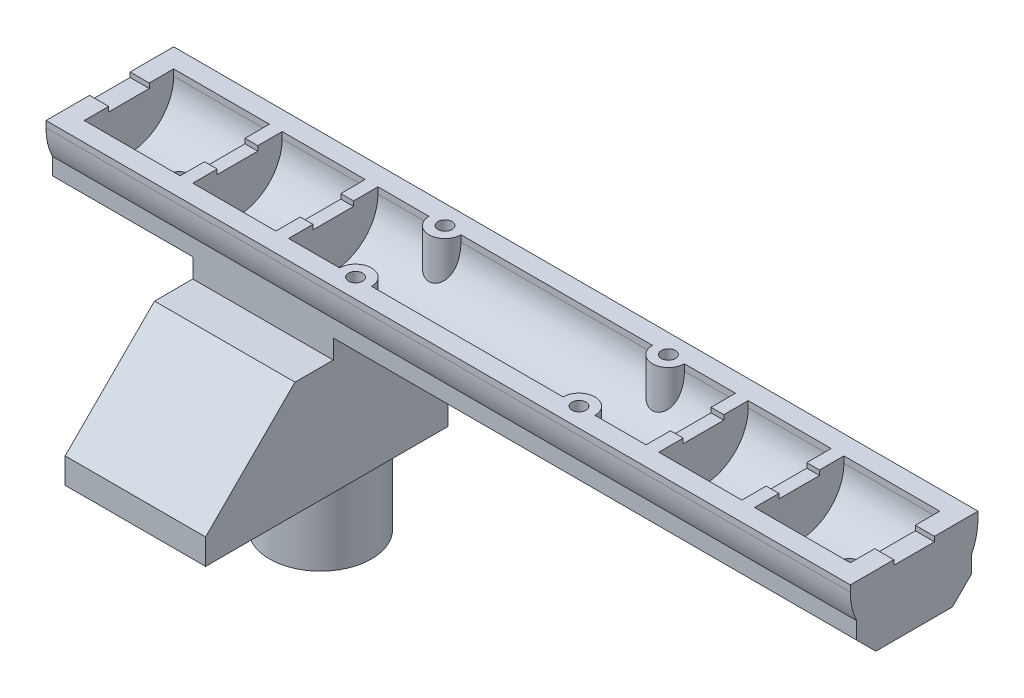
ISO-10303-21;
HEADER;
FILE_DESCRIPTION(('STEP AP214'),'2;1');
FILE_NAME('part.step','',(''),(''),'','','');
FILE_SCHEMA(('AUTOMOTIVE_DESIGN { 1 0 10303 214 1 1 1 1 }'));
ENDSEC;
DATA;
#1=APPLICATION_CONTEXT('core data for automotive mechanical design processes');
#2=APPLICATION_PROTOCOL_DEFINITION('international standard','automotive_design',2000,#1);
#3=PRODUCT_CONTEXT('',#1,'mechanical');
#4=PRODUCT('Part','Part','',(#3));
#5=PRODUCT_RELATED_PRODUCT_CATEGORY('part','',(#4));
#6=PRODUCT_DEFINITION_FORMATION('','',#4);
#7=PRODUCT_DEFINITION_CONTEXT('part definition',#1,'design');
#8=PRODUCT_DEFINITION('design','',#6,#7);
#9=PRODUCT_DEFINITION_SHAPE('','',#8);
#10=(LENGTH_UNIT() NAMED_UNIT(*) SI_UNIT(.MILLI.,.METRE.));
#11=(NAMED_UNIT(*) PLANE_ANGLE_UNIT() SI_UNIT($,.RADIAN.));
#12=(NAMED_UNIT(*) SI_UNIT($,.STERADIAN.) SOLID_ANGLE_UNIT());
#13=UNCERTAINTY_MEASURE_WITH_UNIT(LENGTH_MEASURE(1.E-05),#10,'distance_accuracy_value','');
#14=(GEOMETRIC_REPRESENTATION_CONTEXT(3) GLOBAL_UNCERTAINTY_ASSIGNED_CONTEXT((#13)) GLOBAL_UNIT_ASSIGNED_CONTEXT((#10,
#11,#12)) REPRESENTATION_CONTEXT('',''));
#15=CARTESIAN_POINT('',(0.,0.,0.));
#16=DIRECTION('',(0.,0.,1.));
#17=DIRECTION('',(1.,0.,0.));
#18=AXIS2_PLACEMENT_3D('',#15,#16,#17);
#19=CARTESIAN_POINT('',(120.,0.,9.));
#20=DIRECTION('',(0.,0.,1.));
#21=DIRECTION('',(1.,0.,0.));
#22=AXIS2_PLACEMENT_3D('',#19,#20,#21);
#23=PLANE('',#22);
#24=DIRECTION('',(0.,1.,0.));
#25=VECTOR('',#24,1.);
#26=CARTESIAN_POINT('',(19.,-10.,9.));
#27=LINE('',#26,#25);
#28=CARTESIAN_POINT('',(19.,-10.,9.));
#29=VERTEX_POINT('',#28);
#30=CARTESIAN_POINT('',(19.,-7.00000000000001,9.));
#31=VERTEX_POINT('',#30);
#32=EDGE_CURVE('E495',#29,#31,#27,.T.);
#33=ORIENTED_EDGE('',*,*,#32,.F.);
#34=DIRECTION('',(-1.,0.,0.));
#35=VECTOR('',#34,1.);
#36=CARTESIAN_POINT('',(19.,-10.,9.));
#37=LINE('',#36,#35);
#38=CARTESIAN_POINT('',(41.,-10.,9.));
#39=VERTEX_POINT('',#38);
#40=EDGE_CURVE('E484',#39,#29,#37,.T.);
#41=ORIENTED_EDGE('',*,*,#40,.F.);
#42=DIRECTION('',(0.,-1.,0.));
#43=VECTOR('',#42,1.);
#44=CARTESIAN_POINT('',(41.,-28.,9.));
#45=LINE('',#44,#43);
#46=CARTESIAN_POINT('',(41.,-7.00000000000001,9.));
#47=VERTEX_POINT('',#46);
#48=EDGE_CURVE('E631',#47,#39,#45,.T.);
#49=ORIENTED_EDGE('',*,*,#48,.F.);
#50=DIRECTION('',(1.,0.,0.));
#51=VECTOR('',#50,1.);
#52=CARTESIAN_POINT('',(123.,-7.00000000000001,9.));
#53=LINE('',#52,#51);
#54=CARTESIAN_POINT('',(123.,-7.00000000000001,9.));
#55=VERTEX_POINT('',#54);
#56=EDGE_CURVE('E1046',#47,#55,#53,.T.);
#57=ORIENTED_EDGE('',*,*,#56,.T.);
#58=DIRECTION('',(0.,-1.,0.));
#59=VECTOR('',#58,1.);
#60=CARTESIAN_POINT('',(123.,0.,9.));
#61=LINE('',#60,#59);
#62=CARTESIAN_POINT('',(123.,-4.35889894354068,9.));
#63=VERTEX_POINT('',#62);
#64=EDGE_CURVE('E957',#63,#55,#61,.T.);
#65=ORIENTED_EDGE('',*,*,#64,.F.);
#66=DIRECTION('',(-1.,0.,0.));
#67=VECTOR('',#66,1.);
#68=CARTESIAN_POINT('',(120.,-4.35889894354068,9.));
#69=LINE('',#68,#67);
#70=CARTESIAN_POINT('',(-3.,-4.35889894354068,9.));
#71=VERTEX_POINT('',#70);
#72=EDGE_CURVE('E1076',#63,#71,#69,.T.);
#73=ORIENTED_EDGE('',*,*,#72,.T.);
#74=DIRECTION('',(0.,-1.,0.));
#75=VECTOR('',#74,1.);
#76=CARTESIAN_POINT('',(-3.,0.,9.));
#77=LINE('',#76,#75);
#78=CARTESIAN_POINT('',(-3.,-7.00000000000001,9.));
#79=VERTEX_POINT('',#78);
#80=EDGE_CURVE('E944',#71,#79,#77,.T.);
#81=ORIENTED_EDGE('',*,*,#80,.T.);
#82=DIRECTION('',(1.,0.,0.));
#83=VECTOR('',#82,1.);
#84=CARTESIAN_POINT('',(19.,-7.00000000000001,9.));
#85=LINE('',#84,#83);
#86=EDGE_CURVE('E1043',#79,#31,#85,.T.);
#87=ORIENTED_EDGE('',*,*,#86,.T.);
#88=EDGE_LOOP('',(#33,#41,#49,#57,#65,#73,#81,#87));
#89=FACE_BOUND('',#88,.T.);
#90=ADVANCED_FACE('F34',(#89),#23,.T.);
#91=CARTESIAN_POINT('',(0.,1.,0.));
#92=DIRECTION('',(0.,1.,0.));
#93=DIRECTION('',(0.,0.,1.));
#94=AXIS2_PLACEMENT_3D('',#91,#92,#93);
#95=PLANE('',#94);
#96=CARTESIAN_POINT('',(42.5,0.999999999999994,-7.));
#97=DIRECTION('',(0.,-1.,0.));
#98=DIRECTION('',(0.,0.,-1.));
#99=AXIS2_PLACEMENT_3D('',#96,#97,#98);
#100=CIRCLE('',#99,1.1);
#101=CARTESIAN_POINT('',(42.5,0.999999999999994,-8.1));
#102=VERTEX_POINT('',#101);
#103=EDGE_CURVE('E558',#102,#102,#100,.T.);
#104=ORIENTED_EDGE('',*,*,#103,.T.);
#105=EDGE_LOOP('',(#104));
#106=FACE_BOUND('',#105,.T.);
#107=DIRECTION('',(0.,0.,1.));
#108=VECTOR('',#107,1.);
#109=CARTESIAN_POINT('',(-3.,1.00000000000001,-10.));
#110=LINE('',#109,#108);
#111=CARTESIAN_POINT('',(-3.,1.00000000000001,-10.));
#112=VERTEX_POINT('',#111);
#113=CARTESIAN_POINT('',(-3.,0.999999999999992,-3.175));
#114=VERTEX_POINT('',#113);
#115=EDGE_CURVE('E921',#112,#114,#110,.T.);
#116=ORIENTED_EDGE('',*,*,#115,.T.);
#117=DIRECTION('',(-1.,0.,0.));
#118=VECTOR('',#117,1.);
#119=CARTESIAN_POINT('',(123.001,0.999999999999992,-3.175));
#120=LINE('',#119,#118);
#121=CARTESIAN_POINT('',(0.,1.,-3.175));
#122=VERTEX_POINT('',#121);
#123=EDGE_CURVE('E660',#122,#114,#120,.T.);
#124=ORIENTED_EDGE('',*,*,#123,.F.);
#125=DIRECTION('',(0.,0.,1.));
#126=VECTOR('',#125,1.);
#127=CARTESIAN_POINT('',(0.,1.00000000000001,-7.));
#128=LINE('',#127,#126);
#129=CARTESIAN_POINT('',(0.,1.00000000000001,-7.));
#130=VERTEX_POINT('',#129);
#131=EDGE_CURVE('E903',#130,#122,#128,.T.);
#132=ORIENTED_EDGE('',*,*,#131,.F.);
#133=DIRECTION('',(-1.,0.,0.));
#134=VECTOR('',#133,1.);
#135=CARTESIAN_POINT('',(120.,1.00000000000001,-7.));
#136=LINE('',#135,#134);
#137=CARTESIAN_POINT('',(15.,1.00000000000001,-7.));
#138=VERTEX_POINT('',#137);
#139=EDGE_CURVE('E902',#138,#130,#136,.T.);
#140=ORIENTED_EDGE('',*,*,#139,.F.);
#141=DIRECTION('',(0.,0.,1.));
#142=VECTOR('',#141,1.);
#143=CARTESIAN_POINT('',(15.,1.00000000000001,-9.));
#144=LINE('',#143,#142);
#145=CARTESIAN_POINT('',(15.,1.00000000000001,-3.175));
#146=VERTEX_POINT('',#145);
#147=EDGE_CURVE('E851',#138,#146,#144,.T.);
#148=ORIENTED_EDGE('',*,*,#147,.T.);
#149=DIRECTION('',(-1.,0.,0.));
#150=VECTOR('',#149,1.);
#151=CARTESIAN_POINT('',(17.,1.00000000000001,-3.175));
#152=LINE('',#151,#150);
#153=CARTESIAN_POINT('',(17.,1.00000000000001,-3.175));
#154=VERTEX_POINT('',#153);
#155=EDGE_CURVE('E882',#154,#146,#152,.T.);
#156=ORIENTED_EDGE('',*,*,#155,.F.);
#157=DIRECTION('',(0.,0.,1.));
#158=VECTOR('',#157,1.);
#159=CARTESIAN_POINT('',(17.,1.00000000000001,-9.));
#160=LINE('',#159,#158);
#161=CARTESIAN_POINT('',(17.,1.00000000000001,-7.));
#162=VERTEX_POINT('',#161);
#163=EDGE_CURVE('E852',#162,#154,#160,.T.);
#164=ORIENTED_EDGE('',*,*,#163,.F.);
#165=CARTESIAN_POINT('',(30.,1.00000000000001,-7.));
#166=VERTEX_POINT('',#165);
#167=EDGE_CURVE('E1367',#166,#162,#136,.T.);
#168=ORIENTED_EDGE('',*,*,#167,.F.);
#169=DIRECTION('',(0.,0.,1.));
#170=VECTOR('',#169,1.);
#171=CARTESIAN_POINT('',(30.,1.00000000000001,-9.));
#172=LINE('',#171,#170);
#173=CARTESIAN_POINT('',(30.,1.00000000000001,-3.175));
#174=VERTEX_POINT('',#173);
#175=EDGE_CURVE('E800',#166,#174,#172,.T.);
#176=ORIENTED_EDGE('',*,*,#175,.T.);
#177=DIRECTION('',(-1.,0.,0.));
#178=VECTOR('',#177,1.);
#179=CARTESIAN_POINT('',(32.,1.00000000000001,-3.175));
#180=LINE('',#179,#178);
#181=CARTESIAN_POINT('',(32.,1.00000000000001,-3.175));
#182=VERTEX_POINT('',#181);
#183=EDGE_CURVE('E831',#182,#174,#180,.T.);
#184=ORIENTED_EDGE('',*,*,#183,.F.);
#185=DIRECTION('',(0.,0.,1.));
#186=VECTOR('',#185,1.);
#187=CARTESIAN_POINT('',(32.,1.00000000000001,-9.));
#188=LINE('',#187,#186);
#189=CARTESIAN_POINT('',(32.,1.00000000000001,-7.));
#190=VERTEX_POINT('',#189);
#191=EDGE_CURVE('E801',#190,#182,#188,.T.);
#192=ORIENTED_EDGE('',*,*,#191,.F.);
#193=CARTESIAN_POINT('',(40.,0.999999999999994,-7.));
#194=VERTEX_POINT('',#193);
#195=EDGE_CURVE('E1366',#194,#190,#136,.T.);
#196=ORIENTED_EDGE('',*,*,#195,.F.);
#197=CARTESIAN_POINT('',(42.5,0.999999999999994,-7.));
#198=DIRECTION('',(0.,-1.,0.));
#199=DIRECTION('',(0.,0.,1.));
#200=AXIS2_PLACEMENT_3D('',#197,#198,#199);
#201=CIRCLE('',#200,2.5);
#202=CARTESIAN_POINT('',(45.,0.999999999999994,-7.));
#203=VERTEX_POINT('',#202);
#204=EDGE_CURVE('E573',#203,#194,#201,.T.);
#205=ORIENTED_EDGE('',*,*,#204,.F.);
#206=CARTESIAN_POINT('',(75.,0.999999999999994,-7.));
#207=VERTEX_POINT('',#206);
#208=EDGE_CURVE('E901',#207,#203,#136,.T.);
#209=ORIENTED_EDGE('',*,*,#208,.F.);
#210=CARTESIAN_POINT('',(77.5,0.999999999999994,-7.));
#211=DIRECTION('',(0.,-1.,0.));
#212=DIRECTION('',(0.,0.,1.));
#213=AXIS2_PLACEMENT_3D('',#210,#211,#212);
#214=CIRCLE('',#213,2.5);
#215=CARTESIAN_POINT('',(80.,0.999999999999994,-7.));
#216=VERTEX_POINT('',#215);
#217=EDGE_CURVE('E517',#216,#207,#214,.T.);
#218=ORIENTED_EDGE('',*,*,#217,.F.);
#219=CARTESIAN_POINT('',(88.,1.00000000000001,-7.));
#220=VERTEX_POINT('',#219);
#221=EDGE_CURVE('E1362',#220,#216,#136,.T.);
#222=ORIENTED_EDGE('',*,*,#221,.F.);
#223=DIRECTION('',(0.,0.,1.));
#224=VECTOR('',#223,1.);
#225=CARTESIAN_POINT('',(88.,1.00000000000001,-9.));
#226=LINE('',#225,#224);
#227=CARTESIAN_POINT('',(88.,1.00000000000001,-3.175));
#228=VERTEX_POINT('',#227);
#229=EDGE_CURVE('E697',#220,#228,#226,.T.);
#230=ORIENTED_EDGE('',*,*,#229,.T.);
#231=DIRECTION('',(1.,0.,0.));
#232=VECTOR('',#231,1.);
#233=CARTESIAN_POINT('',(88.,1.00000000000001,-3.175));
#234=LINE('',#233,#232);
#235=CARTESIAN_POINT('',(90.,1.00000000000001,-3.175));
#236=VERTEX_POINT('',#235);
#237=EDGE_CURVE('E712',#228,#236,#234,.T.);
#238=ORIENTED_EDGE('',*,*,#237,.T.);
#239=DIRECTION('',(0.,0.,1.));
#240=VECTOR('',#239,1.);
#241=CARTESIAN_POINT('',(90.,1.00000000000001,-9.));
#242=LINE('',#241,#240);
#243=CARTESIAN_POINT('',(90.,1.00000000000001,-7.));
#244=VERTEX_POINT('',#243);
#245=EDGE_CURVE('E696',#244,#236,#242,.T.);
#246=ORIENTED_EDGE('',*,*,#245,.F.);
#247=CARTESIAN_POINT('',(103.,1.00000000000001,-7.));
#248=VERTEX_POINT('',#247);
#249=EDGE_CURVE('E900',#248,#244,#136,.T.);
#250=ORIENTED_EDGE('',*,*,#249,.F.);
#251=DIRECTION('',(0.,0.,1.));
#252=VECTOR('',#251,1.);
#253=CARTESIAN_POINT('',(103.,1.00000000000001,-9.));
#254=LINE('',#253,#252);
#255=CARTESIAN_POINT('',(103.,1.00000000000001,-3.175));
#256=VERTEX_POINT('',#255);
#257=EDGE_CURVE('E749',#248,#256,#254,.T.);
#258=ORIENTED_EDGE('',*,*,#257,.T.);
#259=DIRECTION('',(1.,0.,0.));
#260=VECTOR('',#259,1.);
#261=CARTESIAN_POINT('',(103.,1.00000000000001,-3.175));
#262=LINE('',#261,#260);
#263=CARTESIAN_POINT('',(105.,1.00000000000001,-3.175));
#264=VERTEX_POINT('',#263);
#265=EDGE_CURVE('E764',#256,#264,#262,.T.);
#266=ORIENTED_EDGE('',*,*,#265,.T.);
#267=DIRECTION('',(0.,0.,1.));
#268=VECTOR('',#267,1.);
#269=CARTESIAN_POINT('',(105.,1.00000000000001,-9.));
#270=LINE('',#269,#268);
#271=CARTESIAN_POINT('',(105.,1.00000000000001,-7.));
#272=VERTEX_POINT('',#271);
#273=EDGE_CURVE('E748',#272,#264,#270,.T.);
#274=ORIENTED_EDGE('',*,*,#273,.F.);
#275=CARTESIAN_POINT('',(120.,1.00000000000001,-7.));
#276=VERTEX_POINT('',#275);
#277=EDGE_CURVE('E897',#276,#272,#136,.T.);
#278=ORIENTED_EDGE('',*,*,#277,.F.);
#279=DIRECTION('',(0.,0.,-1.));
#280=VECTOR('',#279,1.);
#281=CARTESIAN_POINT('',(120.,0.999999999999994,7.));
#282=LINE('',#281,#280);
#283=CARTESIAN_POINT('',(120.,0.999999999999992,-3.175));
#284=VERTEX_POINT('',#283);
#285=EDGE_CURVE('E909',#284,#276,#282,.T.);
#286=ORIENTED_EDGE('',*,*,#285,.F.);
#287=DIRECTION('',(1.,0.,0.));
#288=VECTOR('',#287,1.);
#289=CARTESIAN_POINT('',(-3.001,0.999999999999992,-3.175));
#290=LINE('',#289,#288);
#291=CARTESIAN_POINT('',(123.,0.999999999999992,-3.175));
#292=VERTEX_POINT('',#291);
#293=EDGE_CURVE('E686',#284,#292,#290,.T.);
#294=ORIENTED_EDGE('',*,*,#293,.T.);
#295=DIRECTION('',(0.,0.,-1.));
#296=VECTOR('',#295,1.);
#297=CARTESIAN_POINT('',(123.,0.999999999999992,10.));
#298=LINE('',#297,#296);
#299=CARTESIAN_POINT('',(123.,1.00000000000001,-10.));
#300=VERTEX_POINT('',#299);
#301=EDGE_CURVE('E926',#292,#300,#298,.T.);
#302=ORIENTED_EDGE('',*,*,#301,.T.);
#303=DIRECTION('',(-1.,0.,0.));
#304=VECTOR('',#303,1.);
#305=CARTESIAN_POINT('',(123.,1.00000000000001,-10.));
#306=LINE('',#305,#304);
#307=EDGE_CURVE('E916',#300,#112,#306,.T.);
#308=ORIENTED_EDGE('',*,*,#307,.T.);
#309=EDGE_LOOP('',(#116,#124,#132,#140,#148,#156,#164,#168,#176,#184,#192,#196,#205,#209,#218,
#222,#230,#238,#246,#250,#258,#266,#274,#278,#286,#294,#302,#308));
#310=FACE_BOUND('',#309,.T.);
#311=CARTESIAN_POINT('',(77.5,0.999999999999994,-7.));
#312=DIRECTION('',(0.,-1.,0.));
#313=DIRECTION('',(0.,0.,-1.));
#314=AXIS2_PLACEMENT_3D('',#311,#312,#313);
#315=CIRCLE('',#314,1.1);
#316=CARTESIAN_POINT('',(77.5,0.999999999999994,-8.1));
#317=VERTEX_POINT('',#316);
#318=EDGE_CURVE('E510',#317,#317,#315,.T.);
#319=ORIENTED_EDGE('',*,*,#318,.T.);
#320=EDGE_LOOP('',(#319));
#321=FACE_BOUND('',#320,.T.);
#322=ADVANCED_FACE('F1121',(#106,#310,#321),#95,.T.);
#323=CARTESIAN_POINT('',(120.,1.00000000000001,-7.));
#324=DIRECTION('',(0.,0.,1.));
#325=DIRECTION('',(0.,-1.,0.));
#326=AXIS2_PLACEMENT_3D('',#323,#324,#325);
#327=PLANE('',#326);
#328=ORIENTED_EDGE('',*,*,#221,.T.);
#329=DIRECTION('',(0.,1.,0.));
#330=VECTOR('',#329,1.);
#331=CARTESIAN_POINT('',(80.,-43.001,-6.99999999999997));
#332=LINE('',#331,#330);
#333=CARTESIAN_POINT('',(80.,0.,-7.));
#334=VERTEX_POINT('',#333);
#335=EDGE_CURVE('E520',#334,#216,#332,.T.);
#336=ORIENTED_EDGE('',*,*,#335,.F.);
#337=DIRECTION('',(-1.,0.,0.));
#338=VECTOR('',#337,1.);
#339=CARTESIAN_POINT('',(120.,0.,-7.));
#340=LINE('',#339,#338);
#341=CARTESIAN_POINT('',(88.,0.,-7.));
#342=VERTEX_POINT('',#341);
#343=EDGE_CURVE('E1017',#342,#334,#340,.T.);
#344=ORIENTED_EDGE('',*,*,#343,.F.);
#345=DIRECTION('',(0.,1.,0.));
#346=VECTOR('',#345,1.);
#347=CARTESIAN_POINT('',(88.,1.00000000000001,-7.));
#348=LINE('',#347,#346);
#349=EDGE_CURVE('E746',#342,#220,#348,.T.);
#350=ORIENTED_EDGE('',*,*,#349,.T.);
#351=EDGE_LOOP('',(#328,#336,#344,#350));
#352=FACE_BOUND('',#351,.T.);
#353=ADVANCED_FACE('F1126',(#352),#327,.T.);
#354=CARTESIAN_POINT('',(75.,0.,-7.));
#355=VERTEX_POINT('',#354);
#356=CARTESIAN_POINT('',(45.,0.,-7.));
#357=VERTEX_POINT('',#356);
#358=EDGE_CURVE('E1013',#355,#357,#340,.T.);
#359=ORIENTED_EDGE('',*,*,#358,.F.);
#360=DIRECTION('',(0.,1.,0.));
#361=VECTOR('',#360,1.);
#362=CARTESIAN_POINT('',(75.,-43.001,-6.99999999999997));
#363=LINE('',#362,#361);
#364=EDGE_CURVE('E514',#355,#207,#363,.T.);
#365=ORIENTED_EDGE('',*,*,#364,.T.);
#366=ORIENTED_EDGE('',*,*,#208,.T.);
#367=DIRECTION('',(0.,1.,0.));
#368=VECTOR('',#367,1.);
#369=CARTESIAN_POINT('',(45.,-43.001,-6.99999999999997));
#370=LINE('',#369,#368);
#371=EDGE_CURVE('E576',#357,#203,#370,.T.);
#372=ORIENTED_EDGE('',*,*,#371,.F.);
#373=EDGE_LOOP('',(#359,#365,#366,#372));
#374=FACE_BOUND('',#373,.T.);
#375=ADVANCED_FACE('F1397',(#374),#327,.T.);
#376=CARTESIAN_POINT('',(120.,0.,0.));
#377=DIRECTION('',(-1.,0.,0.));
#378=DIRECTION('',(0.,0.,1.));
#379=AXIS2_PLACEMENT_3D('',#376,#377,#378);
#380=CYLINDRICAL_SURFACE('',#379,7.);
#381=CARTESIAN_POINT('',(82.5,-6.79043444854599,-1.7));
#382=CARTESIAN_POINT('',(82.4060336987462,-6.79043628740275,-1.69999718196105));
#383=CARTESIAN_POINT('',(82.3120356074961,-6.79240620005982,-1.6921825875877));
#384=CARTESIAN_POINT('',(82.1267324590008,-6.80005425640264,-1.6611767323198));
#385=CARTESIAN_POINT('',(82.0354290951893,-6.80573468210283,-1.6379760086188));
#386=CARTESIAN_POINT('',(81.8582224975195,-6.82012333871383,-1.5769879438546));
#387=CARTESIAN_POINT('',(81.7723126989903,-6.82882780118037,-1.539218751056));
#388=CARTESIAN_POINT('',(81.6080412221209,-6.84827910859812,-1.45022042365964));
#389=CARTESIAN_POINT('',(81.5296797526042,-6.8590260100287,-1.39899091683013));
#390=CARTESIAN_POINT('',(81.3811010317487,-6.88160115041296,-1.28338975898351));
#391=CARTESIAN_POINT('',(81.3110636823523,-6.89344586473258,-1.21879005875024));
#392=CARTESIAN_POINT('',(81.1827039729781,-6.91673880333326,-1.07877374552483));
#393=CARTESIAN_POINT('',(81.1243826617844,-6.9281869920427,-1.0033561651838));
#394=CARTESIAN_POINT('',(81.0203803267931,-6.94957859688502,-0.842618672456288));
#395=CARTESIAN_POINT('',(80.974875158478,-6.95950030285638,-0.757181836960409));
#396=CARTESIAN_POINT('',(80.8989388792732,-6.976533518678,-0.579590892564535));
#397=CARTESIAN_POINT('',(80.8685056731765,-6.98364541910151,-0.487437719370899));
#398=CARTESIAN_POINT('',(80.8241509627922,-6.99414124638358,-0.30090441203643));
#399=CARTESIAN_POINT('',(80.8099241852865,-6.99759400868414,-0.206600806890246));
#400=CARTESIAN_POINT('',(80.797428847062,-7.000622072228,-0.0168864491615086));
#401=CARTESIAN_POINT('',(80.79915805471,-7.00019791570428,0.0785241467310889));
#402=CARTESIAN_POINT('',(80.8183041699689,-6.9955715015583,0.265629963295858));
#403=CARTESIAN_POINT('',(80.8353916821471,-6.99144857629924,0.357361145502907));
#404=CARTESIAN_POINT('',(80.8842409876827,-6.97997976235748,0.53661322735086));
#405=CARTESIAN_POINT('',(80.9160035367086,-6.97263370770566,0.624133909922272));
#406=CARTESIAN_POINT('',(80.9935736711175,-6.95542118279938,0.793359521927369));
#407=CARTESIAN_POINT('',(81.0395002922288,-6.94553347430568,0.875007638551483));
#408=CARTESIAN_POINT('',(81.1440049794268,-6.92431304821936,1.02955463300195));
#409=CARTESIAN_POINT('',(81.2025851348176,-6.91298009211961,1.10245206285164));
#410=CARTESIAN_POINT('',(81.3325065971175,-6.88976494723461,1.23939183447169));
#411=CARTESIAN_POINT('',(81.4041358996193,-6.8778761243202,1.30316009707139));
#412=CARTESIAN_POINT('',(81.5571960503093,-6.85515585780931,1.41783835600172));
#413=CARTESIAN_POINT('',(81.638627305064,-6.8443244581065,1.46874781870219));
#414=CARTESIAN_POINT('',(81.8094945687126,-6.82492298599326,1.5564256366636));
#415=CARTESIAN_POINT('',(81.8989638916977,-6.81636296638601,1.59313144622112));
#416=CARTESIAN_POINT('',(82.0830606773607,-6.80260446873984,1.65089784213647));
#417=CARTESIAN_POINT('',(82.1776871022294,-6.79740531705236,1.67196156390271));
#418=CARTESIAN_POINT('',(82.3668791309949,-6.79109769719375,1.69739829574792));
#419=CARTESIAN_POINT('',(82.4613872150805,-6.78989029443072,1.70217506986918));
#420=CARTESIAN_POINT('',(82.6498498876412,-6.79143415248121,1.69600478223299));
#421=CARTESIAN_POINT('',(82.7438045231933,-6.79418507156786,1.68505907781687));
#422=CARTESIAN_POINT('',(82.9270166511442,-6.80324113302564,1.6481077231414));
#423=CARTESIAN_POINT('',(83.0163239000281,-6.80949148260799,1.62233407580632));
#424=CARTESIAN_POINT('',(83.1893509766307,-6.82479074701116,1.55671422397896));
#425=CARTESIAN_POINT('',(83.2730701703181,-6.83383997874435,1.51686642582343));
#426=CARTESIAN_POINT('',(83.4342641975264,-6.85392785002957,1.42337375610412));
#427=CARTESIAN_POINT('',(83.5115936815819,-6.86500040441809,1.36948572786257));
#428=CARTESIAN_POINT('',(83.6562606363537,-6.88780266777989,1.2497522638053));
#429=CARTESIAN_POINT('',(83.72359655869,-6.89953247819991,1.18390497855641));
#430=CARTESIAN_POINT('',(83.8479840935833,-6.92266071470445,1.04027525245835));
#431=CARTESIAN_POINT('',(83.9047573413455,-6.93404490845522,0.962249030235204));
#432=CARTESIAN_POINT('',(84.0043937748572,-6.95491330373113,0.797534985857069));
#433=CARTESIAN_POINT('',(84.0472576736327,-6.96439760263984,0.710847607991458));
#434=CARTESIAN_POINT('',(84.1174973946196,-6.98033884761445,0.531861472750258));
#435=CARTESIAN_POINT('',(84.1449821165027,-6.98681702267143,0.439607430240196));
#436=CARTESIAN_POINT('',(84.1840138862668,-6.9961087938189,0.25161295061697));
#437=CARTESIAN_POINT('',(84.1955638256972,-6.99892305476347,0.15587314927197));
#438=CARTESIAN_POINT('',(84.202243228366,-7.00054453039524,-0.0337537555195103));
#439=CARTESIAN_POINT('',(84.1977845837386,-6.99945226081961,-0.127625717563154));
#440=CARTESIAN_POINT('',(84.1735115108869,-6.99360449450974,-0.313240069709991));
#441=CARTESIAN_POINT('',(84.1536974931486,-6.98884909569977,-0.404982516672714));
#442=CARTESIAN_POINT('',(84.0994917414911,-6.97622305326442,-0.583329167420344));
#443=CARTESIAN_POINT('',(84.0651706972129,-6.96836752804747,-0.66995599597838));
#444=CARTESIAN_POINT('',(83.982990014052,-6.95037105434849,-0.836269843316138));
#445=CARTESIAN_POINT('',(83.9351287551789,-6.94022983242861,-0.91595603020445));
#446=CARTESIAN_POINT('',(83.8259492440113,-6.91846962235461,-1.06809355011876));
#447=CARTESIAN_POINT('',(83.7643490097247,-6.90682220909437,-1.14033846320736));
#448=CARTESIAN_POINT('',(83.6299928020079,-6.88349586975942,-1.2736058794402));
#449=CARTESIAN_POINT('',(83.5572340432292,-6.87181693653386,-1.33462557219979));
#450=CARTESIAN_POINT('',(83.4011074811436,-6.84952046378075,-1.44474507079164));
#451=CARTESIAN_POINT('',(83.3175775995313,-6.83892483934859,-1.49361984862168));
#452=CARTESIAN_POINT('',(83.143243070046,-6.82028439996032,-1.5765597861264));
#453=CARTESIAN_POINT('',(83.0524439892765,-6.81223765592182,-1.61063615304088));
#454=CARTESIAN_POINT('',(82.884782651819,-6.80091987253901,-1.65769279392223));
#455=CARTESIAN_POINT('',(82.8087507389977,-6.79701655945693,-1.67352445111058));
#456=CARTESIAN_POINT('',(82.6551530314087,-6.79177318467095,-1.69467882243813));
#457=CARTESIAN_POINT('',(82.5775873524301,-6.79043293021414,-1.70000232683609));
#458=CARTESIAN_POINT('',(82.5,-6.79043444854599,-1.7));
#459=B_SPLINE_CURVE_WITH_KNOTS('',3,(#381,#382,#383,#384,#385,#386,#387,#388,#389,#390,#391,
#392,#393,#394,#395,#396,#397,#398,#399,#400,#401,#402,#403,#404,#405,#406,#407,#408,#409,#410,
#411,#412,#413,#414,#415,#416,#417,#418,#419,#420,#421,#422,#423,#424,#425,#426,#427,#428,#429,
#430,#431,#432,#433,#434,#435,#436,#437,#438,#439,#440,#441,#442,#443,#444,#445,#446,#447,#448,
#449,#450,#451,#452,#453,#454,#455,#456,#457,#458),.UNSPECIFIED.,.T.,.F.,(4,2,2,2,2,2,2,2,2,2,2,
2,2,2,2,2,2,2,2,2,2,2,2,2,2,2,2,2,2,2,2,2,2,2,2,2,2,2,4),(0.,0.281614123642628,
0.563401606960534,0.844839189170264,1.12628455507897,1.41299810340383,1.6997373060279,
1.99023803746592,2.28069837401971,2.56559195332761,2.85044568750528,3.12933211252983,
3.40823289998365,3.6895445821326,3.97090274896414,4.25945507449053,4.54801937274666,
4.83784028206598,5.12760308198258,5.41012809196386,5.69262871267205,5.97082499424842,
6.24905278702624,6.53246277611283,6.81591663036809,7.10602105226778,7.39611060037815,
7.68411915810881,7.9720754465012,8.25267647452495,8.53327000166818,8.81251173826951,
9.09178689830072,9.37743059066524,9.66314570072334,9.95381490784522,10.2442635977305,
10.4768080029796,10.7093349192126),.UNSPECIFIED.);
#460=CARTESIAN_POINT('',(82.5,-6.79043444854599,-1.7));
#461=VERTEX_POINT('',#460);
#462=EDGE_CURVE('E1153',#461,#461,#459,.T.);
#463=ORIENTED_EDGE('',*,*,#462,.F.);
#464=EDGE_LOOP('',(#463));
#465=FACE_BOUND('',#464,.T.);
#466=ORIENTED_EDGE('',*,*,#343,.T.);
#467=CARTESIAN_POINT('',(75.,0.,-7.));
#468=CARTESIAN_POINT('',(75.0000106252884,-0.0978295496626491,-7.00000115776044));
#469=CARTESIAN_POINT('',(75.0000002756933,-0.195658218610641,-6.99794915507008));
#470=CARTESIAN_POINT('',(75.0000148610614,-0.391144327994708,-6.98974768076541));
#471=CARTESIAN_POINT('',(75.000039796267,-0.488801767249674,-6.983598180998));
#472=CARTESIAN_POINT('',(75.00020224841,-0.683847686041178,-6.96720442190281));
#473=CARTESIAN_POINT('',(75.000339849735,-0.781235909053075,-6.95695709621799));
#474=CARTESIAN_POINT('',(75.0008847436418,-0.975489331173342,-6.93238833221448));
#475=CARTESIAN_POINT('',(75.0012920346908,-1.072354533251,-6.91806691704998));
#476=CARTESIAN_POINT('',(75.0032245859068,-1.3635693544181,-6.86874445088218));
#477=CARTESIAN_POINT('',(75.0054654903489,-1.55689932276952,-6.82752254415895));
#478=CARTESIAN_POINT('',(75.014247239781,-1.93920253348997,-6.72892506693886));
#479=CARTESIAN_POINT('',(75.0207857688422,-2.12817806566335,-6.67155820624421));
#480=CARTESIAN_POINT('',(75.0382091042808,-2.44002360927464,-6.56232215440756));
#481=CARTESIAN_POINT('',(75.0470034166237,-2.56450072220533,-6.51467878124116));
#482=CARTESIAN_POINT('',(75.0694402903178,-2.81018402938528,-6.41253142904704));
#483=CARTESIAN_POINT('',(75.0830828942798,-2.93139019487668,-6.35802738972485));
#484=CARTESIAN_POINT('',(75.1166794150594,-3.16938494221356,-6.24278778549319));
#485=CARTESIAN_POINT('',(75.1366100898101,-3.28618804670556,-6.18207571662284));
#486=CARTESIAN_POINT('',(75.1845011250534,-3.51488952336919,-6.05497228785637));
#487=CARTESIAN_POINT('',(75.2124581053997,-3.62678993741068,-5.98858332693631));
#488=CARTESIAN_POINT('',(75.2896812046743,-3.88216889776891,-5.82739769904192));
#489=CARTESIAN_POINT('',(75.3429673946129,-4.02331064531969,-5.73066896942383));
#490=CARTESIAN_POINT('',(75.4399618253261,-4.22425130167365,-5.58235564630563));
#491=CARTESIAN_POINT('',(75.4751323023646,-4.28942909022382,-5.53238729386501));
#492=CARTESIAN_POINT('',(75.5517329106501,-4.41571433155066,-5.43212263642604));
#493=CARTESIAN_POINT('',(75.5931614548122,-4.47682281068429,-5.38182641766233));
#494=CARTESIAN_POINT('',(75.7077096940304,-4.62710612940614,-5.25397522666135));
#495=CARTESIAN_POINT('',(75.78565338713,-4.71302495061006,-5.17679125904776));
#496=CARTESIAN_POINT('',(75.9589239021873,-4.87125945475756,-5.02818264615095));
#497=CARTESIAN_POINT('',(76.0542324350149,-4.94358928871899,-4.95675205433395));
#498=CARTESIAN_POINT('',(76.246151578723,-5.06285295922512,-4.83463656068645));
#499=CARTESIAN_POINT('',(76.3404415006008,-5.11196638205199,-4.78244658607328));
#500=CARTESIAN_POINT('',(76.5396831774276,-5.19765107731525,-4.68918410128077));
#501=CARTESIAN_POINT('',(76.6446321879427,-5.23422556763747,-4.64810873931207));
#502=CARTESIAN_POINT('',(76.8630612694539,-5.29411818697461,-4.57978256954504));
#503=CARTESIAN_POINT('',(76.976574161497,-5.31738204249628,-4.5525884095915));
#504=CARTESIAN_POINT('',(77.2082459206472,-5.34992012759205,-4.51431097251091));
#505=CARTESIAN_POINT('',(77.3264038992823,-5.35919701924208,-4.50322462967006));
#506=CARTESIAN_POINT('',(77.5543404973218,-5.36342102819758,-4.49818994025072));
#507=CARTESIAN_POINT('',(77.6640756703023,-5.35940064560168,-4.5030067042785));
#508=CARTESIAN_POINT('',(77.8808540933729,-5.33933802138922,-4.52677684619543));
#509=CARTESIAN_POINT('',(77.9878979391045,-5.32329846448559,-4.54572706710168));
#510=CARTESIAN_POINT('',(78.1952761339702,-5.27970659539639,-4.59627950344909));
#511=CARTESIAN_POINT('',(78.2956675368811,-5.2522727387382,-4.62775140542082));
#512=CARTESIAN_POINT('',(78.4885590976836,-5.18642221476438,-4.70143118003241));
#513=CARTESIAN_POINT('',(78.5810583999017,-5.14800435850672,-4.74364021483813));
#514=CARTESIAN_POINT('',(78.7618191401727,-5.05829021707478,-4.8392384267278));
#515=CARTESIAN_POINT('',(78.849484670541,-5.00635490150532,-4.89314987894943));
#516=CARTESIAN_POINT('',(79.0130633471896,-4.89212494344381,-5.00736004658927));
#517=CARTESIAN_POINT('',(79.0889702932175,-4.82982487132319,-5.06766210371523));
#518=CARTESIAN_POINT('',(79.2595271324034,-4.6668631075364,-5.21895229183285));
#519=CARTESIAN_POINT('',(79.3478621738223,-4.56133803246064,-5.31182995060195));
#520=CARTESIAN_POINT('',(79.5021082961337,-4.33525770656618,-5.49791493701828));
#521=CARTESIAN_POINT('',(79.5679757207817,-4.21467380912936,-5.59112255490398));
#522=CARTESIAN_POINT('',(79.6655917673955,-3.99600438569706,-5.74847467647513));
#523=CARTESIAN_POINT('',(79.7017522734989,-3.9005872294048,-5.81369511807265));
#524=CARTESIAN_POINT('',(79.7655101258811,-3.70457651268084,-5.94051623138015));
#525=CARTESIAN_POINT('',(79.7931033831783,-3.60398050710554,-6.00211516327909));
#526=CARTESIAN_POINT('',(79.8412190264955,-3.39833328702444,-6.12090432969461));
#527=CARTESIAN_POINT('',(79.8617268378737,-3.29327338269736,-6.17808529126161));
#528=CARTESIAN_POINT('',(79.8969576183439,-3.0795748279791,-6.28733911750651));
#529=CARTESIAN_POINT('',(79.9116787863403,-2.97093507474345,-6.33941038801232));
#530=CARTESIAN_POINT('',(79.9427287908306,-2.69600599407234,-6.46251713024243));
#531=CARTESIAN_POINT('',(79.9562303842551,-2.52786118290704,-6.53014092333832));
#532=CARTESIAN_POINT('',(79.9764683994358,-2.18642975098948,-6.65225115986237));
#533=CARTESIAN_POINT('',(79.9832010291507,-2.0131403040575,-6.70673022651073));
#534=CARTESIAN_POINT('',(79.9926099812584,-1.66287312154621,-6.80204193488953));
#535=CARTESIAN_POINT('',(79.9952888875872,-1.48589780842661,-6.8428832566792));
#536=CARTESIAN_POINT('',(79.9986339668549,-1.12938241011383,-6.91067298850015));
#537=CARTESIAN_POINT('',(79.9993012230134,-0.949843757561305,-6.93762886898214));
#538=CARTESIAN_POINT('',(79.9998801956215,-0.641655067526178,-6.9717171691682));
#539=CARTESIAN_POINT('',(79.9999551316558,-0.513379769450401,-6.98233400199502));
#540=CARTESIAN_POINT('',(79.9999999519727,-0.256739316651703,-6.99646840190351));
#541=CARTESIAN_POINT('',(79.9999700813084,-0.128375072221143,-7.00000249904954));
#542=CARTESIAN_POINT('',(80.,0.,-7.));
#543=B_SPLINE_CURVE_WITH_KNOTS('',3,(#467,#468,#469,#470,#471,#472,#473,#474,#475,#476,#477,
#478,#479,#480,#481,#482,#483,#484,#485,#486,#487,#488,#489,#490,#491,#492,#493,#494,#495,#496,
#497,#498,#499,#500,#501,#502,#503,#504,#505,#506,#507,#508,#509,#510,#511,#512,#513,#514,#515,
#516,#517,#518,#519,#520,#521,#522,#523,#524,#525,#526,#527,#528,#529,#530,#531,#532,#533,#534,
#535,#536,#537,#538,#539,#540,#541,#542),.UNSPECIFIED.,.F.,.F.,(4,2,2,2,2,2,2,2,2,2,2,2,2,2,2,2,
2,2,2,2,2,2,2,2,2,2,2,2,2,2,2,2,2,2,2,2,2,4),(0.,0.293465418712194,0.586932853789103,
0.880620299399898,1.17430607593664,1.76659559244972,2.35856619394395,2.75902039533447,
3.15947811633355,3.55847266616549,3.95729943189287,4.49295136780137,4.76071373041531,
5.02840830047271,5.44474004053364,5.8606357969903,6.21441296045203,6.56809926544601,
6.92321761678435,7.27826837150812,7.60641713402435,7.93449262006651,8.25923956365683,
8.58402167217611,8.92847300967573,9.2731053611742,9.76841186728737,10.2646753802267,
10.6275042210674,10.9905059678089,11.3542500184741,11.7181071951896,12.2625216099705,
12.807240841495,13.3516127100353,13.8956913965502,14.2816483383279,14.6667034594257),.UNSPECIFIED.);
#544=EDGE_CURVE('E523',#355,#334,#543,.T.);
#545=ORIENTED_EDGE('',*,*,#544,.F.);
#546=ORIENTED_EDGE('',*,*,#358,.T.);
#547=CARTESIAN_POINT('',(40.,0.,-7.));
#548=CARTESIAN_POINT('',(40.0000106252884,-0.0978295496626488,-7.00000115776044));
#549=CARTESIAN_POINT('',(40.0000002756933,-0.19565821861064,-6.99794915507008));
#550=CARTESIAN_POINT('',(40.0000148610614,-0.391144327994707,-6.98974768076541));
#551=CARTESIAN_POINT('',(40.000039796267,-0.488801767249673,-6.983598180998));
#552=CARTESIAN_POINT('',(40.00020224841,-0.683847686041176,-6.96720442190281));
#553=CARTESIAN_POINT('',(40.000339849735,-0.781235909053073,-6.95695709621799));
#554=CARTESIAN_POINT('',(40.0008847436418,-0.97548933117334,-6.93238833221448));
#555=CARTESIAN_POINT('',(40.0012920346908,-1.07235453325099,-6.91806691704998));
#556=CARTESIAN_POINT('',(40.0032245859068,-1.36356935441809,-6.86874445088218));
#557=CARTESIAN_POINT('',(40.0054654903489,-1.55689932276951,-6.82752254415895));
#558=CARTESIAN_POINT('',(40.014247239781,-1.93920253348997,-6.72892506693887));
#559=CARTESIAN_POINT('',(40.0207857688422,-2.12817806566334,-6.67155820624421));
#560=CARTESIAN_POINT('',(40.0382091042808,-2.44002360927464,-6.56232215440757));
#561=CARTESIAN_POINT('',(40.0470034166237,-2.56450072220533,-6.51467878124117));
#562=CARTESIAN_POINT('',(40.0694402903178,-2.81018402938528,-6.41253142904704));
#563=CARTESIAN_POINT('',(40.0830828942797,-2.93139019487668,-6.35802738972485));
#564=CARTESIAN_POINT('',(40.1166794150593,-3.16938494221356,-6.24278778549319));
#565=CARTESIAN_POINT('',(40.1366100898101,-3.28618804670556,-6.18207571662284));
#566=CARTESIAN_POINT('',(40.1845011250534,-3.51488952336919,-6.05497228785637));
#567=CARTESIAN_POINT('',(40.2124581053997,-3.62678993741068,-5.98858332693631));
#568=CARTESIAN_POINT('',(40.2896812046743,-3.8821688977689,-5.82739769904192));
#569=CARTESIAN_POINT('',(40.3429673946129,-4.02331064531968,-5.73066896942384));
#570=CARTESIAN_POINT('',(40.4399618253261,-4.22425130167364,-5.58235564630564));
#571=CARTESIAN_POINT('',(40.4751323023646,-4.28942909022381,-5.53238729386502));
#572=CARTESIAN_POINT('',(40.5517329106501,-4.41571433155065,-5.43212263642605));
#573=CARTESIAN_POINT('',(40.5931614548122,-4.47682281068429,-5.38182641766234));
#574=CARTESIAN_POINT('',(40.7077096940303,-4.62710612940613,-5.25397522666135));
#575=CARTESIAN_POINT('',(40.78565338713,-4.71302495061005,-5.17679125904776));
#576=CARTESIAN_POINT('',(40.9589239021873,-4.87125945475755,-5.02818264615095));
#577=CARTESIAN_POINT('',(41.0542324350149,-4.94358928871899,-4.95675205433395));
#578=CARTESIAN_POINT('',(41.246151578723,-5.06285295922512,-4.83463656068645));
#579=CARTESIAN_POINT('',(41.3404415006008,-5.11196638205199,-4.78244658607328));
#580=CARTESIAN_POINT('',(41.5396831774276,-5.19765107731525,-4.68918410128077));
#581=CARTESIAN_POINT('',(41.6446321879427,-5.23422556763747,-4.64810873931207));
#582=CARTESIAN_POINT('',(41.8630612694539,-5.2941181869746,-4.57978256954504));
#583=CARTESIAN_POINT('',(41.9765741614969,-5.31738204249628,-4.5525884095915));
#584=CARTESIAN_POINT('',(42.2082459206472,-5.34992012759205,-4.51431097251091));
#585=CARTESIAN_POINT('',(42.3264038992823,-5.35919701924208,-4.50322462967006));
#586=CARTESIAN_POINT('',(42.5543404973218,-5.36342102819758,-4.49818994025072));
#587=CARTESIAN_POINT('',(42.6640756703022,-5.35940064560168,-4.50300670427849));
#588=CARTESIAN_POINT('',(42.8808540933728,-5.33933802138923,-4.52677684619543));
#589=CARTESIAN_POINT('',(42.9878979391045,-5.32329846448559,-4.54572706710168));
#590=CARTESIAN_POINT('',(43.1952761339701,-5.27970659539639,-4.59627950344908));
#591=CARTESIAN_POINT('',(43.2956675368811,-5.2522727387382,-4.62775140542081));
#592=CARTESIAN_POINT('',(43.4885590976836,-5.18642221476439,-4.70143118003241));
#593=CARTESIAN_POINT('',(43.5810583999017,-5.14800435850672,-4.74364021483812));
#594=CARTESIAN_POINT('',(43.7618191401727,-5.05829021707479,-4.83923842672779));
#595=CARTESIAN_POINT('',(43.8494846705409,-5.00635490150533,-4.89314987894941));
#596=CARTESIAN_POINT('',(44.0130633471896,-4.89212494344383,-5.00736004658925));
#597=CARTESIAN_POINT('',(44.0889702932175,-4.8298248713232,-5.06766210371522));
#598=CARTESIAN_POINT('',(44.2595271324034,-4.66686310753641,-5.21895229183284));
#599=CARTESIAN_POINT('',(44.3478621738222,-4.56133803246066,-5.31182995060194));
#600=CARTESIAN_POINT('',(44.5021082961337,-4.3352577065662,-5.49791493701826));
#601=CARTESIAN_POINT('',(44.5679757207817,-4.21467380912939,-5.59112255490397));
#602=CARTESIAN_POINT('',(44.6655917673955,-3.99600438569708,-5.74847467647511));
#603=CARTESIAN_POINT('',(44.7017522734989,-3.90058722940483,-5.81369511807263));
#604=CARTESIAN_POINT('',(44.765510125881,-3.70457651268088,-5.94051623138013));
#605=CARTESIAN_POINT('',(44.7931033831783,-3.60398050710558,-6.00211516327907));
#606=CARTESIAN_POINT('',(44.8412190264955,-3.39833328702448,-6.12090432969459));
#607=CARTESIAN_POINT('',(44.8617268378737,-3.2932733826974,-6.17808529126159));
#608=CARTESIAN_POINT('',(44.8969576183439,-3.07957482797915,-6.28733911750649));
#609=CARTESIAN_POINT('',(44.9116787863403,-2.9709350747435,-6.3394103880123));
#610=CARTESIAN_POINT('',(44.9427287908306,-2.6960059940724,-6.46251713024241));
#611=CARTESIAN_POINT('',(44.9562303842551,-2.52786118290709,-6.5301409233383));
#612=CARTESIAN_POINT('',(44.9764683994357,-2.18642975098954,-6.65225115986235));
#613=CARTESIAN_POINT('',(44.9832010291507,-2.01314030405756,-6.70673022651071));
#614=CARTESIAN_POINT('',(44.9926099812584,-1.66287312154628,-6.80204193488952));
#615=CARTESIAN_POINT('',(44.9952888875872,-1.48589780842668,-6.84288325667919));
#616=CARTESIAN_POINT('',(44.9986339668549,-1.1293824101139,-6.91067298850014));
#617=CARTESIAN_POINT('',(44.9993012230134,-0.949843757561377,-6.93762886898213));
#618=CARTESIAN_POINT('',(44.9998801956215,-0.64165506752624,-6.9717171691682));
#619=CARTESIAN_POINT('',(44.9999551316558,-0.513379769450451,-6.98233400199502));
#620=CARTESIAN_POINT('',(44.9999999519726,-0.256739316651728,-6.99646840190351));
#621=CARTESIAN_POINT('',(44.9999700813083,-0.128375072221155,-7.00000249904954));
#622=CARTESIAN_POINT('',(45.,0.,-7.));
#623=B_SPLINE_CURVE_WITH_KNOTS('',3,(#547,#548,#549,#550,#551,#552,#553,#554,#555,#556,#557,
#558,#559,#560,#561,#562,#563,#564,#565,#566,#567,#568,#569,#570,#571,#572,#573,#574,#575,#576,
#577,#578,#579,#580,#581,#582,#583,#584,#585,#586,#587,#588,#589,#590,#591,#592,#593,#594,#595,
#596,#597,#598,#599,#600,#601,#602,#603,#604,#605,#606,#607,#608,#609,#610,#611,#612,#613,#614,
#615,#616,#617,#618,#619,#620,#621,#622),.UNSPECIFIED.,.F.,.F.,(4,2,2,2,2,2,2,2,2,2,2,2,2,2,2,2,
2,2,2,2,2,2,2,2,2,2,2,2,2,2,2,2,2,2,2,2,2,4),(0.,0.293465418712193,0.586932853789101,
0.880620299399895,1.17430607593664,1.76659559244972,2.35856619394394,2.75902039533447,
3.15947811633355,3.55847266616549,3.95729943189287,4.49295136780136,4.7607137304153,
5.0284083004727,5.44474004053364,5.86063579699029,6.21441296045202,6.568099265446,
6.92321761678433,7.2782683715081,7.60641713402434,7.93449262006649,8.25923956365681,
8.58402167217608,8.92847300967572,9.27310536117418,9.76841186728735,10.2646753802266,
10.6275042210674,10.9905059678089,11.354250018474,11.7181071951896,12.2625216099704,
12.8072408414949,13.3516127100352,13.8956913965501,14.2816483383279,14.6667034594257),.UNSPECIFIED.);
#624=CARTESIAN_POINT('',(40.,0.,-7.));
#625=VERTEX_POINT('',#624);
#626=EDGE_CURVE('E579',#625,#357,#623,.T.);
#627=ORIENTED_EDGE('',*,*,#626,.F.);
#628=CARTESIAN_POINT('',(32.,0.,-7.));
#629=VERTEX_POINT('',#628);
#630=EDGE_CURVE('E1012',#625,#629,#340,.T.);
#631=ORIENTED_EDGE('',*,*,#630,.T.);
#632=CARTESIAN_POINT('',(32.,0.,0.));
#633=DIRECTION('',(-1.,0.,0.));
#634=DIRECTION('',(0.,0.,1.));
#635=AXIS2_PLACEMENT_3D('',#632,#633,#634);
#636=CIRCLE('',#635,7.);
#637=CARTESIAN_POINT('',(32.,0.,7.));
#638=VERTEX_POINT('',#637);
#639=EDGE_CURVE('E843',#629,#638,#636,.T.);
#640=ORIENTED_EDGE('',*,*,#639,.T.);
#641=DIRECTION('',(-1.,0.,0.));
#642=VECTOR('',#641,1.);
#643=CARTESIAN_POINT('',(120.,0.,7.));
#644=LINE('',#643,#642);
#645=CARTESIAN_POINT('',(40.,0.,7.));
#646=VERTEX_POINT('',#645);
#647=EDGE_CURVE('E1007',#646,#638,#644,.T.);
#648=ORIENTED_EDGE('',*,*,#647,.F.);
#649=CARTESIAN_POINT('',(40.,0.,7.));
#650=CARTESIAN_POINT('',(40.0000106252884,-0.0978295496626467,7.00000115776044));
#651=CARTESIAN_POINT('',(40.0000002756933,-0.195658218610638,6.99794915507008));
#652=CARTESIAN_POINT('',(40.0000148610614,-0.391144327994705,6.98974768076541));
#653=CARTESIAN_POINT('',(40.000039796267,-0.488801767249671,6.983598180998));
#654=CARTESIAN_POINT('',(40.00020224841,-0.683847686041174,6.96720442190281));
#655=CARTESIAN_POINT('',(40.000339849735,-0.781235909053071,6.95695709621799));
#656=CARTESIAN_POINT('',(40.0008847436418,-0.975489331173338,6.93238833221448));
#657=CARTESIAN_POINT('',(40.0012920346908,-1.07235453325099,6.91806691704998));
#658=CARTESIAN_POINT('',(40.0032245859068,-1.36356935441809,6.86874445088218));
#659=CARTESIAN_POINT('',(40.0054654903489,-1.55689932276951,6.82752254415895));
#660=CARTESIAN_POINT('',(40.014247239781,-1.93920253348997,6.72892506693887));
#661=CARTESIAN_POINT('',(40.0207857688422,-2.12817806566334,6.67155820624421));
#662=CARTESIAN_POINT('',(40.0382091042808,-2.44002360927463,6.56232215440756));
#663=CARTESIAN_POINT('',(40.0470034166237,-2.56450072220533,6.51467878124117));
#664=CARTESIAN_POINT('',(40.0694402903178,-2.81018402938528,6.41253142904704));
#665=CARTESIAN_POINT('',(40.0830828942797,-2.93139019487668,6.35802738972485));
#666=CARTESIAN_POINT('',(40.1166794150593,-3.16938494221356,6.24278778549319));
#667=CARTESIAN_POINT('',(40.1366100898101,-3.28618804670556,6.18207571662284));
#668=CARTESIAN_POINT('',(40.1845011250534,-3.51488952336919,6.05497228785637));
#669=CARTESIAN_POINT('',(40.2124581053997,-3.62678993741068,5.98858332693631));
#670=CARTESIAN_POINT('',(40.2896812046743,-3.8821688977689,5.82739769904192));
#671=CARTESIAN_POINT('',(40.3429673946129,-4.02331064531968,5.73066896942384));
#672=CARTESIAN_POINT('',(40.4399618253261,-4.22425130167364,5.58235564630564));
#673=CARTESIAN_POINT('',(40.4751323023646,-4.28942909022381,5.53238729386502));
#674=CARTESIAN_POINT('',(40.5517329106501,-4.41571433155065,5.43212263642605));
#675=CARTESIAN_POINT('',(40.5931614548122,-4.47682281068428,5.38182641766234));
#676=CARTESIAN_POINT('',(40.7077096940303,-4.62710612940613,5.25397522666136));
#677=CARTESIAN_POINT('',(40.78565338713,-4.71302495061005,5.17679125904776));
#678=CARTESIAN_POINT('',(40.9589239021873,-4.87125945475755,5.02818264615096));
#679=CARTESIAN_POINT('',(41.0542324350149,-4.94358928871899,4.95675205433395));
#680=CARTESIAN_POINT('',(41.246151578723,-5.06285295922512,4.83463656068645));
#681=CARTESIAN_POINT('',(41.3404415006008,-5.11196638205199,4.78244658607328));
#682=CARTESIAN_POINT('',(41.5396831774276,-5.19765107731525,4.68918410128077));
#683=CARTESIAN_POINT('',(41.6446321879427,-5.23422556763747,4.64810873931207));
#684=CARTESIAN_POINT('',(41.8630612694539,-5.2941181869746,4.57978256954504));
#685=CARTESIAN_POINT('',(41.9765741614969,-5.31738204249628,4.5525884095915));
#686=CARTESIAN_POINT('',(42.2082459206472,-5.34992012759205,4.51431097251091));
#687=CARTESIAN_POINT('',(42.3264038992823,-5.35919701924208,4.50322462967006));
#688=CARTESIAN_POINT('',(42.5543404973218,-5.36342102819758,4.49818994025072));
#689=CARTESIAN_POINT('',(42.6640756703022,-5.35940064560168,4.50300670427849));
#690=CARTESIAN_POINT('',(42.8808540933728,-5.33933802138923,4.52677684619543));
#691=CARTESIAN_POINT('',(42.9878979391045,-5.32329846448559,4.54572706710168));
#692=CARTESIAN_POINT('',(43.1952761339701,-5.27970659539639,4.59627950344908));
#693=CARTESIAN_POINT('',(43.2956675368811,-5.2522727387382,4.62775140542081));
#694=CARTESIAN_POINT('',(43.4885590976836,-5.18642221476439,4.70143118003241));
#695=CARTESIAN_POINT('',(43.5810583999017,-5.14800435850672,4.74364021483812));
#696=CARTESIAN_POINT('',(43.7618191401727,-5.05829021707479,4.83923842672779));
#697=CARTESIAN_POINT('',(43.8494846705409,-5.00635490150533,4.89314987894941));
#698=CARTESIAN_POINT('',(44.0130633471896,-4.89212494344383,5.00736004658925));
#699=CARTESIAN_POINT('',(44.0889702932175,-4.8298248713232,5.06766210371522));
#700=CARTESIAN_POINT('',(44.2595271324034,-4.66686310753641,5.21895229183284));
#701=CARTESIAN_POINT('',(44.3478621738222,-4.56133803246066,5.31182995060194));
#702=CARTESIAN_POINT('',(44.5021082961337,-4.3352577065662,5.49791493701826));
#703=CARTESIAN_POINT('',(44.5679757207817,-4.21467380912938,5.59112255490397));
#704=CARTESIAN_POINT('',(44.6655917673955,-3.99600438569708,5.74847467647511));
#705=CARTESIAN_POINT('',(44.7017522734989,-3.90058722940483,5.81369511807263));
#706=CARTESIAN_POINT('',(44.7655101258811,-3.70457651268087,5.94051623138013));
#707=CARTESIAN_POINT('',(44.7931033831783,-3.60398050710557,6.00211516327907));
#708=CARTESIAN_POINT('',(44.8412190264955,-3.39833328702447,6.12090432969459));
#709=CARTESIAN_POINT('',(44.8617268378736,-3.2932733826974,6.1780852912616));
#710=CARTESIAN_POINT('',(44.8969576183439,-3.07957482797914,6.28733911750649));
#711=CARTESIAN_POINT('',(44.9116787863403,-2.97093507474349,6.3394103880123));
#712=CARTESIAN_POINT('',(44.9427287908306,-2.69600599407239,6.46251713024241));
#713=CARTESIAN_POINT('',(44.9562303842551,-2.52786118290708,6.5301409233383));
#714=CARTESIAN_POINT('',(44.9764683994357,-2.18642975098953,6.65225115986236));
#715=CARTESIAN_POINT('',(44.9832010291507,-2.01314030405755,6.70673022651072));
#716=CARTESIAN_POINT('',(44.9926099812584,-1.66287312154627,6.80204193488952));
#717=CARTESIAN_POINT('',(44.9952888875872,-1.48589780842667,6.84288325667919));
#718=CARTESIAN_POINT('',(44.9986339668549,-1.12938241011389,6.91067298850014));
#719=CARTESIAN_POINT('',(44.9993012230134,-0.949843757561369,6.93762886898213));
#720=CARTESIAN_POINT('',(44.9998801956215,-0.641655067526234,6.9717171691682));
#721=CARTESIAN_POINT('',(44.9999551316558,-0.513379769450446,6.98233400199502));
#722=CARTESIAN_POINT('',(44.9999999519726,-0.256739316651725,6.99646840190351));
#723=CARTESIAN_POINT('',(44.9999700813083,-0.128375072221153,7.00000249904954));
#724=CARTESIAN_POINT('',(45.,0.,7.));
#725=B_SPLINE_CURVE_WITH_KNOTS('',3,(#649,#650,#651,#652,#653,#654,#655,#656,#657,#658,#659,
#660,#661,#662,#663,#664,#665,#666,#667,#668,#669,#670,#671,#672,#673,#674,#675,#676,#677,#678,
#679,#680,#681,#682,#683,#684,#685,#686,#687,#688,#689,#690,#691,#692,#693,#694,#695,#696,#697,
#698,#699,#700,#701,#702,#703,#704,#705,#706,#707,#708,#709,#710,#711,#712,#713,#714,#715,#716,
#717,#718,#719,#720,#721,#722,#723,#724),.UNSPECIFIED.,.F.,.F.,(4,2,2,2,2,2,2,2,2,2,2,2,2,2,2,2,
2,2,2,2,2,2,2,2,2,2,2,2,2,2,2,2,2,2,2,2,2,4),(0.,0.293465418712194,0.586932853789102,
0.880620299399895,1.17430607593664,1.76659559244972,2.35856619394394,2.75902039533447,
3.15947811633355,3.55847266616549,3.95729943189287,4.49295136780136,4.7607137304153,
5.0284083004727,5.44474004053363,5.86063579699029,6.21441296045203,6.568099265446,
6.92321761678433,7.27826837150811,7.60641713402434,7.93449262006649,8.25923956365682,
8.58402167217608,8.92847300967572,9.27310536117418,9.76841186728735,10.2646753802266,
10.6275042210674,10.9905059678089,11.354250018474,11.7181071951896,12.2625216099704,
12.8072408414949,13.3516127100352,13.8956913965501,14.2816483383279,14.6667034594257),.UNSPECIFIED.);
#726=CARTESIAN_POINT('',(45.,0.,7.));
#727=VERTEX_POINT('',#726);
#728=EDGE_CURVE('E610',#646,#727,#725,.T.);
#729=ORIENTED_EDGE('',*,*,#728,.T.);
#730=CARTESIAN_POINT('',(75.,0.,7.));
#731=VERTEX_POINT('',#730);
#732=EDGE_CURVE('E1010',#731,#727,#644,.T.);
#733=ORIENTED_EDGE('',*,*,#732,.F.);
#734=CARTESIAN_POINT('',(75.,0.,7.));
#735=CARTESIAN_POINT('',(75.0000106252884,-0.0978295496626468,7.00000115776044));
#736=CARTESIAN_POINT('',(75.0000002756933,-0.195658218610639,6.99794915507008));
#737=CARTESIAN_POINT('',(75.0000148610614,-0.391144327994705,6.98974768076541));
#738=CARTESIAN_POINT('',(75.000039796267,-0.488801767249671,6.983598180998));
#739=CARTESIAN_POINT('',(75.00020224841,-0.683847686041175,6.96720442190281));
#740=CARTESIAN_POINT('',(75.000339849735,-0.781235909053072,6.95695709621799));
#741=CARTESIAN_POINT('',(75.0008847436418,-0.975489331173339,6.93238833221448));
#742=CARTESIAN_POINT('',(75.0012920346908,-1.07235453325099,6.91806691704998));
#743=CARTESIAN_POINT('',(75.0032245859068,-1.36356935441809,6.86874445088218));
#744=CARTESIAN_POINT('',(75.0054654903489,-1.55689932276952,6.82752254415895));
#745=CARTESIAN_POINT('',(75.014247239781,-1.93920253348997,6.72892506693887));
#746=CARTESIAN_POINT('',(75.0207857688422,-2.12817806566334,6.67155820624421));
#747=CARTESIAN_POINT('',(75.0382091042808,-2.44002360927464,6.56232215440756));
#748=CARTESIAN_POINT('',(75.0470034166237,-2.56450072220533,6.51467878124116));
#749=CARTESIAN_POINT('',(75.0694402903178,-2.81018402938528,6.41253142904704));
#750=CARTESIAN_POINT('',(75.0830828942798,-2.93139019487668,6.35802738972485));
#751=CARTESIAN_POINT('',(75.1166794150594,-3.16938494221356,6.24278778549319));
#752=CARTESIAN_POINT('',(75.1366100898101,-3.28618804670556,6.18207571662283));
#753=CARTESIAN_POINT('',(75.1845011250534,-3.51488952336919,6.05497228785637));
#754=CARTESIAN_POINT('',(75.2124581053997,-3.62678993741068,5.98858332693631));
#755=CARTESIAN_POINT('',(75.2896812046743,-3.8821688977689,5.82739769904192));
#756=CARTESIAN_POINT('',(75.3429673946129,-4.02331064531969,5.73066896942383));
#757=CARTESIAN_POINT('',(75.4399618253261,-4.22425130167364,5.58235564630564));
#758=CARTESIAN_POINT('',(75.4751323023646,-4.28942909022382,5.53238729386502));
#759=CARTESIAN_POINT('',(75.5517329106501,-4.41571433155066,5.43212263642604));
#760=CARTESIAN_POINT('',(75.5931614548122,-4.47682281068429,5.38182641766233));
#761=CARTESIAN_POINT('',(75.7077096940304,-4.62710612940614,5.25397522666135));
#762=CARTESIAN_POINT('',(75.78565338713,-4.71302495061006,5.17679125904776));
#763=CARTESIAN_POINT('',(75.9589239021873,-4.87125945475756,5.02818264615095));
#764=CARTESIAN_POINT('',(76.0542324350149,-4.94358928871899,4.95675205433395));
#765=CARTESIAN_POINT('',(76.246151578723,-5.06285295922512,4.83463656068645));
#766=CARTESIAN_POINT('',(76.3404415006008,-5.111966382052,4.78244658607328));
#767=CARTESIAN_POINT('',(76.5396831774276,-5.19765107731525,4.68918410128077));
#768=CARTESIAN_POINT('',(76.6446321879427,-5.23422556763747,4.64810873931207));
#769=CARTESIAN_POINT('',(76.8630612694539,-5.2941181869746,4.57978256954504));
#770=CARTESIAN_POINT('',(76.976574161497,-5.31738204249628,4.5525884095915));
#771=CARTESIAN_POINT('',(77.2082459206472,-5.34992012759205,4.51431097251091));
#772=CARTESIAN_POINT('',(77.3264038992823,-5.35919701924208,4.50322462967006));
#773=CARTESIAN_POINT('',(77.5543404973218,-5.36342102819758,4.49818994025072));
#774=CARTESIAN_POINT('',(77.6640756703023,-5.35940064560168,4.5030067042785));
#775=CARTESIAN_POINT('',(77.8808540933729,-5.33933802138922,4.52677684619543));
#776=CARTESIAN_POINT('',(77.9878979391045,-5.32329846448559,4.54572706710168));
#777=CARTESIAN_POINT('',(78.1952761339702,-5.27970659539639,4.59627950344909));
#778=CARTESIAN_POINT('',(78.2956675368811,-5.2522727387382,4.62775140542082));
#779=CARTESIAN_POINT('',(78.4885590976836,-5.18642221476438,4.70143118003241));
#780=CARTESIAN_POINT('',(78.5810583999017,-5.14800435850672,4.74364021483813));
#781=CARTESIAN_POINT('',(78.7618191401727,-5.05829021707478,4.8392384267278));
#782=CARTESIAN_POINT('',(78.849484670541,-5.00635490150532,4.89314987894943));
#783=CARTESIAN_POINT('',(79.0130633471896,-4.89212494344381,5.00736004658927));
#784=CARTESIAN_POINT('',(79.0889702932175,-4.82982487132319,5.06766210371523));
#785=CARTESIAN_POINT('',(79.2595271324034,-4.6668631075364,5.21895229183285));
#786=CARTESIAN_POINT('',(79.3478621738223,-4.56133803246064,5.31182995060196));
#787=CARTESIAN_POINT('',(79.5021082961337,-4.33525770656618,5.49791493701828));
#788=CARTESIAN_POINT('',(79.5679757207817,-4.21467380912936,5.59112255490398));
#789=CARTESIAN_POINT('',(79.6655917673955,-3.99600438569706,5.74847467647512));
#790=CARTESIAN_POINT('',(79.7017522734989,-3.9005872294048,5.81369511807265));
#791=CARTESIAN_POINT('',(79.7655101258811,-3.70457651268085,5.94051623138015));
#792=CARTESIAN_POINT('',(79.7931033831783,-3.60398050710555,6.00211516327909));
#793=CARTESIAN_POINT('',(79.8412190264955,-3.39833328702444,6.12090432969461));
#794=CARTESIAN_POINT('',(79.8617268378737,-3.29327338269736,6.17808529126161));
#795=CARTESIAN_POINT('',(79.8969576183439,-3.0795748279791,6.28733911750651));
#796=CARTESIAN_POINT('',(79.9116787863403,-2.97093507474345,6.33941038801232));
#797=CARTESIAN_POINT('',(79.9427287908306,-2.69600599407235,6.46251713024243));
#798=CARTESIAN_POINT('',(79.9562303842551,-2.52786118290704,6.53014092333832));
#799=CARTESIAN_POINT('',(79.9764683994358,-2.18642975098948,6.65225115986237));
#800=CARTESIAN_POINT('',(79.9832010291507,-2.0131403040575,6.70673022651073));
#801=CARTESIAN_POINT('',(79.9926099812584,-1.66287312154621,6.80204193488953));
#802=CARTESIAN_POINT('',(79.9952888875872,-1.48589780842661,6.8428832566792));
#803=CARTESIAN_POINT('',(79.9986339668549,-1.12938241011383,6.91067298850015));
#804=CARTESIAN_POINT('',(79.9993012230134,-0.949843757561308,6.93762886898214));
#805=CARTESIAN_POINT('',(79.9998801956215,-0.641655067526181,6.9717171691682));
#806=CARTESIAN_POINT('',(79.9999551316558,-0.513379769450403,6.98233400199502));
#807=CARTESIAN_POINT('',(79.9999999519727,-0.256739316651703,6.99646840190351));
#808=CARTESIAN_POINT('',(79.9999700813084,-0.128375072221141,7.00000249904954));
#809=CARTESIAN_POINT('',(80.,0.,7.));
#810=B_SPLINE_CURVE_WITH_KNOTS('',3,(#734,#735,#736,#737,#738,#739,#740,#741,#742,#743,#744,
#745,#746,#747,#748,#749,#750,#751,#752,#753,#754,#755,#756,#757,#758,#759,#760,#761,#762,#763,
#764,#765,#766,#767,#768,#769,#770,#771,#772,#773,#774,#775,#776,#777,#778,#779,#780,#781,#782,
#783,#784,#785,#786,#787,#788,#789,#790,#791,#792,#793,#794,#795,#796,#797,#798,#799,#800,#801,
#802,#803,#804,#805,#806,#807,#808,#809),.UNSPECIFIED.,.F.,.F.,(4,2,2,2,2,2,2,2,2,2,2,2,2,2,2,2,
2,2,2,2,2,2,2,2,2,2,2,2,2,2,2,2,2,2,2,2,2,4),(0.,0.293465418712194,0.586932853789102,
0.880620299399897,1.17430607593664,1.76659559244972,2.35856619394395,2.75902039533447,
3.15947811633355,3.55847266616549,3.95729943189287,4.49295136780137,4.76071373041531,
5.02840830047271,5.44474004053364,5.8606357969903,6.21441296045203,6.56809926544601,
6.92321761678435,7.27826837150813,7.60641713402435,7.93449262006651,8.25923956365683,
8.58402167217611,8.92847300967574,9.2731053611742,9.76841186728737,10.2646753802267,
10.6275042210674,10.9905059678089,11.3542500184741,11.7181071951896,12.2625216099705,
12.807240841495,13.3516127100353,13.8956913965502,14.2816483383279,14.6667034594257),.UNSPECIFIED.);
#811=CARTESIAN_POINT('',(80.,0.,7.));
#812=VERTEX_POINT('',#811);
#813=EDGE_CURVE('E552',#731,#812,#810,.T.);
#814=ORIENTED_EDGE('',*,*,#813,.T.);
#815=CARTESIAN_POINT('',(88.,0.,7.));
#816=VERTEX_POINT('',#815);
#817=EDGE_CURVE('E1004',#816,#812,#644,.T.);
#818=ORIENTED_EDGE('',*,*,#817,.F.);
#819=CARTESIAN_POINT('',(88.,0.,0.));
#820=DIRECTION('',(1.,0.,0.));
#821=DIRECTION('',(0.,0.,-1.));
#822=AXIS2_PLACEMENT_3D('',#819,#820,#821);
#823=CIRCLE('',#822,7.);
#824=EDGE_CURVE('E742',#816,#342,#823,.T.);
#825=ORIENTED_EDGE('',*,*,#824,.T.);
#826=EDGE_LOOP('',(#466,#545,#546,#627,#631,#640,#648,#729,#733,#814,#818,#825));
#827=FACE_BOUND('',#826,.T.);
#828=ADVANCED_FACE('F1140',(#465,#827),#380,.F.);
#829=CARTESIAN_POINT('',(0.,0.999999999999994,7.));
#830=DIRECTION('',(0.,0.,-1.));
#831=DIRECTION('',(0.,1.,0.));
#832=AXIS2_PLACEMENT_3D('',#829,#830,#831);
#833=PLANE('',#832);
#834=DIRECTION('',(0.,1.,0.));
#835=VECTOR('',#834,1.);
#836=CARTESIAN_POINT('',(75.,-43.001,6.99999999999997));
#837=LINE('',#836,#835);
#838=CARTESIAN_POINT('',(75.,0.999999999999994,7.));
#839=VERTEX_POINT('',#838);
#840=EDGE_CURVE('E563',#731,#839,#837,.T.);
#841=ORIENTED_EDGE('',*,*,#840,.F.);
#842=ORIENTED_EDGE('',*,*,#732,.T.);
#843=DIRECTION('',(0.,1.,0.));
#844=VECTOR('',#843,1.);
#845=CARTESIAN_POINT('',(45.,-43.001,6.99999999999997));
#846=LINE('',#845,#844);
#847=CARTESIAN_POINT('',(45.,0.999999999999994,7.));
#848=VERTEX_POINT('',#847);
#849=EDGE_CURVE('E616',#727,#848,#846,.T.);
#850=ORIENTED_EDGE('',*,*,#849,.T.);
#851=DIRECTION('',(1.,0.,0.));
#852=VECTOR('',#851,1.);
#853=CARTESIAN_POINT('',(0.,0.999999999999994,7.));
#854=LINE('',#853,#852);
#855=EDGE_CURVE('E1325',#848,#839,#854,.T.);
#856=ORIENTED_EDGE('',*,*,#855,.T.);
#857=EDGE_LOOP('',(#841,#842,#850,#856));
#858=FACE_BOUND('',#857,.T.);
#859=ADVANCED_FACE('F1176',(#858),#833,.T.);
#860=ORIENTED_EDGE('',*,*,#630,.F.);
#861=DIRECTION('',(0.,1.,0.));
#862=VECTOR('',#861,1.);
#863=CARTESIAN_POINT('',(40.,-43.001,-6.99999999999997));
#864=LINE('',#863,#862);
#865=EDGE_CURVE('E570',#625,#194,#864,.T.);
#866=ORIENTED_EDGE('',*,*,#865,.T.);
#867=ORIENTED_EDGE('',*,*,#195,.T.);
#868=DIRECTION('',(0.,-1.,0.));
#869=VECTOR('',#868,1.);
#870=CARTESIAN_POINT('',(32.,1.00000000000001,-7.));
#871=LINE('',#870,#869);
#872=EDGE_CURVE('E848',#190,#629,#871,.T.);
#873=ORIENTED_EDGE('',*,*,#872,.T.);
#874=EDGE_LOOP('',(#860,#866,#867,#873));
#875=FACE_BOUND('',#874,.T.);
#876=ADVANCED_FACE('F1403',(#875),#327,.T.);
#877=DIRECTION('',(0.,1.,0.));
#878=VECTOR('',#877,1.);
#879=CARTESIAN_POINT('',(40.,-43.001,6.99999999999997));
#880=LINE('',#879,#878);
#881=CARTESIAN_POINT('',(40.,0.999999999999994,7.));
#882=VERTEX_POINT('',#881);
#883=EDGE_CURVE('E620',#646,#882,#880,.T.);
#884=ORIENTED_EDGE('',*,*,#883,.F.);
#885=ORIENTED_EDGE('',*,*,#647,.T.);
#886=DIRECTION('',(0.,1.,0.));
#887=VECTOR('',#886,1.);
#888=CARTESIAN_POINT('',(32.,0.999999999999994,7.));
#889=LINE('',#888,#887);
#890=CARTESIAN_POINT('',(32.,0.999999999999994,7.));
#891=VERTEX_POINT('',#890);
#892=EDGE_CURVE('E846',#638,#891,#889,.T.);
#893=ORIENTED_EDGE('',*,*,#892,.T.);
#894=EDGE_CURVE('E1324',#891,#882,#854,.T.);
#895=ORIENTED_EDGE('',*,*,#894,.T.);
#896=EDGE_LOOP('',(#884,#885,#893,#895));
#897=FACE_BOUND('',#896,.T.);
#898=ADVANCED_FACE('F1196',(#897),#833,.T.);
#899=CARTESIAN_POINT('',(-3.,0.,0.));
#900=DIRECTION('',(-1.,0.,0.));
#901=DIRECTION('',(0.,0.,-1.));
#902=AXIS2_PLACEMENT_3D('',#899,#900,#901);
#903=PLANE('',#902);
#904=DIRECTION('',(0.,1.,0.));
#905=VECTOR('',#904,1.);
#906=CARTESIAN_POINT('',(-3.,0.,-9.));
#907=LINE('',#906,#905);
#908=CARTESIAN_POINT('',(-3.,-7.00000000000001,-9.));
#909=VERTEX_POINT('',#908);
#910=CARTESIAN_POINT('',(-3.,-4.35889894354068,-9.));
#911=VERTEX_POINT('',#910);
#912=EDGE_CURVE('E942',#909,#911,#907,.T.);
#913=ORIENTED_EDGE('',*,*,#912,.F.);
#914=DIRECTION('',(0.,-0.707106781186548,0.707106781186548));
#915=VECTOR('',#914,1.);
#916=CARTESIAN_POINT('',(-3.,-8.00000000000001,-8.00000000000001));
#917=LINE('',#916,#915);
#918=CARTESIAN_POINT('',(-3.,-10.,-6.00000000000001));
#919=VERTEX_POINT('',#918);
#920=EDGE_CURVE('E1041',#909,#919,#917,.T.);
#921=ORIENTED_EDGE('',*,*,#920,.T.);
#922=DIRECTION('',(0.,0.,1.));
#923=VECTOR('',#922,1.);
#924=CARTESIAN_POINT('',(-3.,-10.,-10.));
#925=LINE('',#924,#923);
#926=CARTESIAN_POINT('',(-3.,-10.,6.00000000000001));
#927=VERTEX_POINT('',#926);
#928=EDGE_CURVE('E625',#919,#927,#925,.T.);
#929=ORIENTED_EDGE('',*,*,#928,.T.);
#930=DIRECTION('',(0.,0.707106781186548,0.707106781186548));
#931=VECTOR('',#930,1.);
#932=CARTESIAN_POINT('',(-3.,-8.00000000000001,8.00000000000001));
#933=LINE('',#932,#931);
#934=EDGE_CURVE('E1039',#927,#79,#933,.T.);
#935=ORIENTED_EDGE('',*,*,#934,.T.);
#936=ORIENTED_EDGE('',*,*,#80,.F.);
#937=CARTESIAN_POINT('',(-3.,0.,0.));
#938=DIRECTION('',(1.,0.,0.));
#939=DIRECTION('',(0.,0.,-1.));
#940=AXIS2_PLACEMENT_3D('',#937,#938,#939);
#941=CIRCLE('',#940,10.);
#942=CARTESIAN_POINT('',(-3.,0.,10.));
#943=VERTEX_POINT('',#942);
#944=EDGE_CURVE('E947',#943,#71,#941,.T.);
#945=ORIENTED_EDGE('',*,*,#944,.F.);
#946=DIRECTION('',(0.,-1.,0.));
#947=VECTOR('',#946,1.);
#948=CARTESIAN_POINT('',(-3.,0.999999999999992,10.));
#949=LINE('',#948,#947);
#950=CARTESIAN_POINT('',(-3.,0.999999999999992,10.));
#951=VERTEX_POINT('',#950);
#952=EDGE_CURVE('E936',#951,#943,#949,.T.);
#953=ORIENTED_EDGE('',*,*,#952,.F.);
#954=CARTESIAN_POINT('',(-3.,0.999999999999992,3.175));
#955=VERTEX_POINT('',#954);
#956=EDGE_CURVE('E919',#955,#951,#110,.T.);
#957=ORIENTED_EDGE('',*,*,#956,.F.);
#958=DIRECTION('',(0.,-1.,0.));
#959=VECTOR('',#958,1.);
#960=CARTESIAN_POINT('',(-3.,0.999999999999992,3.175));
#961=LINE('',#960,#959);
#962=CARTESIAN_POINT('',(-3.,0.249999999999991,3.175));
#963=VERTEX_POINT('',#962);
#964=EDGE_CURVE('E657',#955,#963,#961,.T.);
#965=ORIENTED_EDGE('',*,*,#964,.T.);
#966=DIRECTION('',(0.,0.,-1.));
#967=VECTOR('',#966,1.);
#968=CARTESIAN_POINT('',(-3.,0.249999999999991,3.175));
#969=LINE('',#968,#967);
#970=CARTESIAN_POINT('',(-3.,0.249999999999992,-3.175));
#971=VERTEX_POINT('',#970);
#972=EDGE_CURVE('E654',#963,#971,#969,.T.);
#973=ORIENTED_EDGE('',*,*,#972,.T.);
#974=DIRECTION('',(0.,1.,0.));
#975=VECTOR('',#974,1.);
#976=CARTESIAN_POINT('',(-3.,0.249999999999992,-3.175));
#977=LINE('',#976,#975);
#978=EDGE_CURVE('E651',#971,#114,#977,.T.);
#979=ORIENTED_EDGE('',*,*,#978,.T.);
#980=ORIENTED_EDGE('',*,*,#115,.F.);
#981=DIRECTION('',(0.,-1.,0.));
#982=VECTOR('',#981,1.);
#983=CARTESIAN_POINT('',(-3.,1.00000000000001,-10.));
#984=LINE('',#983,#982);
#985=CARTESIAN_POINT('',(-3.,0.,-10.));
#986=VERTEX_POINT('',#985);
#987=EDGE_CURVE('E939',#112,#986,#984,.T.);
#988=ORIENTED_EDGE('',*,*,#987,.T.);
#989=EDGE_CURVE('E950',#911,#986,#941,.T.);
#990=ORIENTED_EDGE('',*,*,#989,.F.);
#991=EDGE_LOOP('',(#913,#921,#929,#935,#936,#945,#953,#957,#965,#973,#979,#980,#988,#990));
#992=FACE_BOUND('',#991,.T.);
#993=ADVANCED_FACE('F1073',(#992),#903,.T.);
#994=CARTESIAN_POINT('',(77.5,0.999999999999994,7.));
#995=DIRECTION('',(0.,1.,0.));
#996=DIRECTION('',(0.,0.,1.));
#997=AXIS2_PLACEMENT_3D('',#994,#995,#996);
#998=CIRCLE('',#997,1.1);
#999=CARTESIAN_POINT('',(77.5,0.999999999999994,8.1));
#1000=VERTEX_POINT('',#999);
#1001=EDGE_CURVE('E519',#1000,#1000,#998,.T.);
#1002=ORIENTED_EDGE('',*,*,#1001,.F.);
#1003=EDGE_LOOP('',(#1002));
#1004=FACE_BOUND('',#1003,.T.);
#1005=CARTESIAN_POINT('',(42.5,0.999999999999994,7.));
#1006=DIRECTION('',(0.,1.,0.));
#1007=DIRECTION('',(0.,0.,1.));
#1008=AXIS2_PLACEMENT_3D('',#1005,#1006,#1007);
#1009=CIRCLE('',#1008,1.1);
#1010=CARTESIAN_POINT('',(42.5,0.999999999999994,8.1));
#1011=VERTEX_POINT('',#1010);
#1012=EDGE_CURVE('E575',#1011,#1011,#1009,.T.);
#1013=ORIENTED_EDGE('',*,*,#1012,.F.);
#1014=EDGE_LOOP('',(#1013));
#1015=FACE_BOUND('',#1014,.T.);
#1016=CARTESIAN_POINT('',(0.,0.999999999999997,3.175));
#1017=VERTEX_POINT('',#1016);
#1018=CARTESIAN_POINT('',(0.,0.999999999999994,7.));
#1019=VERTEX_POINT('',#1018);
#1020=EDGE_CURVE('E899',#1017,#1019,#128,.T.);
#1021=ORIENTED_EDGE('',*,*,#1020,.F.);
#1022=DIRECTION('',(-1.,0.,0.));
#1023=VECTOR('',#1022,1.);
#1024=CARTESIAN_POINT('',(123.001,0.999999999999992,3.175));
#1025=LINE('',#1024,#1023);
#1026=EDGE_CURVE('E661',#1017,#955,#1025,.T.);
#1027=ORIENTED_EDGE('',*,*,#1026,.T.);
#1028=ORIENTED_EDGE('',*,*,#956,.T.);
#1029=DIRECTION('',(1.,0.,0.));
#1030=VECTOR('',#1029,1.);
#1031=CARTESIAN_POINT('',(-3.,0.999999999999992,10.));
#1032=LINE('',#1031,#1030);
#1033=CARTESIAN_POINT('',(123.,0.999999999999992,10.));
#1034=VERTEX_POINT('',#1033);
#1035=EDGE_CURVE('E924',#951,#1034,#1032,.T.);
#1036=ORIENTED_EDGE('',*,*,#1035,.T.);
#1037=CARTESIAN_POINT('',(123.,0.999999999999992,3.175));
#1038=VERTEX_POINT('',#1037);
#1039=EDGE_CURVE('E927',#1034,#1038,#298,.T.);
#1040=ORIENTED_EDGE('',*,*,#1039,.T.);
#1041=DIRECTION('',(1.,0.,0.));
#1042=VECTOR('',#1041,1.);
#1043=CARTESIAN_POINT('',(-3.001,0.999999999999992,3.175));
#1044=LINE('',#1043,#1042);
#1045=CARTESIAN_POINT('',(120.,0.999999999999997,3.175));
#1046=VERTEX_POINT('',#1045);
#1047=EDGE_CURVE('E685',#1046,#1038,#1044,.T.);
#1048=ORIENTED_EDGE('',*,*,#1047,.F.);
#1049=CARTESIAN_POINT('',(120.,0.999999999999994,7.));
#1050=VERTEX_POINT('',#1049);
#1051=EDGE_CURVE('E912',#1050,#1046,#282,.T.);
#1052=ORIENTED_EDGE('',*,*,#1051,.F.);
#1053=CARTESIAN_POINT('',(105.,0.999999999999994,7.));
#1054=VERTEX_POINT('',#1053);
#1055=EDGE_CURVE('E906',#1054,#1050,#854,.T.);
#1056=ORIENTED_EDGE('',*,*,#1055,.F.);
#1057=DIRECTION('',(0.,0.,1.));
#1058=VECTOR('',#1057,1.);
#1059=CARTESIAN_POINT('',(105.,1.00000000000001,3.175));
#1060=LINE('',#1059,#1058);
#1061=CARTESIAN_POINT('',(105.,1.00000000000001,3.175));
#1062=VERTEX_POINT('',#1061);
#1063=EDGE_CURVE('E766',#1062,#1054,#1060,.T.);
#1064=ORIENTED_EDGE('',*,*,#1063,.F.);
#1065=DIRECTION('',(1.,0.,0.));
#1066=VECTOR('',#1065,1.);
#1067=CARTESIAN_POINT('',(103.,1.00000000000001,3.175));
#1068=LINE('',#1067,#1066);
#1069=CARTESIAN_POINT('',(103.,1.00000000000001,3.175));
#1070=VERTEX_POINT('',#1069);
#1071=EDGE_CURVE('E783',#1070,#1062,#1068,.T.);
#1072=ORIENTED_EDGE('',*,*,#1071,.F.);
#1073=DIRECTION('',(0.,0.,1.));
#1074=VECTOR('',#1073,1.);
#1075=CARTESIAN_POINT('',(103.,1.00000000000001,3.175));
#1076=LINE('',#1075,#1074);
#1077=CARTESIAN_POINT('',(103.,0.999999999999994,7.));
#1078=VERTEX_POINT('',#1077);
#1079=EDGE_CURVE('E751',#1070,#1078,#1076,.T.);
#1080=ORIENTED_EDGE('',*,*,#1079,.T.);
#1081=CARTESIAN_POINT('',(90.,0.999999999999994,7.));
#1082=VERTEX_POINT('',#1081);
#1083=EDGE_CURVE('E1323',#1082,#1078,#854,.T.);
#1084=ORIENTED_EDGE('',*,*,#1083,.F.);
#1085=DIRECTION('',(0.,0.,1.));
#1086=VECTOR('',#1085,1.);
#1087=CARTESIAN_POINT('',(90.,1.00000000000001,3.175));
#1088=LINE('',#1087,#1086);
#1089=CARTESIAN_POINT('',(90.,1.00000000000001,3.175));
#1090=VERTEX_POINT('',#1089);
#1091=EDGE_CURVE('E714',#1090,#1082,#1088,.T.);
#1092=ORIENTED_EDGE('',*,*,#1091,.F.);
#1093=DIRECTION('',(1.,0.,0.));
#1094=VECTOR('',#1093,1.);
#1095=CARTESIAN_POINT('',(88.,1.00000000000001,3.175));
#1096=LINE('',#1095,#1094);
#1097=CARTESIAN_POINT('',(88.,1.00000000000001,3.175));
#1098=VERTEX_POINT('',#1097);
#1099=EDGE_CURVE('E731',#1098,#1090,#1096,.T.);
#1100=ORIENTED_EDGE('',*,*,#1099,.F.);
#1101=DIRECTION('',(0.,0.,1.));
#1102=VECTOR('',#1101,1.);
#1103=CARTESIAN_POINT('',(88.,1.00000000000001,3.175));
#1104=LINE('',#1103,#1102);
#1105=CARTESIAN_POINT('',(88.,0.999999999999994,7.));
#1106=VERTEX_POINT('',#1105);
#1107=EDGE_CURVE('E699',#1098,#1106,#1104,.T.);
#1108=ORIENTED_EDGE('',*,*,#1107,.T.);
#1109=CARTESIAN_POINT('',(80.,0.999999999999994,7.));
#1110=VERTEX_POINT('',#1109);
#1111=EDGE_CURVE('E911',#1110,#1106,#854,.T.);
#1112=ORIENTED_EDGE('',*,*,#1111,.F.);
#1113=CARTESIAN_POINT('',(77.5,0.999999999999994,7.));
#1114=DIRECTION('',(0.,1.,0.));
#1115=DIRECTION('',(0.,0.,-1.));
#1116=AXIS2_PLACEMENT_3D('',#1113,#1114,#1115);
#1117=CIRCLE('',#1116,2.5);
#1118=EDGE_CURVE('E560',#1110,#839,#1117,.T.);
#1119=ORIENTED_EDGE('',*,*,#1118,.T.);
#1120=ORIENTED_EDGE('',*,*,#855,.F.);
#1121=CARTESIAN_POINT('',(42.5,0.999999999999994,7.));
#1122=DIRECTION('',(0.,1.,0.));
#1123=DIRECTION('',(0.,0.,-1.));
#1124=AXIS2_PLACEMENT_3D('',#1121,#1122,#1123);
#1125=CIRCLE('',#1124,2.5);
#1126=EDGE_CURVE('E617',#848,#882,#1125,.T.);
#1127=ORIENTED_EDGE('',*,*,#1126,.T.);
#1128=ORIENTED_EDGE('',*,*,#894,.F.);
#1129=DIRECTION('',(0.,0.,1.));
#1130=VECTOR('',#1129,1.);
#1131=CARTESIAN_POINT('',(32.,1.00000000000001,3.175));
#1132=LINE('',#1131,#1130);
#1133=CARTESIAN_POINT('',(32.,1.00000000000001,3.175));
#1134=VERTEX_POINT('',#1133);
#1135=EDGE_CURVE('E810',#1134,#891,#1132,.T.);
#1136=ORIENTED_EDGE('',*,*,#1135,.F.);
#1137=DIRECTION('',(-1.,0.,0.));
#1138=VECTOR('',#1137,1.);
#1139=CARTESIAN_POINT('',(32.,1.00000000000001,3.175));
#1140=LINE('',#1139,#1138);
#1141=CARTESIAN_POINT('',(30.,1.00000000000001,3.175));
#1142=VERTEX_POINT('',#1141);
#1143=EDGE_CURVE('E813',#1134,#1142,#1140,.T.);
#1144=ORIENTED_EDGE('',*,*,#1143,.T.);
#1145=DIRECTION('',(0.,0.,1.));
#1146=VECTOR('',#1145,1.);
#1147=CARTESIAN_POINT('',(30.,1.00000000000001,3.175));
#1148=LINE('',#1147,#1146);
#1149=CARTESIAN_POINT('',(30.,0.999999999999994,7.));
#1150=VERTEX_POINT('',#1149);
#1151=EDGE_CURVE('E804',#1142,#1150,#1148,.T.);
#1152=ORIENTED_EDGE('',*,*,#1151,.T.);
#1153=CARTESIAN_POINT('',(17.,0.999999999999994,7.));
#1154=VERTEX_POINT('',#1153);
#1155=EDGE_CURVE('E910',#1154,#1150,#854,.T.);
#1156=ORIENTED_EDGE('',*,*,#1155,.F.);
#1157=DIRECTION('',(0.,0.,1.));
#1158=VECTOR('',#1157,1.);
#1159=CARTESIAN_POINT('',(17.,1.00000000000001,3.175));
#1160=LINE('',#1159,#1158);
#1161=CARTESIAN_POINT('',(17.,1.00000000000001,3.175));
#1162=VERTEX_POINT('',#1161);
#1163=EDGE_CURVE('E861',#1162,#1154,#1160,.T.);
#1164=ORIENTED_EDGE('',*,*,#1163,.F.);
#1165=DIRECTION('',(-1.,0.,0.));
#1166=VECTOR('',#1165,1.);
#1167=CARTESIAN_POINT('',(17.,1.00000000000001,3.175));
#1168=LINE('',#1167,#1166);
#1169=CARTESIAN_POINT('',(15.,1.00000000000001,3.175));
#1170=VERTEX_POINT('',#1169);
#1171=EDGE_CURVE('E864',#1162,#1170,#1168,.T.);
#1172=ORIENTED_EDGE('',*,*,#1171,.T.);
#1173=DIRECTION('',(0.,0.,1.));
#1174=VECTOR('',#1173,1.);
#1175=CARTESIAN_POINT('',(15.,1.00000000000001,3.175));
#1176=LINE('',#1175,#1174);
#1177=CARTESIAN_POINT('',(15.,0.999999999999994,7.));
#1178=VERTEX_POINT('',#1177);
#1179=EDGE_CURVE('E855',#1170,#1178,#1176,.T.);
#1180=ORIENTED_EDGE('',*,*,#1179,.T.);
#1181=EDGE_CURVE('E907',#1019,#1178,#854,.T.);
#1182=ORIENTED_EDGE('',*,*,#1181,.F.);
#1183=EDGE_LOOP('',(#1021,#1027,#1028,#1036,#1040,#1048,#1052,#1056,#1064,#1072,#1080,#1084,
#1092,#1100,#1108,#1112,#1119,#1120,#1127,#1128,#1136,#1144,#1152,#1156,#1164,#1172,#1180,#1182));
#1184=FACE_BOUND('',#1183,.T.);
#1185=ADVANCED_FACE('F1129',(#1004,#1015,#1184),#95,.T.);
#1186=CARTESIAN_POINT('',(0.,0.,0.));
#1187=DIRECTION('',(-1.,0.,0.));
#1188=DIRECTION('',(0.,0.,-1.));
#1189=AXIS2_PLACEMENT_3D('',#1186,#1187,#1188);
#1190=PLANE('',#1189);
#1191=DIRECTION('',(0.,1.,0.));
#1192=VECTOR('',#1191,1.);
#1193=CARTESIAN_POINT('',(0.,0.999999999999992,3.175));
#1194=LINE('',#1193,#1192);
#1195=CARTESIAN_POINT('',(0.,0.249999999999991,3.175));
#1196=VERTEX_POINT('',#1195);
#1197=EDGE_CURVE('E648',#1196,#1017,#1194,.T.);
#1198=ORIENTED_EDGE('',*,*,#1197,.T.);
#1199=ORIENTED_EDGE('',*,*,#1020,.T.);
#1200=DIRECTION('',(0.,-1.,0.));
#1201=VECTOR('',#1200,1.);
#1202=CARTESIAN_POINT('',(0.,0.999999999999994,7.));
#1203=LINE('',#1202,#1201);
#1204=CARTESIAN_POINT('',(0.,0.,7.));
#1205=VERTEX_POINT('',#1204);
#1206=EDGE_CURVE('E1291',#1019,#1205,#1203,.T.);
#1207=ORIENTED_EDGE('',*,*,#1206,.T.);
#1208=CARTESIAN_POINT('',(0.,0.,0.));
#1209=DIRECTION('',(1.,0.,0.));
#1210=DIRECTION('',(0.,0.,-1.));
#1211=AXIS2_PLACEMENT_3D('',#1208,#1209,#1210);
#1212=CIRCLE('',#1211,7.);
#1213=CARTESIAN_POINT('',(0.,0.,-7.));
#1214=VERTEX_POINT('',#1213);
#1215=EDGE_CURVE('E964',#1205,#1214,#1212,.T.);
#1216=ORIENTED_EDGE('',*,*,#1215,.T.);
#1217=DIRECTION('',(0.,-1.,0.));
#1218=VECTOR('',#1217,1.);
#1219=CARTESIAN_POINT('',(0.,1.00000000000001,-7.));
#1220=LINE('',#1219,#1218);
#1221=EDGE_CURVE('E920',#130,#1214,#1220,.T.);
#1222=ORIENTED_EDGE('',*,*,#1221,.F.);
#1223=ORIENTED_EDGE('',*,*,#131,.T.);
#1224=DIRECTION('',(0.,-1.,0.));
#1225=VECTOR('',#1224,1.);
#1226=CARTESIAN_POINT('',(0.,0.249999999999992,-3.175));
#1227=LINE('',#1226,#1225);
#1228=CARTESIAN_POINT('',(0.,0.249999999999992,-3.175));
#1229=VERTEX_POINT('',#1228);
#1230=EDGE_CURVE('E664',#122,#1229,#1227,.T.);
#1231=ORIENTED_EDGE('',*,*,#1230,.T.);
#1232=DIRECTION('',(0.,0.,1.));
#1233=VECTOR('',#1232,1.);
#1234=CARTESIAN_POINT('',(0.,0.249999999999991,3.175));
#1235=LINE('',#1234,#1233);
#1236=EDGE_CURVE('E645',#1229,#1196,#1235,.T.);
#1237=ORIENTED_EDGE('',*,*,#1236,.T.);
#1238=EDGE_LOOP('',(#1198,#1199,#1207,#1216,#1222,#1223,#1231,#1237));
#1239=FACE_BOUND('',#1238,.T.);
#1240=ADVANCED_FACE('F1184',(#1239),#1190,.F.);
#1241=DIRECTION('',(0.,1.,0.));
#1242=VECTOR('',#1241,1.);
#1243=CARTESIAN_POINT('',(80.,-43.001,6.99999999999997));
#1244=LINE('',#1243,#1242);
#1245=EDGE_CURVE('E559',#812,#1110,#1244,.T.);
#1246=ORIENTED_EDGE('',*,*,#1245,.T.);
#1247=ORIENTED_EDGE('',*,*,#1111,.T.);
#1248=DIRECTION('',(0.,-1.,0.));
#1249=VECTOR('',#1248,1.);
#1250=CARTESIAN_POINT('',(88.,0.999999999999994,7.));
#1251=LINE('',#1250,#1249);
#1252=EDGE_CURVE('E744',#1106,#816,#1251,.T.);
#1253=ORIENTED_EDGE('',*,*,#1252,.T.);
#1254=ORIENTED_EDGE('',*,*,#817,.T.);
#1255=EDGE_LOOP('',(#1246,#1247,#1253,#1254));
#1256=FACE_BOUND('',#1255,.T.);
#1257=ADVANCED_FACE('F1199',(#1256),#833,.T.);
#1258=DIRECTION('',(0.,1.,0.));
#1259=VECTOR('',#1258,1.);
#1260=CARTESIAN_POINT('',(90.,1.00000000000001,-7.));
#1261=LINE('',#1260,#1259);
#1262=CARTESIAN_POINT('',(90.,0.,-7.));
#1263=VERTEX_POINT('',#1262);
#1264=EDGE_CURVE('E739',#1263,#244,#1261,.T.);
#1265=ORIENTED_EDGE('',*,*,#1264,.F.);
#1266=CARTESIAN_POINT('',(103.,0.,-7.));
#1267=VERTEX_POINT('',#1266);
#1268=EDGE_CURVE('E1089',#1267,#1263,#340,.T.);
#1269=ORIENTED_EDGE('',*,*,#1268,.F.);
#1270=DIRECTION('',(0.,1.,0.));
#1271=VECTOR('',#1270,1.);
#1272=CARTESIAN_POINT('',(103.,1.00000000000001,-7.));
#1273=LINE('',#1272,#1271);
#1274=EDGE_CURVE('E798',#1267,#248,#1273,.T.);
#1275=ORIENTED_EDGE('',*,*,#1274,.T.);
#1276=ORIENTED_EDGE('',*,*,#249,.T.);
#1277=EDGE_LOOP('',(#1265,#1269,#1275,#1276));
#1278=FACE_BOUND('',#1277,.T.);
#1279=ADVANCED_FACE('F1394',(#1278),#327,.T.);
#1280=DIRECTION('',(0.,-1.,0.));
#1281=VECTOR('',#1280,1.);
#1282=CARTESIAN_POINT('',(90.,0.999999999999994,7.));
#1283=LINE('',#1282,#1281);
#1284=CARTESIAN_POINT('',(90.,0.,7.));
#1285=VERTEX_POINT('',#1284);
#1286=EDGE_CURVE('E736',#1082,#1285,#1283,.T.);
#1287=ORIENTED_EDGE('',*,*,#1286,.F.);
#1288=ORIENTED_EDGE('',*,*,#1083,.T.);
#1289=DIRECTION('',(0.,-1.,0.));
#1290=VECTOR('',#1289,1.);
#1291=CARTESIAN_POINT('',(103.,0.999999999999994,7.));
#1292=LINE('',#1291,#1290);
#1293=CARTESIAN_POINT('',(103.,0.,7.));
#1294=VERTEX_POINT('',#1293);
#1295=EDGE_CURVE('E796',#1078,#1294,#1292,.T.);
#1296=ORIENTED_EDGE('',*,*,#1295,.T.);
#1297=EDGE_CURVE('E983',#1294,#1285,#644,.T.);
#1298=ORIENTED_EDGE('',*,*,#1297,.T.);
#1299=EDGE_LOOP('',(#1287,#1288,#1296,#1298));
#1300=FACE_BOUND('',#1299,.T.);
#1301=ADVANCED_FACE('F1386',(#1300),#833,.T.);
#1302=CARTESIAN_POINT('',(90.,0.,0.));
#1303=DIRECTION('',(1.,0.,0.));
#1304=DIRECTION('',(0.,0.,-1.));
#1305=AXIS2_PLACEMENT_3D('',#1302,#1303,#1304);
#1306=CIRCLE('',#1305,7.);
#1307=EDGE_CURVE('E733',#1285,#1263,#1306,.T.);
#1308=ORIENTED_EDGE('',*,*,#1307,.F.);
#1309=ORIENTED_EDGE('',*,*,#1297,.F.);
#1310=CARTESIAN_POINT('',(103.,0.,0.));
#1311=DIRECTION('',(1.,0.,0.));
#1312=DIRECTION('',(0.,0.,-1.));
#1313=AXIS2_PLACEMENT_3D('',#1310,#1311,#1312);
#1314=CIRCLE('',#1313,7.);
#1315=EDGE_CURVE('E794',#1294,#1267,#1314,.T.);
#1316=ORIENTED_EDGE('',*,*,#1315,.T.);
#1317=ORIENTED_EDGE('',*,*,#1268,.T.);
#1318=EDGE_LOOP('',(#1308,#1309,#1316,#1317));
#1319=FACE_BOUND('',#1318,.T.);
#1320=ADVANCED_FACE('F1380',(#1319),#380,.F.);
#1321=DIRECTION('',(0.,1.,0.));
#1322=VECTOR('',#1321,1.);
#1323=CARTESIAN_POINT('',(105.,1.00000000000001,-7.));
#1324=LINE('',#1323,#1322);
#1325=CARTESIAN_POINT('',(105.,0.,-7.));
#1326=VERTEX_POINT('',#1325);
#1327=EDGE_CURVE('E791',#1326,#272,#1324,.T.);
#1328=ORIENTED_EDGE('',*,*,#1327,.F.);
#1329=CARTESIAN_POINT('',(120.,0.,-7.));
#1330=VERTEX_POINT('',#1329);
#1331=EDGE_CURVE('E1087',#1330,#1326,#340,.T.);
#1332=ORIENTED_EDGE('',*,*,#1331,.F.);
#1333=DIRECTION('',(0.,-1.,0.));
#1334=VECTOR('',#1333,1.);
#1335=CARTESIAN_POINT('',(120.,1.00000000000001,-7.));
#1336=LINE('',#1335,#1334);
#1337=EDGE_CURVE('E915',#276,#1330,#1336,.T.);
#1338=ORIENTED_EDGE('',*,*,#1337,.F.);
#1339=ORIENTED_EDGE('',*,*,#277,.T.);
#1340=EDGE_LOOP('',(#1328,#1332,#1338,#1339));
#1341=FACE_BOUND('',#1340,.T.);
#1342=ADVANCED_FACE('F1385',(#1341),#327,.T.);
#1343=DIRECTION('',(0.,-1.,0.));
#1344=VECTOR('',#1343,1.);
#1345=CARTESIAN_POINT('',(105.,0.999999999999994,7.));
#1346=LINE('',#1345,#1344);
#1347=CARTESIAN_POINT('',(105.,0.,7.));
#1348=VERTEX_POINT('',#1347);
#1349=EDGE_CURVE('E788',#1054,#1348,#1346,.T.);
#1350=ORIENTED_EDGE('',*,*,#1349,.F.);
#1351=ORIENTED_EDGE('',*,*,#1055,.T.);
#1352=DIRECTION('',(0.,-1.,0.));
#1353=VECTOR('',#1352,1.);
#1354=CARTESIAN_POINT('',(120.,0.999999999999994,7.));
#1355=LINE('',#1354,#1353);
#1356=CARTESIAN_POINT('',(120.,0.,7.));
#1357=VERTEX_POINT('',#1356);
#1358=EDGE_CURVE('E1294',#1050,#1357,#1355,.T.);
#1359=ORIENTED_EDGE('',*,*,#1358,.T.);
#1360=EDGE_CURVE('E979',#1357,#1348,#644,.T.);
#1361=ORIENTED_EDGE('',*,*,#1360,.T.);
#1362=EDGE_LOOP('',(#1350,#1351,#1359,#1361));
#1363=FACE_BOUND('',#1362,.T.);
#1364=ADVANCED_FACE('F1316',(#1363),#833,.T.);
#1365=CARTESIAN_POINT('',(105.,0.,0.));
#1366=DIRECTION('',(1.,0.,0.));
#1367=DIRECTION('',(0.,0.,-1.));
#1368=AXIS2_PLACEMENT_3D('',#1365,#1366,#1367);
#1369=CIRCLE('',#1368,7.);
#1370=EDGE_CURVE('E785',#1348,#1326,#1369,.T.);
#1371=ORIENTED_EDGE('',*,*,#1370,.F.);
#1372=ORIENTED_EDGE('',*,*,#1360,.F.);
#1373=CARTESIAN_POINT('',(120.,0.,0.));
#1374=DIRECTION('',(1.,0.,0.));
#1375=DIRECTION('',(0.,0.,-1.));
#1376=AXIS2_PLACEMENT_3D('',#1373,#1374,#1375);
#1377=CIRCLE('',#1376,7.);
#1378=EDGE_CURVE('E972',#1357,#1330,#1377,.T.);
#1379=ORIENTED_EDGE('',*,*,#1378,.T.);
#1380=ORIENTED_EDGE('',*,*,#1331,.T.);
#1381=EDGE_LOOP('',(#1371,#1372,#1379,#1380));
#1382=FACE_BOUND('',#1381,.T.);
#1383=CARTESIAN_POINT('',(112.5,-6.79043444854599,-1.7));
#1384=CARTESIAN_POINT('',(112.406033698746,-6.79043628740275,-1.69999718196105));
#1385=CARTESIAN_POINT('',(112.312035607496,-6.79240620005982,-1.6921825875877));
#1386=CARTESIAN_POINT('',(112.126732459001,-6.80005425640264,-1.6611767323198));
#1387=CARTESIAN_POINT('',(112.035429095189,-6.80573468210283,-1.6379760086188));
#1388=CARTESIAN_POINT('',(111.858222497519,-6.82012333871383,-1.5769879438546));
#1389=CARTESIAN_POINT('',(111.77231269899,-6.82882780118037,-1.539218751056));
#1390=CARTESIAN_POINT('',(111.608041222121,-6.84827910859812,-1.45022042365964));
#1391=CARTESIAN_POINT('',(111.529679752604,-6.8590260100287,-1.39899091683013));
#1392=CARTESIAN_POINT('',(111.381101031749,-6.88160115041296,-1.28338975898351));
#1393=CARTESIAN_POINT('',(111.311063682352,-6.89344586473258,-1.21879005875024));
#1394=CARTESIAN_POINT('',(111.182703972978,-6.91673880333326,-1.07877374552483));
#1395=CARTESIAN_POINT('',(111.124382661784,-6.9281869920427,-1.0033561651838));
#1396=CARTESIAN_POINT('',(111.020380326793,-6.94957859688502,-0.842618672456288));
#1397=CARTESIAN_POINT('',(110.974875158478,-6.95950030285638,-0.757181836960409));
#1398=CARTESIAN_POINT('',(110.898938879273,-6.976533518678,-0.579590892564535));
#1399=CARTESIAN_POINT('',(110.868505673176,-6.98364541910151,-0.487437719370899));
#1400=CARTESIAN_POINT('',(110.824150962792,-6.99414124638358,-0.30090441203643));
#1401=CARTESIAN_POINT('',(110.809924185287,-6.99759400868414,-0.206600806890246));
#1402=CARTESIAN_POINT('',(110.797428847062,-7.000622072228,-0.0168864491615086));
#1403=CARTESIAN_POINT('',(110.79915805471,-7.00019791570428,0.0785241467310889));
#1404=CARTESIAN_POINT('',(110.818304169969,-6.9955715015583,0.265629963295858));
#1405=CARTESIAN_POINT('',(110.835391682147,-6.99144857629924,0.357361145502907));
#1406=CARTESIAN_POINT('',(110.884240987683,-6.97997976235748,0.53661322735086));
#1407=CARTESIAN_POINT('',(110.916003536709,-6.97263370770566,0.624133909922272));
#1408=CARTESIAN_POINT('',(110.993573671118,-6.95542118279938,0.793359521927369));
#1409=CARTESIAN_POINT('',(111.039500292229,-6.94553347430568,0.875007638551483));
#1410=CARTESIAN_POINT('',(111.144004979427,-6.92431304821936,1.02955463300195));
#1411=CARTESIAN_POINT('',(111.202585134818,-6.91298009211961,1.10245206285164));
#1412=CARTESIAN_POINT('',(111.332506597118,-6.88976494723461,1.23939183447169));
#1413=CARTESIAN_POINT('',(111.404135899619,-6.8778761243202,1.30316009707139));
#1414=CARTESIAN_POINT('',(111.557196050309,-6.85515585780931,1.41783835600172));
#1415=CARTESIAN_POINT('',(111.638627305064,-6.8443244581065,1.46874781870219));
#1416=CARTESIAN_POINT('',(111.809494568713,-6.82492298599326,1.5564256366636));
#1417=CARTESIAN_POINT('',(111.898963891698,-6.81636296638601,1.59313144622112));
#1418=CARTESIAN_POINT('',(112.083060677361,-6.80260446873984,1.65089784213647));
#1419=CARTESIAN_POINT('',(112.177687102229,-6.79740531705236,1.67196156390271));
#1420=CARTESIAN_POINT('',(112.366879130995,-6.79109769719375,1.69739829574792));
#1421=CARTESIAN_POINT('',(112.46138721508,-6.78989029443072,1.70217506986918));
#1422=CARTESIAN_POINT('',(112.649849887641,-6.79143415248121,1.69600478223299));
#1423=CARTESIAN_POINT('',(112.743804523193,-6.79418507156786,1.68505907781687));
#1424=CARTESIAN_POINT('',(112.927016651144,-6.80324113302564,1.6481077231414));
#1425=CARTESIAN_POINT('',(113.016323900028,-6.80949148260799,1.62233407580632));
#1426=CARTESIAN_POINT('',(113.189350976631,-6.82479074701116,1.55671422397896));
#1427=CARTESIAN_POINT('',(113.273070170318,-6.83383997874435,1.51686642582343));
#1428=CARTESIAN_POINT('',(113.434264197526,-6.85392785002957,1.42337375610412));
#1429=CARTESIAN_POINT('',(113.511593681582,-6.86500040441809,1.36948572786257));
#1430=CARTESIAN_POINT('',(113.656260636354,-6.88780266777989,1.2497522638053));
#1431=CARTESIAN_POINT('',(113.72359655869,-6.89953247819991,1.1839049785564));
#1432=CARTESIAN_POINT('',(113.847984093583,-6.92266071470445,1.04027525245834));
#1433=CARTESIAN_POINT('',(113.904757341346,-6.93404490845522,0.962249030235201));
#1434=CARTESIAN_POINT('',(114.004393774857,-6.95491330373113,0.797534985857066));
#1435=CARTESIAN_POINT('',(114.047257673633,-6.96439760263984,0.710847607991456));
#1436=CARTESIAN_POINT('',(114.11749739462,-6.98033884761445,0.531861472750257));
#1437=CARTESIAN_POINT('',(114.144982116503,-6.98681702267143,0.439607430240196));
#1438=CARTESIAN_POINT('',(114.184013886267,-6.9961087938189,0.251612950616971));
#1439=CARTESIAN_POINT('',(114.195563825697,-6.99892305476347,0.15587314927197));
#1440=CARTESIAN_POINT('',(114.202243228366,-7.00054453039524,-0.0337537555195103));
#1441=CARTESIAN_POINT('',(114.197784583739,-6.99945226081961,-0.127625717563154));
#1442=CARTESIAN_POINT('',(114.173511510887,-6.99360449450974,-0.313240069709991));
#1443=CARTESIAN_POINT('',(114.153697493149,-6.98884909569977,-0.404982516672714));
#1444=CARTESIAN_POINT('',(114.099491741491,-6.97622305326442,-0.583329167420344));
#1445=CARTESIAN_POINT('',(114.065170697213,-6.96836752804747,-0.669955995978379));
#1446=CARTESIAN_POINT('',(113.982990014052,-6.95037105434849,-0.836269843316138));
#1447=CARTESIAN_POINT('',(113.935128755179,-6.94022983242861,-0.915956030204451));
#1448=CARTESIAN_POINT('',(113.825949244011,-6.91846962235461,-1.06809355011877));
#1449=CARTESIAN_POINT('',(113.764349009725,-6.90682220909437,-1.14033846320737));
#1450=CARTESIAN_POINT('',(113.629992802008,-6.88349586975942,-1.27360587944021));
#1451=CARTESIAN_POINT('',(113.557234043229,-6.87181693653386,-1.3346255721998));
#1452=CARTESIAN_POINT('',(113.401107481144,-6.84952046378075,-1.44474507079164));
#1453=CARTESIAN_POINT('',(113.317577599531,-6.83892483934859,-1.49361984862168));
#1454=CARTESIAN_POINT('',(113.143243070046,-6.82028439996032,-1.5765597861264));
#1455=CARTESIAN_POINT('',(113.052443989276,-6.81223765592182,-1.61063615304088));
#1456=CARTESIAN_POINT('',(112.884782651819,-6.80091987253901,-1.65769279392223));
#1457=CARTESIAN_POINT('',(112.808750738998,-6.79701655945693,-1.67352445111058));
#1458=CARTESIAN_POINT('',(112.655153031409,-6.79177318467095,-1.69467882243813));
#1459=CARTESIAN_POINT('',(112.57758735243,-6.79043293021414,-1.70000232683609));
#1460=CARTESIAN_POINT('',(112.5,-6.79043444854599,-1.7));
#1461=B_SPLINE_CURVE_WITH_KNOTS('',3,(#1383,#1384,#1385,#1386,#1387,#1388,#1389,#1390,#1391,
#1392,#1393,#1394,#1395,#1396,#1397,#1398,#1399,#1400,#1401,#1402,#1403,#1404,#1405,#1406,#1407,
#1408,#1409,#1410,#1411,#1412,#1413,#1414,#1415,#1416,#1417,#1418,#1419,#1420,#1421,#1422,#1423,
#1424,#1425,#1426,#1427,#1428,#1429,#1430,#1431,#1432,#1433,#1434,#1435,#1436,#1437,#1438,#1439,
#1440,#1441,#1442,#1443,#1444,#1445,#1446,#1447,#1448,#1449,#1450,#1451,#1452,#1453,#1454,#1455,
#1456,#1457,#1458,#1459,#1460),.UNSPECIFIED.,.T.,.F.,(4,2,2,2,2,2,2,2,2,2,2,2,2,2,2,2,2,2,2,2,2,
2,2,2,2,2,2,2,2,2,2,2,2,2,2,2,2,2,4),(0.,0.281614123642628,0.563401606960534,0.844839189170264,
1.12628455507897,1.41299810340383,1.6997373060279,1.99023803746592,2.28069837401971,
2.56559195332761,2.85044568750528,3.12933211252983,3.40823289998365,3.6895445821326,
3.97090274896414,4.25945507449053,4.54801937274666,4.83784028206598,5.12760308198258,
5.41012809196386,5.69262871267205,5.97082499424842,6.24905278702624,6.53246277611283,
6.81591663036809,7.10602105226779,7.39611060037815,7.68411915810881,7.9720754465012,
8.25267647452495,8.53327000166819,8.81251173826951,9.09178689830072,9.37743059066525,
9.66314570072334,9.95381490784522,10.2442635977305,10.4768080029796,10.7093349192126),.UNSPECIFIED.);
#1462=CARTESIAN_POINT('',(112.5,-6.79043444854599,-1.7));
#1463=VERTEX_POINT('',#1462);
#1464=EDGE_CURVE('E1147',#1463,#1463,#1461,.T.);
#1465=ORIENTED_EDGE('',*,*,#1464,.F.);
#1466=EDGE_LOOP('',(#1465));
#1467=FACE_BOUND('',#1466,.T.);
#1468=ADVANCED_FACE('F1313',(#1382,#1467),#380,.F.);
#1469=DIRECTION('',(0.,-1.,0.));
#1470=VECTOR('',#1469,1.);
#1471=CARTESIAN_POINT('',(30.,1.00000000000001,-7.));
#1472=LINE('',#1471,#1470);
#1473=CARTESIAN_POINT('',(30.,0.,-7.));
#1474=VERTEX_POINT('',#1473);
#1475=EDGE_CURVE('E840',#166,#1474,#1472,.T.);
#1476=ORIENTED_EDGE('',*,*,#1475,.F.);
#1477=ORIENTED_EDGE('',*,*,#167,.T.);
#1478=DIRECTION('',(0.,-1.,0.));
#1479=VECTOR('',#1478,1.);
#1480=CARTESIAN_POINT('',(17.,1.00000000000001,-7.));
#1481=LINE('',#1480,#1479);
#1482=CARTESIAN_POINT('',(17.,0.,-7.));
#1483=VERTEX_POINT('',#1482);
#1484=EDGE_CURVE('E893',#162,#1483,#1481,.T.);
#1485=ORIENTED_EDGE('',*,*,#1484,.T.);
#1486=EDGE_CURVE('E1014',#1474,#1483,#340,.T.);
#1487=ORIENTED_EDGE('',*,*,#1486,.F.);
#1488=EDGE_LOOP('',(#1476,#1477,#1485,#1487));
#1489=FACE_BOUND('',#1488,.T.);
#1490=ADVANCED_FACE('F1181',(#1489),#327,.T.);
#1491=DIRECTION('',(0.,1.,0.));
#1492=VECTOR('',#1491,1.);
#1493=CARTESIAN_POINT('',(30.,0.999999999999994,7.));
#1494=LINE('',#1493,#1492);
#1495=CARTESIAN_POINT('',(30.,0.,7.));
#1496=VERTEX_POINT('',#1495);
#1497=EDGE_CURVE('E837',#1496,#1150,#1494,.T.);
#1498=ORIENTED_EDGE('',*,*,#1497,.F.);
#1499=CARTESIAN_POINT('',(17.,0.,7.));
#1500=VERTEX_POINT('',#1499);
#1501=EDGE_CURVE('E998',#1496,#1500,#644,.T.);
#1502=ORIENTED_EDGE('',*,*,#1501,.T.);
#1503=DIRECTION('',(0.,1.,0.));
#1504=VECTOR('',#1503,1.);
#1505=CARTESIAN_POINT('',(17.,0.999999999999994,7.));
#1506=LINE('',#1505,#1504);
#1507=EDGE_CURVE('E891',#1500,#1154,#1506,.T.);
#1508=ORIENTED_EDGE('',*,*,#1507,.T.);
#1509=ORIENTED_EDGE('',*,*,#1155,.T.);
#1510=EDGE_LOOP('',(#1498,#1502,#1508,#1509));
#1511=FACE_BOUND('',#1510,.T.);
#1512=ADVANCED_FACE('F1177',(#1511),#833,.T.);
#1513=CARTESIAN_POINT('',(30.,0.,0.));
#1514=DIRECTION('',(-1.,0.,0.));
#1515=DIRECTION('',(0.,0.,1.));
#1516=AXIS2_PLACEMENT_3D('',#1513,#1514,#1515);
#1517=CIRCLE('',#1516,7.);
#1518=EDGE_CURVE('E834',#1474,#1496,#1517,.T.);
#1519=ORIENTED_EDGE('',*,*,#1518,.F.);
#1520=ORIENTED_EDGE('',*,*,#1486,.T.);
#1521=CARTESIAN_POINT('',(17.,0.,0.));
#1522=DIRECTION('',(-1.,0.,0.));
#1523=DIRECTION('',(0.,0.,1.));
#1524=AXIS2_PLACEMENT_3D('',#1521,#1522,#1523);
#1525=CIRCLE('',#1524,7.);
#1526=EDGE_CURVE('E1104',#1483,#1500,#1525,.T.);
#1527=ORIENTED_EDGE('',*,*,#1526,.T.);
#1528=ORIENTED_EDGE('',*,*,#1501,.F.);
#1529=EDGE_LOOP('',(#1519,#1520,#1527,#1528));
#1530=FACE_BOUND('',#1529,.T.);
#1531=ADVANCED_FACE('F1141',(#1530),#380,.F.);
#1532=CARTESIAN_POINT('',(120.,-28.,0.));
#1533=DIRECTION('',(0.,-1.,0.));
#1534=DIRECTION('',(0.,0.,-1.));
#1535=AXIS2_PLACEMENT_3D('',#1532,#1533,#1534);
#1536=PLANE('',#1535);
#1537=DIRECTION('',(0.,0.,1.));
#1538=VECTOR('',#1537,1.);
#1539=CARTESIAN_POINT('',(19.,-28.,-10.));
#1540=LINE('',#1539,#1538);
#1541=CARTESIAN_POINT('',(19.,-28.,-9.));
#1542=VERTEX_POINT('',#1541);
#1543=CARTESIAN_POINT('',(19.,-28.,29.));
#1544=VERTEX_POINT('',#1543);
#1545=EDGE_CURVE('E487',#1542,#1544,#1540,.T.);
#1546=ORIENTED_EDGE('',*,*,#1545,.F.);
#1547=DIRECTION('',(-1.,0.,0.));
#1548=VECTOR('',#1547,1.);
#1549=CARTESIAN_POINT('',(120.,-28.,-9.));
#1550=LINE('',#1549,#1548);
#1551=CARTESIAN_POINT('',(41.,-28.,-9.));
#1552=VERTEX_POINT('',#1551);
#1553=EDGE_CURVE('E1080',#1552,#1542,#1550,.T.);
#1554=ORIENTED_EDGE('',*,*,#1553,.F.);
#1555=DIRECTION('',(0.,0.,1.));
#1556=VECTOR('',#1555,1.);
#1557=CARTESIAN_POINT('',(41.,-28.,-10.));
#1558=LINE('',#1557,#1556);
#1559=CARTESIAN_POINT('',(41.,-28.,29.));
#1560=VERTEX_POINT('',#1559);
#1561=EDGE_CURVE('E499',#1552,#1560,#1558,.T.);
#1562=ORIENTED_EDGE('',*,*,#1561,.T.);
#1563=DIRECTION('',(1.,0.,0.));
#1564=VECTOR('',#1563,1.);
#1565=CARTESIAN_POINT('',(19.,-28.,29.));
#1566=LINE('',#1565,#1564);
#1567=EDGE_CURVE('E480',#1544,#1560,#1566,.T.);
#1568=ORIENTED_EDGE('',*,*,#1567,.F.);
#1569=EDGE_LOOP('',(#1546,#1554,#1562,#1568));
#1570=FACE_BOUND('',#1569,.T.);
#1571=CARTESIAN_POINT('',(30.,-28.,0.));
#1572=DIRECTION('',(0.,-1.,0.));
#1573=DIRECTION('',(0.,0.,-1.));
#1574=AXIS2_PLACEMENT_3D('',#1571,#1572,#1573);
#1575=CIRCLE('',#1574,7.98999999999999);
#1576=CARTESIAN_POINT('',(30.,-28.,-7.98999999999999));
#1577=VERTEX_POINT('',#1576);
#1578=EDGE_CURVE('E960',#1577,#1577,#1575,.T.);
#1579=ORIENTED_EDGE('',*,*,#1578,.F.);
#1580=EDGE_LOOP('',(#1579));
#1581=FACE_BOUND('',#1580,.T.);
#1582=ADVANCED_FACE('F497',(#1570,#1581),#1536,.T.);
#1583=CARTESIAN_POINT('',(120.,0.,0.));
#1584=DIRECTION('',(-1.,0.,0.));
#1585=DIRECTION('',(0.,0.,1.));
#1586=AXIS2_PLACEMENT_3D('',#1583,#1584,#1585);
#1587=CYLINDRICAL_SURFACE('',#1586,10.);
#1588=DIRECTION('',(-1.,0.,0.));
#1589=VECTOR('',#1588,1.);
#1590=CARTESIAN_POINT('',(120.,0.,10.));
#1591=LINE('',#1590,#1589);
#1592=CARTESIAN_POINT('',(123.,0.,10.));
#1593=VERTEX_POINT('',#1592);
#1594=EDGE_CURVE('E1079',#1593,#943,#1591,.T.);
#1595=ORIENTED_EDGE('',*,*,#1594,.T.);
#1596=ORIENTED_EDGE('',*,*,#944,.T.);
#1597=ORIENTED_EDGE('',*,*,#72,.F.);
#1598=CARTESIAN_POINT('',(123.,0.,0.));
#1599=DIRECTION('',(1.,0.,0.));
#1600=DIRECTION('',(0.,0.,-1.));
#1601=AXIS2_PLACEMENT_3D('',#1598,#1599,#1600);
#1602=CIRCLE('',#1601,10.);
#1603=EDGE_CURVE('E956',#1593,#63,#1602,.T.);
#1604=ORIENTED_EDGE('',*,*,#1603,.F.);
#1605=EDGE_LOOP('',(#1595,#1596,#1597,#1604));
#1606=FACE_BOUND('',#1605,.T.);
#1607=ADVANCED_FACE('F1219',(#1606),#1587,.T.);
#1608=CARTESIAN_POINT('',(120.,0.,-9.));
#1609=DIRECTION('',(0.,0.,-1.));
#1610=DIRECTION('',(-1.,0.,0.));
#1611=AXIS2_PLACEMENT_3D('',#1608,#1609,#1610);
#1612=PLANE('',#1611);
#1613=DIRECTION('',(0.,1.,0.));
#1614=VECTOR('',#1613,1.);
#1615=CARTESIAN_POINT('',(123.,0.,-9.));
#1616=LINE('',#1615,#1614);
#1617=CARTESIAN_POINT('',(123.,-7.00000000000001,-9.));
#1618=VERTEX_POINT('',#1617);
#1619=CARTESIAN_POINT('',(123.,-4.35889894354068,-9.));
#1620=VERTEX_POINT('',#1619);
#1621=EDGE_CURVE('E951',#1618,#1620,#1616,.T.);
#1622=ORIENTED_EDGE('',*,*,#1621,.F.);
#1623=DIRECTION('',(-1.,0.,0.));
#1624=VECTOR('',#1623,1.);
#1625=CARTESIAN_POINT('',(41.,-7.00000000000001,-9.));
#1626=LINE('',#1625,#1624);
#1627=CARTESIAN_POINT('',(41.,-7.00000000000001,-9.));
#1628=VERTEX_POINT('',#1627);
#1629=EDGE_CURVE('E1030',#1618,#1628,#1626,.T.);
#1630=ORIENTED_EDGE('',*,*,#1629,.T.);
#1631=DIRECTION('',(0.,1.,0.));
#1632=VECTOR('',#1631,1.);
#1633=CARTESIAN_POINT('',(41.,0.,-9.));
#1634=LINE('',#1633,#1632);
#1635=EDGE_CURVE('E1103',#1552,#1628,#1634,.T.);
#1636=ORIENTED_EDGE('',*,*,#1635,.F.);
#1637=ORIENTED_EDGE('',*,*,#1553,.T.);
#1638=DIRECTION('',(0.,-1.,0.));
#1639=VECTOR('',#1638,1.);
#1640=CARTESIAN_POINT('',(19.,0.,-9.));
#1641=LINE('',#1640,#1639);
#1642=CARTESIAN_POINT('',(19.,-7.00000000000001,-9.));
#1643=VERTEX_POINT('',#1642);
#1644=EDGE_CURVE('E490',#1643,#1542,#1641,.T.);
#1645=ORIENTED_EDGE('',*,*,#1644,.F.);
#1646=DIRECTION('',(-1.,0.,0.));
#1647=VECTOR('',#1646,1.);
#1648=CARTESIAN_POINT('',(-3.,-7.00000000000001,-9.));
#1649=LINE('',#1648,#1647);
#1650=EDGE_CURVE('E1028',#1643,#909,#1649,.T.);
#1651=ORIENTED_EDGE('',*,*,#1650,.T.);
#1652=ORIENTED_EDGE('',*,*,#912,.T.);
#1653=DIRECTION('',(-1.,0.,0.));
#1654=VECTOR('',#1653,1.);
#1655=CARTESIAN_POINT('',(120.,-4.35889894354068,-9.));
#1656=LINE('',#1655,#1654);
#1657=EDGE_CURVE('E1084',#1620,#911,#1656,.T.);
#1658=ORIENTED_EDGE('',*,*,#1657,.F.);
#1659=EDGE_LOOP('',(#1622,#1630,#1636,#1637,#1645,#1651,#1652,#1658));
#1660=FACE_BOUND('',#1659,.T.);
#1661=ADVANCED_FACE('F1217',(#1660),#1612,.T.);
#1662=ORIENTED_EDGE('',*,*,#1657,.T.);
#1663=ORIENTED_EDGE('',*,*,#989,.T.);
#1664=DIRECTION('',(-1.,0.,0.));
#1665=VECTOR('',#1664,1.);
#1666=CARTESIAN_POINT('',(120.,0.,-10.));
#1667=LINE('',#1666,#1665);
#1668=CARTESIAN_POINT('',(123.,0.,-10.));
#1669=VERTEX_POINT('',#1668);
#1670=EDGE_CURVE('E1088',#1669,#986,#1667,.T.);
#1671=ORIENTED_EDGE('',*,*,#1670,.F.);
#1672=EDGE_CURVE('E953',#1620,#1669,#1602,.T.);
#1673=ORIENTED_EDGE('',*,*,#1672,.F.);
#1674=EDGE_LOOP('',(#1662,#1663,#1671,#1673));
#1675=FACE_BOUND('',#1674,.T.);
#1676=ADVANCED_FACE('F1214',(#1675),#1587,.T.);
#1677=CARTESIAN_POINT('',(30.,-43.,0.));
#1678=DIRECTION('',(0.,1.,0.));
#1679=DIRECTION('',(0.,0.,1.));
#1680=AXIS2_PLACEMENT_3D('',#1677,#1678,#1679);
#1681=CYLINDRICAL_SURFACE('',#1680,7.98999999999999);
#1682=CARTESIAN_POINT('',(30.,-43.,0.));
#1683=DIRECTION('',(0.,-1.,0.));
#1684=DIRECTION('',(0.,0.,-1.));
#1685=AXIS2_PLACEMENT_3D('',#1682,#1683,#1684);
#1686=CIRCLE('',#1685,7.98999999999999);
#1687=CARTESIAN_POINT('',(30.,-43.,-7.98999999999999));
#1688=VERTEX_POINT('',#1687);
#1689=EDGE_CURVE('E961',#1688,#1688,#1686,.T.);
#1690=ORIENTED_EDGE('',*,*,#1689,.F.);
#1691=EDGE_LOOP('',(#1690));
#1692=FACE_BOUND('',#1691,.T.);
#1693=ORIENTED_EDGE('',*,*,#1578,.T.);
#1694=EDGE_LOOP('',(#1693));
#1695=FACE_BOUND('',#1694,.T.);
#1696=ADVANCED_FACE('F1210',(#1692,#1695),#1681,.T.);
#1697=CARTESIAN_POINT('',(30.,-43.,0.));
#1698=DIRECTION('',(0.,-1.,0.));
#1699=DIRECTION('',(0.,0.,-1.));
#1700=AXIS2_PLACEMENT_3D('',#1697,#1698,#1699);
#1701=PLANE('',#1700);
#1702=ORIENTED_EDGE('',*,*,#1689,.T.);
#1703=EDGE_LOOP('',(#1702));
#1704=FACE_BOUND('',#1703,.T.);
#1705=ADVANCED_FACE('F1203',(#1704),#1701,.T.);
#1706=CARTESIAN_POINT('',(123.,0.,0.));
#1707=DIRECTION('',(1.,0.,0.));
#1708=DIRECTION('',(0.,0.,-1.));
#1709=AXIS2_PLACEMENT_3D('',#1706,#1707,#1708);
#1710=PLANE('',#1709);
#1711=DIRECTION('',(0.,0.,1.));
#1712=VECTOR('',#1711,1.);
#1713=CARTESIAN_POINT('',(123.,-10.,-10.));
#1714=LINE('',#1713,#1712);
#1715=CARTESIAN_POINT('',(123.,-10.,-6.00000000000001));
#1716=VERTEX_POINT('',#1715);
#1717=CARTESIAN_POINT('',(123.,-10.,6.00000000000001));
#1718=VERTEX_POINT('',#1717);
#1719=EDGE_CURVE('E638',#1716,#1718,#1714,.T.);
#1720=ORIENTED_EDGE('',*,*,#1719,.F.);
#1721=DIRECTION('',(0.,0.707106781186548,-0.707106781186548));
#1722=VECTOR('',#1721,1.);
#1723=CARTESIAN_POINT('',(123.,-8.00000000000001,-8.00000000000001));
#1724=LINE('',#1723,#1722);
#1725=EDGE_CURVE('E1026',#1716,#1618,#1724,.T.);
#1726=ORIENTED_EDGE('',*,*,#1725,.T.);
#1727=ORIENTED_EDGE('',*,*,#1621,.T.);
#1728=ORIENTED_EDGE('',*,*,#1672,.T.);
#1729=DIRECTION('',(0.,-1.,0.));
#1730=VECTOR('',#1729,1.);
#1731=CARTESIAN_POINT('',(123.,1.00000000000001,-10.));
#1732=LINE('',#1731,#1730);
#1733=EDGE_CURVE('E930',#300,#1669,#1732,.T.);
#1734=ORIENTED_EDGE('',*,*,#1733,.F.);
#1735=ORIENTED_EDGE('',*,*,#301,.F.);
#1736=DIRECTION('',(0.,1.,0.));
#1737=VECTOR('',#1736,1.);
#1738=CARTESIAN_POINT('',(123.,0.249999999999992,-3.175));
#1739=LINE('',#1738,#1737);
#1740=CARTESIAN_POINT('',(123.,0.249999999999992,-3.175));
#1741=VERTEX_POINT('',#1740);
#1742=EDGE_CURVE('E683',#1741,#292,#1739,.T.);
#1743=ORIENTED_EDGE('',*,*,#1742,.F.);
#1744=DIRECTION('',(0.,0.,-1.));
#1745=VECTOR('',#1744,1.);
#1746=CARTESIAN_POINT('',(123.,0.249999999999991,3.175));
#1747=LINE('',#1746,#1745);
#1748=CARTESIAN_POINT('',(123.,0.249999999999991,3.175));
#1749=VERTEX_POINT('',#1748);
#1750=EDGE_CURVE('E680',#1749,#1741,#1747,.T.);
#1751=ORIENTED_EDGE('',*,*,#1750,.F.);
#1752=DIRECTION('',(0.,-1.,0.));
#1753=VECTOR('',#1752,1.);
#1754=CARTESIAN_POINT('',(123.,0.999999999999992,3.175));
#1755=LINE('',#1754,#1753);
#1756=EDGE_CURVE('E677',#1038,#1749,#1755,.T.);
#1757=ORIENTED_EDGE('',*,*,#1756,.F.);
#1758=ORIENTED_EDGE('',*,*,#1039,.F.);
#1759=DIRECTION('',(0.,-1.,0.));
#1760=VECTOR('',#1759,1.);
#1761=CARTESIAN_POINT('',(123.,0.999999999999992,10.));
#1762=LINE('',#1761,#1760);
#1763=EDGE_CURVE('E933',#1034,#1593,#1762,.T.);
#1764=ORIENTED_EDGE('',*,*,#1763,.T.);
#1765=ORIENTED_EDGE('',*,*,#1603,.T.);
#1766=ORIENTED_EDGE('',*,*,#64,.T.);
#1767=DIRECTION('',(0.,-0.707106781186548,-0.707106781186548));
#1768=VECTOR('',#1767,1.);
#1769=CARTESIAN_POINT('',(123.,-8.00000000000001,8.00000000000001));
#1770=LINE('',#1769,#1768);
#1771=EDGE_CURVE('E1024',#55,#1718,#1770,.T.);
#1772=ORIENTED_EDGE('',*,*,#1771,.T.);
#1773=EDGE_LOOP('',(#1720,#1726,#1727,#1728,#1734,#1735,#1743,#1751,#1757,#1758,#1764,#1765,
#1766,#1772));
#1774=FACE_BOUND('',#1773,.T.);
#1775=ADVANCED_FACE('F1192',(#1774),#1710,.T.);
#1776=CARTESIAN_POINT('',(123.,1.00000000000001,-10.));
#1777=DIRECTION('',(0.,0.,1.));
#1778=DIRECTION('',(0.,-1.,0.));
#1779=AXIS2_PLACEMENT_3D('',#1776,#1777,#1778);
#1780=PLANE('',#1779);
#1781=ORIENTED_EDGE('',*,*,#1670,.T.);
#1782=ORIENTED_EDGE('',*,*,#987,.F.);
#1783=ORIENTED_EDGE('',*,*,#307,.F.);
#1784=ORIENTED_EDGE('',*,*,#1733,.T.);
#1785=EDGE_LOOP('',(#1781,#1782,#1783,#1784));
#1786=FACE_BOUND('',#1785,.T.);
#1787=ADVANCED_FACE('F1188',(#1786),#1780,.F.);
#1788=CARTESIAN_POINT('',(-3.,0.999999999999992,10.));
#1789=DIRECTION('',(0.,0.,-1.));
#1790=DIRECTION('',(0.,1.,0.));
#1791=AXIS2_PLACEMENT_3D('',#1788,#1789,#1790);
#1792=PLANE('',#1791);
#1793=ORIENTED_EDGE('',*,*,#1594,.F.);
#1794=ORIENTED_EDGE('',*,*,#1763,.F.);
#1795=ORIENTED_EDGE('',*,*,#1035,.F.);
#1796=ORIENTED_EDGE('',*,*,#952,.T.);
#1797=EDGE_LOOP('',(#1793,#1794,#1795,#1796));
#1798=FACE_BOUND('',#1797,.T.);
#1799=ADVANCED_FACE('F1179',(#1798),#1792,.F.);
#1800=DIRECTION('',(0.,-1.,0.));
#1801=VECTOR('',#1800,1.);
#1802=CARTESIAN_POINT('',(15.,1.00000000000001,-7.));
#1803=LINE('',#1802,#1801);
#1804=CARTESIAN_POINT('',(15.,0.,-7.));
#1805=VERTEX_POINT('',#1804);
#1806=EDGE_CURVE('E888',#138,#1805,#1803,.T.);
#1807=ORIENTED_EDGE('',*,*,#1806,.F.);
#1808=ORIENTED_EDGE('',*,*,#139,.T.);
#1809=ORIENTED_EDGE('',*,*,#1221,.T.);
#1810=EDGE_CURVE('E976',#1805,#1214,#340,.T.);
#1811=ORIENTED_EDGE('',*,*,#1810,.F.);
#1812=EDGE_LOOP('',(#1807,#1808,#1809,#1811));
#1813=FACE_BOUND('',#1812,.T.);
#1814=ADVANCED_FACE('F1174',(#1813),#327,.T.);
#1815=DIRECTION('',(0.,1.,0.));
#1816=VECTOR('',#1815,1.);
#1817=CARTESIAN_POINT('',(15.,0.999999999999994,7.));
#1818=LINE('',#1817,#1816);
#1819=CARTESIAN_POINT('',(15.,0.,7.));
#1820=VERTEX_POINT('',#1819);
#1821=EDGE_CURVE('E885',#1820,#1178,#1818,.T.);
#1822=ORIENTED_EDGE('',*,*,#1821,.F.);
#1823=EDGE_CURVE('E993',#1820,#1205,#644,.T.);
#1824=ORIENTED_EDGE('',*,*,#1823,.T.);
#1825=ORIENTED_EDGE('',*,*,#1206,.F.);
#1826=ORIENTED_EDGE('',*,*,#1181,.T.);
#1827=EDGE_LOOP('',(#1822,#1824,#1825,#1826));
#1828=FACE_BOUND('',#1827,.T.);
#1829=ADVANCED_FACE('F1171',(#1828),#833,.T.);
#1830=CARTESIAN_POINT('',(120.,0.,0.));
#1831=DIRECTION('',(1.,0.,0.));
#1832=DIRECTION('',(0.,0.,-1.));
#1833=AXIS2_PLACEMENT_3D('',#1830,#1831,#1832);
#1834=PLANE('',#1833);
#1835=DIRECTION('',(0.,0.,1.));
#1836=VECTOR('',#1835,1.);
#1837=CARTESIAN_POINT('',(120.,0.249999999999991,3.175));
#1838=LINE('',#1837,#1836);
#1839=CARTESIAN_POINT('',(120.,0.249999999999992,-3.175));
#1840=VERTEX_POINT('',#1839);
#1841=CARTESIAN_POINT('',(120.,0.249999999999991,3.175));
#1842=VERTEX_POINT('',#1841);
#1843=EDGE_CURVE('E672',#1840,#1842,#1838,.T.);
#1844=ORIENTED_EDGE('',*,*,#1843,.F.);
#1845=DIRECTION('',(0.,-1.,0.));
#1846=VECTOR('',#1845,1.);
#1847=CARTESIAN_POINT('',(120.,0.249999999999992,-3.175));
#1848=LINE('',#1847,#1846);
#1849=EDGE_CURVE('E674',#284,#1840,#1848,.T.);
#1850=ORIENTED_EDGE('',*,*,#1849,.F.);
#1851=ORIENTED_EDGE('',*,*,#285,.T.);
#1852=ORIENTED_EDGE('',*,*,#1337,.T.);
#1853=ORIENTED_EDGE('',*,*,#1378,.F.);
#1854=ORIENTED_EDGE('',*,*,#1358,.F.);
#1855=ORIENTED_EDGE('',*,*,#1051,.T.);
#1856=DIRECTION('',(0.,1.,0.));
#1857=VECTOR('',#1856,1.);
#1858=CARTESIAN_POINT('',(120.,0.999999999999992,3.175));
#1859=LINE('',#1858,#1857);
#1860=EDGE_CURVE('E689',#1842,#1046,#1859,.T.);
#1861=ORIENTED_EDGE('',*,*,#1860,.F.);
#1862=EDGE_LOOP('',(#1844,#1850,#1851,#1852,#1853,#1854,#1855,#1861));
#1863=FACE_BOUND('',#1862,.T.);
#1864=ADVANCED_FACE('F1138',(#1863),#1834,.F.);
#1865=CARTESIAN_POINT('',(15.,0.,0.));
#1866=DIRECTION('',(-1.,0.,0.));
#1867=DIRECTION('',(0.,0.,1.));
#1868=AXIS2_PLACEMENT_3D('',#1865,#1866,#1867);
#1869=CIRCLE('',#1868,7.);
#1870=EDGE_CURVE('E982',#1805,#1820,#1869,.T.);
#1871=ORIENTED_EDGE('',*,*,#1870,.F.);
#1872=ORIENTED_EDGE('',*,*,#1810,.T.);
#1873=ORIENTED_EDGE('',*,*,#1215,.F.);
#1874=ORIENTED_EDGE('',*,*,#1823,.F.);
#1875=EDGE_LOOP('',(#1871,#1872,#1873,#1874));
#1876=FACE_BOUND('',#1875,.T.);
#1877=CARTESIAN_POINT('',(7.5,-6.79043444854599,-1.7));
#1878=CARTESIAN_POINT('',(7.40603369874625,-6.79043628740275,-1.69999718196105));
#1879=CARTESIAN_POINT('',(7.31203560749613,-6.79240620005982,-1.69218258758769));
#1880=CARTESIAN_POINT('',(7.12673245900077,-6.80005425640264,-1.6611767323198));
#1881=CARTESIAN_POINT('',(7.03542909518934,-6.80573468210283,-1.6379760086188));
#1882=CARTESIAN_POINT('',(6.85822249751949,-6.82012333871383,-1.5769879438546));
#1883=CARTESIAN_POINT('',(6.77231269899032,-6.82882780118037,-1.539218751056));
#1884=CARTESIAN_POINT('',(6.6080412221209,-6.84827910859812,-1.45022042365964));
#1885=CARTESIAN_POINT('',(6.52967975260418,-6.8590260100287,-1.39899091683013));
#1886=CARTESIAN_POINT('',(6.38110103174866,-6.88160115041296,-1.2833897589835));
#1887=CARTESIAN_POINT('',(6.31106368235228,-6.89344586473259,-1.21879005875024));
#1888=CARTESIAN_POINT('',(6.1827039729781,-6.91673880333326,-1.07877374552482));
#1889=CARTESIAN_POINT('',(6.1243826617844,-6.9281869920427,-1.00335616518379));
#1890=CARTESIAN_POINT('',(6.02038032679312,-6.94957859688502,-0.84261867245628));
#1891=CARTESIAN_POINT('',(5.97487515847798,-6.95950030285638,-0.757181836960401));
#1892=CARTESIAN_POINT('',(5.89893887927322,-6.976533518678,-0.579590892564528));
#1893=CARTESIAN_POINT('',(5.86850567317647,-6.98364541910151,-0.487437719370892));
#1894=CARTESIAN_POINT('',(5.82415096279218,-6.99414124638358,-0.300904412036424));
#1895=CARTESIAN_POINT('',(5.80992418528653,-6.99759400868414,-0.20660080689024));
#1896=CARTESIAN_POINT('',(5.79742884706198,-7.000622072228,-0.0168864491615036));
#1897=CARTESIAN_POINT('',(5.79915805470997,-7.00019791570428,0.0785241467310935));
#1898=CARTESIAN_POINT('',(5.8183041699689,-6.9955715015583,0.265629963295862));
#1899=CARTESIAN_POINT('',(5.83539168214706,-6.99144857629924,0.357361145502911));
#1900=CARTESIAN_POINT('',(5.88424098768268,-6.97997976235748,0.536613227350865));
#1901=CARTESIAN_POINT('',(5.91600353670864,-6.97263370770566,0.624133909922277));
#1902=CARTESIAN_POINT('',(5.99357367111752,-6.95542118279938,0.793359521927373));
#1903=CARTESIAN_POINT('',(6.03950029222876,-6.94553347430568,0.875007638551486));
#1904=CARTESIAN_POINT('',(6.14400497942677,-6.92431304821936,1.02955463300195));
#1905=CARTESIAN_POINT('',(6.20258513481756,-6.91298009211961,1.10245206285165));
#1906=CARTESIAN_POINT('',(6.33250659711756,-6.88976494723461,1.2393918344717));
#1907=CARTESIAN_POINT('',(6.40413589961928,-6.8778761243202,1.30316009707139));
#1908=CARTESIAN_POINT('',(6.55719605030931,-6.8551558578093,1.41783835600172));
#1909=CARTESIAN_POINT('',(6.63862730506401,-6.8443244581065,1.46874781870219));
#1910=CARTESIAN_POINT('',(6.80949456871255,-6.82492298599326,1.55642563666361));
#1911=CARTESIAN_POINT('',(6.89896389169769,-6.81636296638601,1.59313144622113));
#1912=CARTESIAN_POINT('',(7.08306067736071,-6.80260446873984,1.65089784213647));
#1913=CARTESIAN_POINT('',(7.17768710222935,-6.79740531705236,1.67196156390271));
#1914=CARTESIAN_POINT('',(7.36687913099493,-6.79109769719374,1.69739829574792));
#1915=CARTESIAN_POINT('',(7.46138721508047,-6.78989029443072,1.70217506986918));
#1916=CARTESIAN_POINT('',(7.64984988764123,-6.79143415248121,1.69600478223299));
#1917=CARTESIAN_POINT('',(7.74380452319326,-6.79418507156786,1.68505907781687));
#1918=CARTESIAN_POINT('',(7.92701665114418,-6.80324113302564,1.6481077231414));
#1919=CARTESIAN_POINT('',(8.01632390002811,-6.80949148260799,1.62233407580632));
#1920=CARTESIAN_POINT('',(8.18935097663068,-6.82479074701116,1.55671422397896));
#1921=CARTESIAN_POINT('',(8.27307017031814,-6.83383997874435,1.51686642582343));
#1922=CARTESIAN_POINT('',(8.43426419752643,-6.85392785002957,1.42337375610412));
#1923=CARTESIAN_POINT('',(8.51159368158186,-6.86500040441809,1.36948572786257));
#1924=CARTESIAN_POINT('',(8.65626063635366,-6.88780266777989,1.2497522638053));
#1925=CARTESIAN_POINT('',(8.72359655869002,-6.89953247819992,1.18390497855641));
#1926=CARTESIAN_POINT('',(8.84798409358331,-6.92266071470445,1.04027525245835));
#1927=CARTESIAN_POINT('',(8.90475734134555,-6.93404490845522,0.962249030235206));
#1928=CARTESIAN_POINT('',(9.00439377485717,-6.95491330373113,0.797534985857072));
#1929=CARTESIAN_POINT('',(9.04725767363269,-6.96439760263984,0.710847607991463));
#1930=CARTESIAN_POINT('',(9.11749739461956,-6.98033884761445,0.531861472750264));
#1931=CARTESIAN_POINT('',(9.14498211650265,-6.98681702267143,0.439607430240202));
#1932=CARTESIAN_POINT('',(9.18401388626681,-6.9961087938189,0.251612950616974));
#1933=CARTESIAN_POINT('',(9.19556382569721,-6.99892305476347,0.15587314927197));
#1934=CARTESIAN_POINT('',(9.20224322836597,-7.00054453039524,-0.0337537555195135));
#1935=CARTESIAN_POINT('',(9.19778458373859,-6.99945226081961,-0.127625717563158));
#1936=CARTESIAN_POINT('',(9.17351151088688,-6.99360449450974,-0.313240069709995));
#1937=CARTESIAN_POINT('',(9.15369749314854,-6.98884909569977,-0.404982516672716));
#1938=CARTESIAN_POINT('',(9.09949174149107,-6.97622305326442,-0.583329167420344));
#1939=CARTESIAN_POINT('',(9.06517069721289,-6.96836752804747,-0.669955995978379));
#1940=CARTESIAN_POINT('',(8.98299001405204,-6.95037105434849,-0.836269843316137));
#1941=CARTESIAN_POINT('',(8.93512875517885,-6.94022983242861,-0.91595603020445));
#1942=CARTESIAN_POINT('',(8.82594924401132,-6.91846962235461,-1.06809355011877));
#1943=CARTESIAN_POINT('',(8.7643490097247,-6.90682220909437,-1.14033846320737));
#1944=CARTESIAN_POINT('',(8.62999280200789,-6.88349586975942,-1.27360587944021));
#1945=CARTESIAN_POINT('',(8.55723404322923,-6.87181693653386,-1.3346255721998));
#1946=CARTESIAN_POINT('',(8.40110748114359,-6.84952046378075,-1.44474507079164));
#1947=CARTESIAN_POINT('',(8.31757759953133,-6.83892483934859,-1.49361984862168));
#1948=CARTESIAN_POINT('',(8.14324307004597,-6.82028439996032,-1.5765597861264));
#1949=CARTESIAN_POINT('',(8.05244398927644,-6.81223765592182,-1.61063615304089));
#1950=CARTESIAN_POINT('',(7.88478265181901,-6.80091987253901,-1.65769279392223));
#1951=CARTESIAN_POINT('',(7.80875073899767,-6.79701655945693,-1.67352445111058));
#1952=CARTESIAN_POINT('',(7.6551530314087,-6.79177318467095,-1.69467882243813));
#1953=CARTESIAN_POINT('',(7.5775873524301,-6.79043293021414,-1.70000232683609));
#1954=CARTESIAN_POINT('',(7.5,-6.79043444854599,-1.7));
#1955=B_SPLINE_CURVE_WITH_KNOTS('',3,(#1877,#1878,#1879,#1880,#1881,#1882,#1883,#1884,#1885,
#1886,#1887,#1888,#1889,#1890,#1891,#1892,#1893,#1894,#1895,#1896,#1897,#1898,#1899,#1900,#1901,
#1902,#1903,#1904,#1905,#1906,#1907,#1908,#1909,#1910,#1911,#1912,#1913,#1914,#1915,#1916,#1917,
#1918,#1919,#1920,#1921,#1922,#1923,#1924,#1925,#1926,#1927,#1928,#1929,#1930,#1931,#1932,#1933,
#1934,#1935,#1936,#1937,#1938,#1939,#1940,#1941,#1942,#1943,#1944,#1945,#1946,#1947,#1948,#1949,
#1950,#1951,#1952,#1953,#1954),.UNSPECIFIED.,.T.,.F.,(4,2,2,2,2,2,2,2,2,2,2,2,2,2,2,2,2,2,2,2,2,
2,2,2,2,2,2,2,2,2,2,2,2,2,2,2,2,2,4),(0.,0.28161412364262,0.563401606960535,0.844839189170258,
1.12628455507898,1.41299810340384,1.69973730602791,1.99023803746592,2.28069837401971,
2.56559195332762,2.85044568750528,3.12933211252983,3.40823289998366,3.68954458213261,
3.97090274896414,4.25945507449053,4.54801937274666,4.83784028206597,5.12760308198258,
5.41012809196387,5.69262871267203,5.97082499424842,6.24905278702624,6.53246277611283,
6.81591663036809,7.10602105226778,7.39611060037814,7.6841191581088,7.9720754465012,
8.25267647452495,8.53327000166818,8.8125117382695,9.09178689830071,9.37743059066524,
9.66314570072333,9.95381490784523,10.2442635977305,10.4768080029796,10.7093349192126),.UNSPECIFIED.);
#1956=CARTESIAN_POINT('',(7.5,-6.79043444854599,-1.7));
#1957=VERTEX_POINT('',#1956);
#1958=EDGE_CURVE('E896',#1957,#1957,#1955,.T.);
#1959=ORIENTED_EDGE('',*,*,#1958,.F.);
#1960=EDGE_LOOP('',(#1959));
#1961=FACE_BOUND('',#1960,.T.);
#1962=ADVANCED_FACE('F1133',(#1876,#1961),#380,.F.);
#1963=CARTESIAN_POINT('',(112.5,1.00002500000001,0.));
#1964=DIRECTION('',(0.,-1.,0.));
#1965=DIRECTION('',(0.,0.,-1.));
#1966=AXIS2_PLACEMENT_3D('',#1963,#1964,#1965);
#1967=CYLINDRICAL_SURFACE('',#1966,1.7);
#1968=CARTESIAN_POINT('',(112.5,-10.,0.));
#1969=DIRECTION('',(0.,1.,0.));
#1970=DIRECTION('',(0.,0.,1.));
#1971=AXIS2_PLACEMENT_3D('',#1968,#1969,#1970);
#1972=CIRCLE('',#1971,1.7);
#1973=CARTESIAN_POINT('',(112.5,-10.,1.7));
#1974=VERTEX_POINT('',#1973);
#1975=EDGE_CURVE('E642',#1974,#1974,#1972,.F.);
#1976=ORIENTED_EDGE('',*,*,#1975,.T.);
#1977=EDGE_LOOP('',(#1976));
#1978=FACE_BOUND('',#1977,.T.);
#1979=ORIENTED_EDGE('',*,*,#1464,.T.);
#1980=EDGE_LOOP('',(#1979));
#1981=FACE_BOUND('',#1980,.T.);
#1982=ADVANCED_FACE('F1137',(#1978,#1981),#1967,.F.);
#1983=CARTESIAN_POINT('',(82.5,1.00002500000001,0.));
#1984=DIRECTION('',(0.,-1.,0.));
#1985=DIRECTION('',(0.,0.,-1.));
#1986=AXIS2_PLACEMENT_3D('',#1983,#1984,#1985);
#1987=CYLINDRICAL_SURFACE('',#1986,1.7);
#1988=CARTESIAN_POINT('',(82.5,-10.,0.));
#1989=DIRECTION('',(0.,1.,0.));
#1990=DIRECTION('',(0.,0.,1.));
#1991=AXIS2_PLACEMENT_3D('',#1988,#1989,#1990);
#1992=CIRCLE('',#1991,1.7);
#1993=CARTESIAN_POINT('',(82.5,-10.,1.7));
#1994=VERTEX_POINT('',#1993);
#1995=EDGE_CURVE('E637',#1994,#1994,#1992,.F.);
#1996=ORIENTED_EDGE('',*,*,#1995,.T.);
#1997=EDGE_LOOP('',(#1996));
#1998=FACE_BOUND('',#1997,.T.);
#1999=ORIENTED_EDGE('',*,*,#462,.T.);
#2000=EDGE_LOOP('',(#1999));
#2001=FACE_BOUND('',#2000,.T.);
#2002=ADVANCED_FACE('F1161',(#1998,#2001),#1987,.F.);
#2003=CARTESIAN_POINT('',(7.5,1.00002500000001,0.));
#2004=DIRECTION('',(0.,-1.,0.));
#2005=DIRECTION('',(0.,0.,-1.));
#2006=AXIS2_PLACEMENT_3D('',#2003,#2004,#2005);
#2007=CYLINDRICAL_SURFACE('',#2006,1.7);
#2008=CARTESIAN_POINT('',(7.5,-10.,0.));
#2009=DIRECTION('',(0.,1.,0.));
#2010=DIRECTION('',(0.,0.,1.));
#2011=AXIS2_PLACEMENT_3D('',#2008,#2009,#2010);
#2012=CIRCLE('',#2011,1.7);
#2013=CARTESIAN_POINT('',(7.5,-10.,1.7));
#2014=VERTEX_POINT('',#2013);
#2015=EDGE_CURVE('E628',#2014,#2014,#2012,.F.);
#2016=ORIENTED_EDGE('',*,*,#2015,.T.);
#2017=EDGE_LOOP('',(#2016));
#2018=FACE_BOUND('',#2017,.T.);
#2019=ORIENTED_EDGE('',*,*,#1958,.T.);
#2020=EDGE_LOOP('',(#2019));
#2021=FACE_BOUND('',#2020,.T.);
#2022=ADVANCED_FACE('F1108',(#2018,#2021),#2007,.F.);
#2023=CARTESIAN_POINT('',(17.,1.00000000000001,-3.175));
#2024=DIRECTION('',(0.,0.,-1.));
#2025=DIRECTION('',(-1.,0.,0.));
#2026=AXIS2_PLACEMENT_3D('',#2023,#2024,#2025);
#2027=PLANE('',#2026);
#2028=DIRECTION('',(0.,-1.,0.));
#2029=VECTOR('',#2028,1.);
#2030=CARTESIAN_POINT('',(15.,1.00000000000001,-3.175));
#2031=LINE('',#2030,#2029);
#2032=CARTESIAN_POINT('',(15.,0.250000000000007,-3.175));
#2033=VERTEX_POINT('',#2032);
#2034=EDGE_CURVE('E866',#146,#2033,#2031,.T.);
#2035=ORIENTED_EDGE('',*,*,#2034,.T.);
#2036=DIRECTION('',(-1.,0.,0.));
#2037=VECTOR('',#2036,1.);
#2038=CARTESIAN_POINT('',(17.,0.250000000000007,-3.175));
#2039=LINE('',#2038,#2037);
#2040=CARTESIAN_POINT('',(17.,0.250000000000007,-3.175));
#2041=VERTEX_POINT('',#2040);
#2042=EDGE_CURVE('E879',#2041,#2033,#2039,.T.);
#2043=ORIENTED_EDGE('',*,*,#2042,.F.);
#2044=DIRECTION('',(0.,-1.,0.));
#2045=VECTOR('',#2044,1.);
#2046=CARTESIAN_POINT('',(17.,1.00000000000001,-3.175));
#2047=LINE('',#2046,#2045);
#2048=EDGE_CURVE('E854',#154,#2041,#2047,.T.);
#2049=ORIENTED_EDGE('',*,*,#2048,.F.);
#2050=ORIENTED_EDGE('',*,*,#155,.T.);
#2051=EDGE_LOOP('',(#2035,#2043,#2049,#2050));
#2052=FACE_BOUND('',#2051,.T.);
#2053=ADVANCED_FACE('F1551',(#2052),#2027,.F.);
#2054=CARTESIAN_POINT('',(17.,0.250000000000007,-3.175));
#2055=DIRECTION('',(0.,-1.,0.));
#2056=DIRECTION('',(0.,0.,-1.));
#2057=AXIS2_PLACEMENT_3D('',#2054,#2055,#2056);
#2058=PLANE('',#2057);
#2059=DIRECTION('',(0.,0.,1.));
#2060=VECTOR('',#2059,1.);
#2061=CARTESIAN_POINT('',(15.,0.250000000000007,-3.175));
#2062=LINE('',#2061,#2060);
#2063=CARTESIAN_POINT('',(15.,0.250000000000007,3.175));
#2064=VERTEX_POINT('',#2063);
#2065=EDGE_CURVE('E868',#2033,#2064,#2062,.T.);
#2066=ORIENTED_EDGE('',*,*,#2065,.T.);
#2067=DIRECTION('',(-1.,0.,0.));
#2068=VECTOR('',#2067,1.);
#2069=CARTESIAN_POINT('',(17.,0.250000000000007,3.175));
#2070=LINE('',#2069,#2068);
#2071=CARTESIAN_POINT('',(17.,0.250000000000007,3.175));
#2072=VERTEX_POINT('',#2071);
#2073=EDGE_CURVE('E876',#2072,#2064,#2070,.T.);
#2074=ORIENTED_EDGE('',*,*,#2073,.F.);
#2075=DIRECTION('',(0.,0.,1.));
#2076=VECTOR('',#2075,1.);
#2077=CARTESIAN_POINT('',(17.,0.250000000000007,-3.175));
#2078=LINE('',#2077,#2076);
#2079=EDGE_CURVE('E857',#2041,#2072,#2078,.T.);
#2080=ORIENTED_EDGE('',*,*,#2079,.F.);
#2081=ORIENTED_EDGE('',*,*,#2042,.T.);
#2082=EDGE_LOOP('',(#2066,#2074,#2080,#2081));
#2083=FACE_BOUND('',#2082,.T.);
#2084=ADVANCED_FACE('F1549',(#2083),#2058,.F.);
#2085=CARTESIAN_POINT('',(17.,0.250000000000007,3.175));
#2086=DIRECTION('',(0.,0.,1.));
#2087=DIRECTION('',(1.,0.,0.));
#2088=AXIS2_PLACEMENT_3D('',#2085,#2086,#2087);
#2089=PLANE('',#2088);
#2090=DIRECTION('',(0.,1.,0.));
#2091=VECTOR('',#2090,1.);
#2092=CARTESIAN_POINT('',(15.,0.250000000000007,3.175));
#2093=LINE('',#2092,#2091);
#2094=EDGE_CURVE('E870',#2064,#1170,#2093,.T.);
#2095=ORIENTED_EDGE('',*,*,#2094,.T.);
#2096=ORIENTED_EDGE('',*,*,#1171,.F.);
#2097=DIRECTION('',(0.,1.,0.));
#2098=VECTOR('',#2097,1.);
#2099=CARTESIAN_POINT('',(17.,0.250000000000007,3.175));
#2100=LINE('',#2099,#2098);
#2101=EDGE_CURVE('E859',#2072,#1162,#2100,.T.);
#2102=ORIENTED_EDGE('',*,*,#2101,.F.);
#2103=ORIENTED_EDGE('',*,*,#2073,.T.);
#2104=EDGE_LOOP('',(#2095,#2096,#2102,#2103));
#2105=FACE_BOUND('',#2104,.T.);
#2106=ADVANCED_FACE('F1465',(#2105),#2089,.F.);
#2107=CARTESIAN_POINT('',(17.,0.,0.));
#2108=DIRECTION('',(-1.,0.,0.));
#2109=DIRECTION('',(0.,0.,1.));
#2110=AXIS2_PLACEMENT_3D('',#2107,#2108,#2109);
#2111=PLANE('',#2110);
#2112=ORIENTED_EDGE('',*,*,#1484,.F.);
#2113=ORIENTED_EDGE('',*,*,#163,.T.);
#2114=ORIENTED_EDGE('',*,*,#2048,.T.);
#2115=ORIENTED_EDGE('',*,*,#2079,.T.);
#2116=ORIENTED_EDGE('',*,*,#2101,.T.);
#2117=ORIENTED_EDGE('',*,*,#1163,.T.);
#2118=ORIENTED_EDGE('',*,*,#1507,.F.);
#2119=ORIENTED_EDGE('',*,*,#1526,.F.);
#2120=EDGE_LOOP('',(#2112,#2113,#2114,#2115,#2116,#2117,#2118,#2119));
#2121=FACE_BOUND('',#2120,.T.);
#2122=ADVANCED_FACE('F1458',(#2121),#2111,.F.);
#2123=CARTESIAN_POINT('',(15.,0.,0.));
#2124=DIRECTION('',(-1.,0.,0.));
#2125=DIRECTION('',(0.,0.,1.));
#2126=AXIS2_PLACEMENT_3D('',#2123,#2124,#2125);
#2127=PLANE('',#2126);
#2128=ORIENTED_EDGE('',*,*,#147,.F.);
#2129=ORIENTED_EDGE('',*,*,#1806,.T.);
#2130=ORIENTED_EDGE('',*,*,#1870,.T.);
#2131=ORIENTED_EDGE('',*,*,#1821,.T.);
#2132=ORIENTED_EDGE('',*,*,#1179,.F.);
#2133=ORIENTED_EDGE('',*,*,#2094,.F.);
#2134=ORIENTED_EDGE('',*,*,#2065,.F.);
#2135=ORIENTED_EDGE('',*,*,#2034,.F.);
#2136=EDGE_LOOP('',(#2128,#2129,#2130,#2131,#2132,#2133,#2134,#2135));
#2137=FACE_BOUND('',#2136,.T.);
#2138=ADVANCED_FACE('F1470',(#2137),#2127,.T.);
#2139=CARTESIAN_POINT('',(32.,1.00000000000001,-3.175));
#2140=DIRECTION('',(0.,0.,-1.));
#2141=DIRECTION('',(-1.,0.,0.));
#2142=AXIS2_PLACEMENT_3D('',#2139,#2140,#2141);
#2143=PLANE('',#2142);
#2144=DIRECTION('',(0.,-1.,0.));
#2145=VECTOR('',#2144,1.);
#2146=CARTESIAN_POINT('',(30.,1.00000000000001,-3.175));
#2147=LINE('',#2146,#2145);
#2148=CARTESIAN_POINT('',(30.,0.250000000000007,-3.175));
#2149=VERTEX_POINT('',#2148);
#2150=EDGE_CURVE('E815',#174,#2149,#2147,.T.);
#2151=ORIENTED_EDGE('',*,*,#2150,.T.);
#2152=DIRECTION('',(-1.,0.,0.));
#2153=VECTOR('',#2152,1.);
#2154=CARTESIAN_POINT('',(32.,0.250000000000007,-3.175));
#2155=LINE('',#2154,#2153);
#2156=CARTESIAN_POINT('',(32.,0.250000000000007,-3.175));
#2157=VERTEX_POINT('',#2156);
#2158=EDGE_CURVE('E828',#2157,#2149,#2155,.T.);
#2159=ORIENTED_EDGE('',*,*,#2158,.F.);
#2160=DIRECTION('',(0.,-1.,0.));
#2161=VECTOR('',#2160,1.);
#2162=CARTESIAN_POINT('',(32.,1.00000000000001,-3.175));
#2163=LINE('',#2162,#2161);
#2164=EDGE_CURVE('E803',#182,#2157,#2163,.T.);
#2165=ORIENTED_EDGE('',*,*,#2164,.F.);
#2166=ORIENTED_EDGE('',*,*,#183,.T.);
#2167=EDGE_LOOP('',(#2151,#2159,#2165,#2166));
#2168=FACE_BOUND('',#2167,.T.);
#2169=ADVANCED_FACE('F1538',(#2168),#2143,.F.);
#2170=CARTESIAN_POINT('',(32.,0.250000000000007,-3.175));
#2171=DIRECTION('',(0.,-1.,0.));
#2172=DIRECTION('',(0.,0.,-1.));
#2173=AXIS2_PLACEMENT_3D('',#2170,#2171,#2172);
#2174=PLANE('',#2173);
#2175=DIRECTION('',(0.,0.,1.));
#2176=VECTOR('',#2175,1.);
#2177=CARTESIAN_POINT('',(30.,0.250000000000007,-3.175));
#2178=LINE('',#2177,#2176);
#2179=CARTESIAN_POINT('',(30.,0.250000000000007,3.175));
#2180=VERTEX_POINT('',#2179);
#2181=EDGE_CURVE('E817',#2149,#2180,#2178,.T.);
#2182=ORIENTED_EDGE('',*,*,#2181,.T.);
#2183=DIRECTION('',(-1.,0.,0.));
#2184=VECTOR('',#2183,1.);
#2185=CARTESIAN_POINT('',(32.,0.250000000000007,3.175));
#2186=LINE('',#2185,#2184);
#2187=CARTESIAN_POINT('',(32.,0.250000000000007,3.175));
#2188=VERTEX_POINT('',#2187);
#2189=EDGE_CURVE('E825',#2188,#2180,#2186,.T.);
#2190=ORIENTED_EDGE('',*,*,#2189,.F.);
#2191=DIRECTION('',(0.,0.,1.));
#2192=VECTOR('',#2191,1.);
#2193=CARTESIAN_POINT('',(32.,0.250000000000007,-3.175));
#2194=LINE('',#2193,#2192);
#2195=EDGE_CURVE('E806',#2157,#2188,#2194,.T.);
#2196=ORIENTED_EDGE('',*,*,#2195,.F.);
#2197=ORIENTED_EDGE('',*,*,#2158,.T.);
#2198=EDGE_LOOP('',(#2182,#2190,#2196,#2197));
#2199=FACE_BOUND('',#2198,.T.);
#2200=ADVANCED_FACE('F1535',(#2199),#2174,.F.);
#2201=CARTESIAN_POINT('',(32.,0.250000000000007,3.175));
#2202=DIRECTION('',(0.,0.,1.));
#2203=DIRECTION('',(1.,0.,0.));
#2204=AXIS2_PLACEMENT_3D('',#2201,#2202,#2203);
#2205=PLANE('',#2204);
#2206=DIRECTION('',(0.,1.,0.));
#2207=VECTOR('',#2206,1.);
#2208=CARTESIAN_POINT('',(30.,0.250000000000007,3.175));
#2209=LINE('',#2208,#2207);
#2210=EDGE_CURVE('E819',#2180,#1142,#2209,.T.);
#2211=ORIENTED_EDGE('',*,*,#2210,.T.);
#2212=ORIENTED_EDGE('',*,*,#1143,.F.);
#2213=DIRECTION('',(0.,1.,0.));
#2214=VECTOR('',#2213,1.);
#2215=CARTESIAN_POINT('',(32.,0.250000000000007,3.175));
#2216=LINE('',#2215,#2214);
#2217=EDGE_CURVE('E808',#2188,#1134,#2216,.T.);
#2218=ORIENTED_EDGE('',*,*,#2217,.F.);
#2219=ORIENTED_EDGE('',*,*,#2189,.T.);
#2220=EDGE_LOOP('',(#2211,#2212,#2218,#2219));
#2221=FACE_BOUND('',#2220,.T.);
#2222=ADVANCED_FACE('F1530',(#2221),#2205,.F.);
#2223=CARTESIAN_POINT('',(32.,0.,0.));
#2224=DIRECTION('',(-1.,0.,0.));
#2225=DIRECTION('',(0.,0.,1.));
#2226=AXIS2_PLACEMENT_3D('',#2223,#2224,#2225);
#2227=PLANE('',#2226);
#2228=ORIENTED_EDGE('',*,*,#872,.F.);
#2229=ORIENTED_EDGE('',*,*,#191,.T.);
#2230=ORIENTED_EDGE('',*,*,#2164,.T.);
#2231=ORIENTED_EDGE('',*,*,#2195,.T.);
#2232=ORIENTED_EDGE('',*,*,#2217,.T.);
#2233=ORIENTED_EDGE('',*,*,#1135,.T.);
#2234=ORIENTED_EDGE('',*,*,#892,.F.);
#2235=ORIENTED_EDGE('',*,*,#639,.F.);
#2236=EDGE_LOOP('',(#2228,#2229,#2230,#2231,#2232,#2233,#2234,#2235));
#2237=FACE_BOUND('',#2236,.T.);
#2238=ADVANCED_FACE('F1440',(#2237),#2227,.F.);
#2239=CARTESIAN_POINT('',(30.,0.,0.));
#2240=DIRECTION('',(-1.,0.,0.));
#2241=DIRECTION('',(0.,0.,1.));
#2242=AXIS2_PLACEMENT_3D('',#2239,#2240,#2241);
#2243=PLANE('',#2242);
#2244=ORIENTED_EDGE('',*,*,#175,.F.);
#2245=ORIENTED_EDGE('',*,*,#1475,.T.);
#2246=ORIENTED_EDGE('',*,*,#1518,.T.);
#2247=ORIENTED_EDGE('',*,*,#1497,.T.);
#2248=ORIENTED_EDGE('',*,*,#1151,.F.);
#2249=ORIENTED_EDGE('',*,*,#2210,.F.);
#2250=ORIENTED_EDGE('',*,*,#2181,.F.);
#2251=ORIENTED_EDGE('',*,*,#2150,.F.);
#2252=EDGE_LOOP('',(#2244,#2245,#2246,#2247,#2248,#2249,#2250,#2251));
#2253=FACE_BOUND('',#2252,.T.);
#2254=ADVANCED_FACE('F1450',(#2253),#2243,.T.);
#2255=CARTESIAN_POINT('',(103.,0.250000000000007,3.175));
#2256=DIRECTION('',(0.,0.,-1.));
#2257=DIRECTION('',(-1.,0.,0.));
#2258=AXIS2_PLACEMENT_3D('',#2255,#2256,#2257);
#2259=PLANE('',#2258);
#2260=DIRECTION('',(0.,1.,0.));
#2261=VECTOR('',#2260,1.);
#2262=CARTESIAN_POINT('',(105.,0.250000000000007,3.175));
#2263=LINE('',#2262,#2261);
#2264=CARTESIAN_POINT('',(105.,0.250000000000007,3.175));
#2265=VERTEX_POINT('',#2264);
#2266=EDGE_CURVE('E769',#2265,#1062,#2263,.T.);
#2267=ORIENTED_EDGE('',*,*,#2266,.F.);
#2268=DIRECTION('',(1.,0.,0.));
#2269=VECTOR('',#2268,1.);
#2270=CARTESIAN_POINT('',(103.,0.250000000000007,3.175));
#2271=LINE('',#2270,#2269);
#2272=CARTESIAN_POINT('',(103.,0.250000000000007,3.175));
#2273=VERTEX_POINT('',#2272);
#2274=EDGE_CURVE('E781',#2273,#2265,#2271,.T.);
#2275=ORIENTED_EDGE('',*,*,#2274,.F.);
#2276=DIRECTION('',(0.,1.,0.));
#2277=VECTOR('',#2276,1.);
#2278=CARTESIAN_POINT('',(103.,0.250000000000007,3.175));
#2279=LINE('',#2278,#2277);
#2280=EDGE_CURVE('E755',#2273,#1070,#2279,.T.);
#2281=ORIENTED_EDGE('',*,*,#2280,.T.);
#2282=ORIENTED_EDGE('',*,*,#1071,.T.);
#2283=EDGE_LOOP('',(#2267,#2275,#2281,#2282));
#2284=FACE_BOUND('',#2283,.T.);
#2285=ADVANCED_FACE('F1523',(#2284),#2259,.T.);
#2286=CARTESIAN_POINT('',(103.,0.250000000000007,-3.175));
#2287=DIRECTION('',(0.,1.,0.));
#2288=DIRECTION('',(0.,0.,1.));
#2289=AXIS2_PLACEMENT_3D('',#2286,#2287,#2288);
#2290=PLANE('',#2289);
#2291=DIRECTION('',(0.,0.,1.));
#2292=VECTOR('',#2291,1.);
#2293=CARTESIAN_POINT('',(105.,0.250000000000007,-3.175));
#2294=LINE('',#2293,#2292);
#2295=CARTESIAN_POINT('',(105.,0.250000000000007,-3.175));
#2296=VERTEX_POINT('',#2295);
#2297=EDGE_CURVE('E772',#2296,#2265,#2294,.T.);
#2298=ORIENTED_EDGE('',*,*,#2297,.F.);
#2299=DIRECTION('',(1.,0.,0.));
#2300=VECTOR('',#2299,1.);
#2301=CARTESIAN_POINT('',(103.,0.250000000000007,-3.175));
#2302=LINE('',#2301,#2300);
#2303=CARTESIAN_POINT('',(103.,0.250000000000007,-3.175));
#2304=VERTEX_POINT('',#2303);
#2305=EDGE_CURVE('E779',#2304,#2296,#2302,.T.);
#2306=ORIENTED_EDGE('',*,*,#2305,.F.);
#2307=DIRECTION('',(0.,0.,1.));
#2308=VECTOR('',#2307,1.);
#2309=CARTESIAN_POINT('',(103.,0.250000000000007,-3.175));
#2310=LINE('',#2309,#2308);
#2311=EDGE_CURVE('E758',#2304,#2273,#2310,.T.);
#2312=ORIENTED_EDGE('',*,*,#2311,.T.);
#2313=ORIENTED_EDGE('',*,*,#2274,.T.);
#2314=EDGE_LOOP('',(#2298,#2306,#2312,#2313));
#2315=FACE_BOUND('',#2314,.T.);
#2316=ADVANCED_FACE('F1519',(#2315),#2290,.T.);
#2317=CARTESIAN_POINT('',(103.,1.00000000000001,-3.175));
#2318=DIRECTION('',(0.,0.,1.));
#2319=DIRECTION('',(1.,0.,0.));
#2320=AXIS2_PLACEMENT_3D('',#2317,#2318,#2319);
#2321=PLANE('',#2320);
#2322=DIRECTION('',(0.,-1.,0.));
#2323=VECTOR('',#2322,1.);
#2324=CARTESIAN_POINT('',(105.,1.00000000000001,-3.175));
#2325=LINE('',#2324,#2323);
#2326=EDGE_CURVE('E752',#264,#2296,#2325,.T.);
#2327=ORIENTED_EDGE('',*,*,#2326,.F.);
#2328=ORIENTED_EDGE('',*,*,#265,.F.);
#2329=DIRECTION('',(0.,-1.,0.));
#2330=VECTOR('',#2329,1.);
#2331=CARTESIAN_POINT('',(103.,1.00000000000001,-3.175));
#2332=LINE('',#2331,#2330);
#2333=EDGE_CURVE('E761',#256,#2304,#2332,.T.);
#2334=ORIENTED_EDGE('',*,*,#2333,.T.);
#2335=ORIENTED_EDGE('',*,*,#2305,.T.);
#2336=EDGE_LOOP('',(#2327,#2328,#2334,#2335));
#2337=FACE_BOUND('',#2336,.T.);
#2338=ADVANCED_FACE('F1513',(#2337),#2321,.T.);
#2339=CARTESIAN_POINT('',(103.,0.,0.));
#2340=DIRECTION('',(1.,0.,0.));
#2341=DIRECTION('',(0.,0.,1.));
#2342=AXIS2_PLACEMENT_3D('',#2339,#2340,#2341);
#2343=PLANE('',#2342);
#2344=ORIENTED_EDGE('',*,*,#1274,.F.);
#2345=ORIENTED_EDGE('',*,*,#1315,.F.);
#2346=ORIENTED_EDGE('',*,*,#1295,.F.);
#2347=ORIENTED_EDGE('',*,*,#1079,.F.);
#2348=ORIENTED_EDGE('',*,*,#2280,.F.);
#2349=ORIENTED_EDGE('',*,*,#2311,.F.);
#2350=ORIENTED_EDGE('',*,*,#2333,.F.);
#2351=ORIENTED_EDGE('',*,*,#257,.F.);
#2352=EDGE_LOOP('',(#2344,#2345,#2346,#2347,#2348,#2349,#2350,#2351));
#2353=FACE_BOUND('',#2352,.T.);
#2354=ADVANCED_FACE('F1510',(#2353),#2343,.F.);
#2355=CARTESIAN_POINT('',(105.,0.,0.));
#2356=DIRECTION('',(1.,0.,0.));
#2357=DIRECTION('',(0.,0.,1.));
#2358=AXIS2_PLACEMENT_3D('',#2355,#2356,#2357);
#2359=PLANE('',#2358);
#2360=ORIENTED_EDGE('',*,*,#1370,.T.);
#2361=ORIENTED_EDGE('',*,*,#1327,.T.);
#2362=ORIENTED_EDGE('',*,*,#273,.T.);
#2363=ORIENTED_EDGE('',*,*,#2326,.T.);
#2364=ORIENTED_EDGE('',*,*,#2297,.T.);
#2365=ORIENTED_EDGE('',*,*,#2266,.T.);
#2366=ORIENTED_EDGE('',*,*,#1063,.T.);
#2367=ORIENTED_EDGE('',*,*,#1349,.T.);
#2368=EDGE_LOOP('',(#2360,#2361,#2362,#2363,#2364,#2365,#2366,#2367));
#2369=FACE_BOUND('',#2368,.T.);
#2370=ADVANCED_FACE('F1319',(#2369),#2359,.T.);
#2371=CARTESIAN_POINT('',(88.,0.250000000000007,3.175));
#2372=DIRECTION('',(0.,0.,-1.));
#2373=DIRECTION('',(-1.,0.,0.));
#2374=AXIS2_PLACEMENT_3D('',#2371,#2372,#2373);
#2375=PLANE('',#2374);
#2376=DIRECTION('',(0.,1.,0.));
#2377=VECTOR('',#2376,1.);
#2378=CARTESIAN_POINT('',(90.,0.250000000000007,3.175));
#2379=LINE('',#2378,#2377);
#2380=CARTESIAN_POINT('',(90.,0.250000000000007,3.175));
#2381=VERTEX_POINT('',#2380);
#2382=EDGE_CURVE('E717',#2381,#1090,#2379,.T.);
#2383=ORIENTED_EDGE('',*,*,#2382,.F.);
#2384=DIRECTION('',(1.,0.,0.));
#2385=VECTOR('',#2384,1.);
#2386=CARTESIAN_POINT('',(88.,0.250000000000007,3.175));
#2387=LINE('',#2386,#2385);
#2388=CARTESIAN_POINT('',(88.,0.250000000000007,3.175));
#2389=VERTEX_POINT('',#2388);
#2390=EDGE_CURVE('E729',#2389,#2381,#2387,.T.);
#2391=ORIENTED_EDGE('',*,*,#2390,.F.);
#2392=DIRECTION('',(0.,1.,0.));
#2393=VECTOR('',#2392,1.);
#2394=CARTESIAN_POINT('',(88.,0.250000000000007,3.175));
#2395=LINE('',#2394,#2393);
#2396=EDGE_CURVE('E703',#2389,#1098,#2395,.T.);
#2397=ORIENTED_EDGE('',*,*,#2396,.T.);
#2398=ORIENTED_EDGE('',*,*,#1099,.T.);
#2399=EDGE_LOOP('',(#2383,#2391,#2397,#2398));
#2400=FACE_BOUND('',#2399,.T.);
#2401=ADVANCED_FACE('F1347',(#2400),#2375,.T.);
#2402=CARTESIAN_POINT('',(88.,0.250000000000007,-3.175));
#2403=DIRECTION('',(0.,1.,0.));
#2404=DIRECTION('',(0.,0.,1.));
#2405=AXIS2_PLACEMENT_3D('',#2402,#2403,#2404);
#2406=PLANE('',#2405);
#2407=DIRECTION('',(0.,0.,1.));
#2408=VECTOR('',#2407,1.);
#2409=CARTESIAN_POINT('',(90.,0.250000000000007,-3.175));
#2410=LINE('',#2409,#2408);
#2411=CARTESIAN_POINT('',(90.,0.250000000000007,-3.175));
#2412=VERTEX_POINT('',#2411);
#2413=EDGE_CURVE('E720',#2412,#2381,#2410,.T.);
#2414=ORIENTED_EDGE('',*,*,#2413,.F.);
#2415=DIRECTION('',(1.,0.,0.));
#2416=VECTOR('',#2415,1.);
#2417=CARTESIAN_POINT('',(88.,0.250000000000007,-3.175));
#2418=LINE('',#2417,#2416);
#2419=CARTESIAN_POINT('',(88.,0.250000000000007,-3.175));
#2420=VERTEX_POINT('',#2419);
#2421=EDGE_CURVE('E727',#2420,#2412,#2418,.T.);
#2422=ORIENTED_EDGE('',*,*,#2421,.F.);
#2423=DIRECTION('',(0.,0.,1.));
#2424=VECTOR('',#2423,1.);
#2425=CARTESIAN_POINT('',(88.,0.250000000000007,-3.175));
#2426=LINE('',#2425,#2424);
#2427=EDGE_CURVE('E706',#2420,#2389,#2426,.T.);
#2428=ORIENTED_EDGE('',*,*,#2427,.T.);
#2429=ORIENTED_EDGE('',*,*,#2390,.T.);
#2430=EDGE_LOOP('',(#2414,#2422,#2428,#2429));
#2431=FACE_BOUND('',#2430,.T.);
#2432=ADVANCED_FACE('F1352',(#2431),#2406,.T.);
#2433=CARTESIAN_POINT('',(88.,1.00000000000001,-3.175));
#2434=DIRECTION('',(0.,0.,1.));
#2435=DIRECTION('',(1.,0.,0.));
#2436=AXIS2_PLACEMENT_3D('',#2433,#2434,#2435);
#2437=PLANE('',#2436);
#2438=DIRECTION('',(0.,-1.,0.));
#2439=VECTOR('',#2438,1.);
#2440=CARTESIAN_POINT('',(90.,1.00000000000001,-3.175));
#2441=LINE('',#2440,#2439);
#2442=EDGE_CURVE('E700',#236,#2412,#2441,.T.);
#2443=ORIENTED_EDGE('',*,*,#2442,.F.);
#2444=ORIENTED_EDGE('',*,*,#237,.F.);
#2445=DIRECTION('',(0.,-1.,0.));
#2446=VECTOR('',#2445,1.);
#2447=CARTESIAN_POINT('',(88.,1.00000000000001,-3.175));
#2448=LINE('',#2447,#2446);
#2449=EDGE_CURVE('E709',#228,#2420,#2448,.T.);
#2450=ORIENTED_EDGE('',*,*,#2449,.T.);
#2451=ORIENTED_EDGE('',*,*,#2421,.T.);
#2452=EDGE_LOOP('',(#2443,#2444,#2450,#2451));
#2453=FACE_BOUND('',#2452,.T.);
#2454=ADVANCED_FACE('F1355',(#2453),#2437,.T.);
#2455=CARTESIAN_POINT('',(88.,0.,0.));
#2456=DIRECTION('',(1.,0.,0.));
#2457=DIRECTION('',(0.,0.,1.));
#2458=AXIS2_PLACEMENT_3D('',#2455,#2456,#2457);
#2459=PLANE('',#2458);
#2460=ORIENTED_EDGE('',*,*,#349,.F.);
#2461=ORIENTED_EDGE('',*,*,#824,.F.);
#2462=ORIENTED_EDGE('',*,*,#1252,.F.);
#2463=ORIENTED_EDGE('',*,*,#1107,.F.);
#2464=ORIENTED_EDGE('',*,*,#2396,.F.);
#2465=ORIENTED_EDGE('',*,*,#2427,.F.);
#2466=ORIENTED_EDGE('',*,*,#2449,.F.);
#2467=ORIENTED_EDGE('',*,*,#229,.F.);
#2468=EDGE_LOOP('',(#2460,#2461,#2462,#2463,#2464,#2465,#2466,#2467));
#2469=FACE_BOUND('',#2468,.T.);
#2470=ADVANCED_FACE('F1341',(#2469),#2459,.F.);
#2471=CARTESIAN_POINT('',(90.,0.,0.));
#2472=DIRECTION('',(1.,0.,0.));
#2473=DIRECTION('',(0.,0.,1.));
#2474=AXIS2_PLACEMENT_3D('',#2471,#2472,#2473);
#2475=PLANE('',#2474);
#2476=ORIENTED_EDGE('',*,*,#1307,.T.);
#2477=ORIENTED_EDGE('',*,*,#1264,.T.);
#2478=ORIENTED_EDGE('',*,*,#245,.T.);
#2479=ORIENTED_EDGE('',*,*,#2442,.T.);
#2480=ORIENTED_EDGE('',*,*,#2413,.T.);
#2481=ORIENTED_EDGE('',*,*,#2382,.T.);
#2482=ORIENTED_EDGE('',*,*,#1091,.T.);
#2483=ORIENTED_EDGE('',*,*,#1286,.T.);
#2484=EDGE_LOOP('',(#2476,#2477,#2478,#2479,#2480,#2481,#2482,#2483));
#2485=FACE_BOUND('',#2484,.T.);
#2486=ADVANCED_FACE('F1424',(#2485),#2475,.T.);
#2487=CARTESIAN_POINT('',(-3.001,0.249999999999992,-3.175));
#2488=DIRECTION('',(0.,0.,-1.));
#2489=DIRECTION('',(-1.,0.,0.));
#2490=AXIS2_PLACEMENT_3D('',#2487,#2488,#2489);
#2491=PLANE('',#2490);
#2492=ORIENTED_EDGE('',*,*,#1849,.T.);
#2493=DIRECTION('',(1.,0.,0.));
#2494=VECTOR('',#2493,1.);
#2495=CARTESIAN_POINT('',(-3.001,0.249999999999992,-3.175));
#2496=LINE('',#2495,#2494);
#2497=EDGE_CURVE('E690',#1840,#1741,#2496,.T.);
#2498=ORIENTED_EDGE('',*,*,#2497,.T.);
#2499=ORIENTED_EDGE('',*,*,#1742,.T.);
#2500=ORIENTED_EDGE('',*,*,#293,.F.);
#2501=EDGE_LOOP('',(#2492,#2498,#2499,#2500));
#2502=FACE_BOUND('',#2501,.T.);
#2503=ADVANCED_FACE('F1264',(#2502),#2491,.F.);
#2504=CARTESIAN_POINT('',(-3.001,0.249999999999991,3.175));
#2505=DIRECTION('',(0.,-1.,0.));
#2506=DIRECTION('',(0.,0.,-1.));
#2507=AXIS2_PLACEMENT_3D('',#2504,#2505,#2506);
#2508=PLANE('',#2507);
#2509=ORIENTED_EDGE('',*,*,#1843,.T.);
#2510=DIRECTION('',(1.,0.,0.));
#2511=VECTOR('',#2510,1.);
#2512=CARTESIAN_POINT('',(-3.001,0.249999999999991,3.175));
#2513=LINE('',#2512,#2511);
#2514=EDGE_CURVE('E692',#1842,#1749,#2513,.T.);
#2515=ORIENTED_EDGE('',*,*,#2514,.T.);
#2516=ORIENTED_EDGE('',*,*,#1750,.T.);
#2517=ORIENTED_EDGE('',*,*,#2497,.F.);
#2518=EDGE_LOOP('',(#2509,#2515,#2516,#2517));
#2519=FACE_BOUND('',#2518,.T.);
#2520=ADVANCED_FACE('F1268',(#2519),#2508,.F.);
#2521=CARTESIAN_POINT('',(-3.001,0.999999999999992,3.175));
#2522=DIRECTION('',(0.,0.,1.));
#2523=DIRECTION('',(1.,0.,0.));
#2524=AXIS2_PLACEMENT_3D('',#2521,#2522,#2523);
#2525=PLANE('',#2524);
#2526=ORIENTED_EDGE('',*,*,#1860,.T.);
#2527=ORIENTED_EDGE('',*,*,#1047,.T.);
#2528=ORIENTED_EDGE('',*,*,#1756,.T.);
#2529=ORIENTED_EDGE('',*,*,#2514,.F.);
#2530=EDGE_LOOP('',(#2526,#2527,#2528,#2529));
#2531=FACE_BOUND('',#2530,.T.);
#2532=ADVANCED_FACE('F1272',(#2531),#2525,.F.);
#2533=CARTESIAN_POINT('',(123.001,0.999999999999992,3.175));
#2534=DIRECTION('',(0.,0.,-1.));
#2535=DIRECTION('',(-1.,0.,0.));
#2536=AXIS2_PLACEMENT_3D('',#2533,#2534,#2535);
#2537=PLANE('',#2536);
#2538=DIRECTION('',(-1.,0.,0.));
#2539=VECTOR('',#2538,1.);
#2540=CARTESIAN_POINT('',(123.001,0.249999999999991,3.175));
#2541=LINE('',#2540,#2539);
#2542=EDGE_CURVE('E665',#1196,#963,#2541,.T.);
#2543=ORIENTED_EDGE('',*,*,#2542,.T.);
#2544=ORIENTED_EDGE('',*,*,#964,.F.);
#2545=ORIENTED_EDGE('',*,*,#1026,.F.);
#2546=ORIENTED_EDGE('',*,*,#1197,.F.);
#2547=EDGE_LOOP('',(#2543,#2544,#2545,#2546));
#2548=FACE_BOUND('',#2547,.T.);
#2549=ADVANCED_FACE('F1285',(#2548),#2537,.T.);
#2550=CARTESIAN_POINT('',(123.001,0.249999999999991,3.175));
#2551=DIRECTION('',(0.,1.,0.));
#2552=DIRECTION('',(0.,0.,1.));
#2553=AXIS2_PLACEMENT_3D('',#2550,#2551,#2552);
#2554=PLANE('',#2553);
#2555=DIRECTION('',(-1.,0.,0.));
#2556=VECTOR('',#2555,1.);
#2557=CARTESIAN_POINT('',(123.001,0.249999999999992,-3.175));
#2558=LINE('',#2557,#2556);
#2559=EDGE_CURVE('E667',#1229,#971,#2558,.T.);
#2560=ORIENTED_EDGE('',*,*,#2559,.T.);
#2561=ORIENTED_EDGE('',*,*,#972,.F.);
#2562=ORIENTED_EDGE('',*,*,#2542,.F.);
#2563=ORIENTED_EDGE('',*,*,#1236,.F.);
#2564=EDGE_LOOP('',(#2560,#2561,#2562,#2563));
#2565=FACE_BOUND('',#2564,.T.);
#2566=ADVANCED_FACE('F1484',(#2565),#2554,.T.);
#2567=CARTESIAN_POINT('',(123.001,0.249999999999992,-3.175));
#2568=DIRECTION('',(0.,0.,1.));
#2569=DIRECTION('',(1.,0.,0.));
#2570=AXIS2_PLACEMENT_3D('',#2567,#2568,#2569);
#2571=PLANE('',#2570);
#2572=ORIENTED_EDGE('',*,*,#123,.T.);
#2573=ORIENTED_EDGE('',*,*,#978,.F.);
#2574=ORIENTED_EDGE('',*,*,#2559,.F.);
#2575=ORIENTED_EDGE('',*,*,#1230,.F.);
#2576=EDGE_LOOP('',(#2572,#2573,#2574,#2575));
#2577=FACE_BOUND('',#2576,.T.);
#2578=ADVANCED_FACE('F1481',(#2577),#2571,.T.);
#2579=CARTESIAN_POINT('',(41.,-10.,-10.));
#2580=DIRECTION('',(0.,1.,0.));
#2581=DIRECTION('',(0.,0.,1.));
#2582=AXIS2_PLACEMENT_3D('',#2579,#2580,#2581);
#2583=PLANE('',#2582);
#2584=DIRECTION('',(0.,0.,1.));
#2585=VECTOR('',#2584,1.);
#2586=CARTESIAN_POINT('',(41.,-10.,-10.));
#2587=LINE('',#2586,#2585);
#2588=CARTESIAN_POINT('',(41.,-10.,-6.00000000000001));
#2589=VERTEX_POINT('',#2588);
#2590=CARTESIAN_POINT('',(41.,-10.,6.00000000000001));
#2591=VERTEX_POINT('',#2590);
#2592=EDGE_CURVE('E634',#2589,#2591,#2587,.T.);
#2593=ORIENTED_EDGE('',*,*,#2592,.F.);
#2594=DIRECTION('',(1.,0.,0.));
#2595=VECTOR('',#2594,1.);
#2596=CARTESIAN_POINT('',(123.,-10.,-6.00000000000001));
#2597=LINE('',#2596,#2595);
#2598=EDGE_CURVE('E1021',#2589,#1716,#2597,.T.);
#2599=ORIENTED_EDGE('',*,*,#2598,.T.);
#2600=ORIENTED_EDGE('',*,*,#1719,.T.);
#2601=DIRECTION('',(-1.,0.,0.));
#2602=VECTOR('',#2601,1.);
#2603=CARTESIAN_POINT('',(41.,-10.,6.00000000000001));
#2604=LINE('',#2603,#2602);
#2605=EDGE_CURVE('E1018',#1718,#2591,#2604,.T.);
#2606=ORIENTED_EDGE('',*,*,#2605,.T.);
#2607=EDGE_LOOP('',(#2593,#2599,#2600,#2606));
#2608=FACE_BOUND('',#2607,.T.);
#2609=ORIENTED_EDGE('',*,*,#1995,.F.);
#2610=EDGE_LOOP('',(#2609));
#2611=FACE_BOUND('',#2610,.T.);
#2612=ORIENTED_EDGE('',*,*,#1975,.F.);
#2613=EDGE_LOOP('',(#2612));
#2614=FACE_BOUND('',#2613,.T.);
#2615=ADVANCED_FACE('F1117',(#2608,#2611,#2614),#2583,.F.);
#2616=CARTESIAN_POINT('',(41.,-28.,-10.));
#2617=DIRECTION('',(-1.,0.,0.));
#2618=DIRECTION('',(0.,0.,1.));
#2619=AXIS2_PLACEMENT_3D('',#2616,#2617,#2618);
#2620=PLANE('',#2619);
#2621=DIRECTION('',(0.,0.,-1.));
#2622=VECTOR('',#2621,1.);
#2623=CARTESIAN_POINT('',(41.,-10.,29.));
#2624=LINE('',#2623,#2622);
#2625=CARTESIAN_POINT('',(41.,-10.,14.9999999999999));
#2626=VERTEX_POINT('',#2625);
#2627=EDGE_CURVE('E508',#2626,#39,#2624,.T.);
#2628=ORIENTED_EDGE('',*,*,#2627,.F.);
#2629=DIRECTION('',(0.,0.707106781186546,-0.707106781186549));
#2630=VECTOR('',#2629,1.);
#2631=CARTESIAN_POINT('',(41.,-24.,29.));
#2632=LINE('',#2631,#2630);
#2633=CARTESIAN_POINT('',(41.,-24.,29.));
#2634=VERTEX_POINT('',#2633);
#2635=EDGE_CURVE('E11',#2626,#2634,#2632,.F.);
#2636=ORIENTED_EDGE('',*,*,#2635,.T.);
#2637=DIRECTION('',(0.,1.,0.));
#2638=VECTOR('',#2637,1.);
#2639=CARTESIAN_POINT('',(41.,-28.,29.));
#2640=LINE('',#2639,#2638);
#2641=EDGE_CURVE('E500',#1560,#2634,#2640,.T.);
#2642=ORIENTED_EDGE('',*,*,#2641,.F.);
#2643=ORIENTED_EDGE('',*,*,#1561,.F.);
#2644=ORIENTED_EDGE('',*,*,#1635,.T.);
#2645=DIRECTION('',(0.,-0.707106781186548,0.707106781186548));
#2646=VECTOR('',#2645,1.);
#2647=CARTESIAN_POINT('',(41.,-17.,0.999999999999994));
#2648=LINE('',#2647,#2646);
#2649=EDGE_CURVE('E1048',#1628,#2589,#2648,.T.);
#2650=ORIENTED_EDGE('',*,*,#2649,.T.);
#2651=ORIENTED_EDGE('',*,*,#2592,.T.);
#2652=DIRECTION('',(0.,0.707106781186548,0.707106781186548));
#2653=VECTOR('',#2652,1.);
#2654=CARTESIAN_POINT('',(41.,-27.,-11.));
#2655=LINE('',#2654,#2653);
#2656=EDGE_CURVE('E1052',#2591,#47,#2655,.T.);
#2657=ORIENTED_EDGE('',*,*,#2656,.T.);
#2658=ORIENTED_EDGE('',*,*,#48,.T.);
#2659=EDGE_LOOP('',(#2628,#2636,#2642,#2643,#2644,#2650,#2651,#2657,#2658));
#2660=FACE_BOUND('',#2659,.T.);
#2661=ADVANCED_FACE('F1111',(#2660),#2620,.F.);
#2662=CARTESIAN_POINT('',(-3.,-10.,-10.));
#2663=DIRECTION('',(0.,1.,0.));
#2664=DIRECTION('',(0.,0.,1.));
#2665=AXIS2_PLACEMENT_3D('',#2662,#2663,#2664);
#2666=PLANE('',#2665);
#2667=ORIENTED_EDGE('',*,*,#928,.F.);
#2668=DIRECTION('',(1.,0.,0.));
#2669=VECTOR('',#2668,1.);
#2670=CARTESIAN_POINT('',(19.,-10.,-6.00000000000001));
#2671=LINE('',#2670,#2669);
#2672=CARTESIAN_POINT('',(19.,-10.,-6.00000000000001));
#2673=VERTEX_POINT('',#2672);
#2674=EDGE_CURVE('E1036',#919,#2673,#2671,.T.);
#2675=ORIENTED_EDGE('',*,*,#2674,.T.);
#2676=DIRECTION('',(0.,0.,1.));
#2677=VECTOR('',#2676,1.);
#2678=CARTESIAN_POINT('',(19.,-10.,-10.));
#2679=LINE('',#2678,#2677);
#2680=CARTESIAN_POINT('',(19.,-10.,6.00000000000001));
#2681=VERTEX_POINT('',#2680);
#2682=EDGE_CURVE('E494',#2673,#2681,#2679,.T.);
#2683=ORIENTED_EDGE('',*,*,#2682,.T.);
#2684=DIRECTION('',(-1.,0.,0.));
#2685=VECTOR('',#2684,1.);
#2686=CARTESIAN_POINT('',(-3.,-10.,6.00000000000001));
#2687=LINE('',#2686,#2685);
#2688=EDGE_CURVE('E1033',#2681,#927,#2687,.T.);
#2689=ORIENTED_EDGE('',*,*,#2688,.T.);
#2690=EDGE_LOOP('',(#2667,#2675,#2683,#2689));
#2691=FACE_BOUND('',#2690,.T.);
#2692=ORIENTED_EDGE('',*,*,#2015,.F.);
#2693=EDGE_LOOP('',(#2692));
#2694=FACE_BOUND('',#2693,.T.);
#2695=ADVANCED_FACE('F1066',(#2691,#2694),#2666,.F.);
#2696=CARTESIAN_POINT('',(19.,-10.,-10.));
#2697=DIRECTION('',(1.,0.,0.));
#2698=DIRECTION('',(0.,0.,-1.));
#2699=AXIS2_PLACEMENT_3D('',#2696,#2697,#2698);
#2700=PLANE('',#2699);
#2701=DIRECTION('',(0.,-1.,0.));
#2702=VECTOR('',#2701,1.);
#2703=CARTESIAN_POINT('',(19.,-28.,29.));
#2704=LINE('',#2703,#2702);
#2705=CARTESIAN_POINT('',(19.,-24.,29.));
#2706=VERTEX_POINT('',#2705);
#2707=EDGE_CURVE('E475',#2706,#1544,#2704,.T.);
#2708=ORIENTED_EDGE('',*,*,#2707,.F.);
#2709=DIRECTION('',(0.,-0.707106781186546,0.707106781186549));
#2710=VECTOR('',#2709,1.);
#2711=CARTESIAN_POINT('',(19.,-24.,29.));
#2712=LINE('',#2711,#2710);
#2713=CARTESIAN_POINT('',(19.,-10.,14.9999999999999));
#2714=VERTEX_POINT('',#2713);
#2715=EDGE_CURVE('E56',#2706,#2714,#2712,.F.);
#2716=ORIENTED_EDGE('',*,*,#2715,.T.);
#2717=DIRECTION('',(0.,0.,-1.));
#2718=VECTOR('',#2717,1.);
#2719=CARTESIAN_POINT('',(19.,-10.,29.));
#2720=LINE('',#2719,#2718);
#2721=EDGE_CURVE('E502',#2714,#29,#2720,.T.);
#2722=ORIENTED_EDGE('',*,*,#2721,.T.);
#2723=ORIENTED_EDGE('',*,*,#32,.T.);
#2724=DIRECTION('',(0.,-0.707106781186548,-0.707106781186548));
#2725=VECTOR('',#2724,1.);
#2726=CARTESIAN_POINT('',(19.,-18.,-1.99999999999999));
#2727=LINE('',#2726,#2725);
#2728=EDGE_CURVE('E1055',#31,#2681,#2727,.T.);
#2729=ORIENTED_EDGE('',*,*,#2728,.T.);
#2730=ORIENTED_EDGE('',*,*,#2682,.F.);
#2731=DIRECTION('',(0.,0.707106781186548,-0.707106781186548));
#2732=VECTOR('',#2731,1.);
#2733=CARTESIAN_POINT('',(19.,-8.00000000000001,-8.00000000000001));
#2734=LINE('',#2733,#2732);
#2735=EDGE_CURVE('E1050',#2673,#1643,#2734,.T.);
#2736=ORIENTED_EDGE('',*,*,#2735,.T.);
#2737=ORIENTED_EDGE('',*,*,#1644,.T.);
#2738=ORIENTED_EDGE('',*,*,#1545,.T.);
#2739=EDGE_LOOP('',(#2708,#2716,#2722,#2723,#2729,#2730,#2736,#2737,#2738));
#2740=FACE_BOUND('',#2739,.T.);
#2741=ADVANCED_FACE('F488',(#2740),#2700,.F.);
#2742=CARTESIAN_POINT('',(42.5,-43.001,6.99999999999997));
#2743=DIRECTION('',(0.,1.,0.));
#2744=DIRECTION('',(0.,0.,1.));
#2745=AXIS2_PLACEMENT_3D('',#2742,#2743,#2744);
#2746=CYLINDRICAL_SURFACE('',#2745,2.5);
#2747=ORIENTED_EDGE('',*,*,#728,.F.);
#2748=ORIENTED_EDGE('',*,*,#883,.T.);
#2749=ORIENTED_EDGE('',*,*,#1126,.F.);
#2750=ORIENTED_EDGE('',*,*,#849,.F.);
#2751=EDGE_LOOP('',(#2747,#2748,#2749,#2750));
#2752=FACE_BOUND('',#2751,.T.);
#2753=ADVANCED_FACE('F603',(#2752),#2746,.T.);
#2754=CARTESIAN_POINT('',(42.5,-0.700000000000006,7.));
#2755=DIRECTION('',(0.,1.,0.));
#2756=DIRECTION('',(0.,0.,1.));
#2757=AXIS2_PLACEMENT_3D('',#2754,#2755,#2756);
#2758=CYLINDRICAL_SURFACE('',#2757,1.1);
#2759=CARTESIAN_POINT('',(42.5,-0.700000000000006,7.));
#2760=DIRECTION('',(0.,1.,0.));
#2761=DIRECTION('',(0.,0.,1.));
#2762=AXIS2_PLACEMENT_3D('',#2759,#2760,#2761);
#2763=CIRCLE('',#2762,1.1);
#2764=CARTESIAN_POINT('',(42.5,-0.700000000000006,8.1));
#2765=VERTEX_POINT('',#2764);
#2766=EDGE_CURVE('E589',#2765,#2765,#2763,.T.);
#2767=ORIENTED_EDGE('',*,*,#2766,.F.);
#2768=EDGE_LOOP('',(#2767));
#2769=FACE_BOUND('',#2768,.T.);
#2770=ORIENTED_EDGE('',*,*,#1012,.T.);
#2771=EDGE_LOOP('',(#2770));
#2772=FACE_BOUND('',#2771,.T.);
#2773=ADVANCED_FACE('F599',(#2769,#2772),#2758,.F.);
#2774=CARTESIAN_POINT('',(42.5,-0.700000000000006,7.));
#2775=DIRECTION('',(0.,1.,0.));
#2776=DIRECTION('',(0.,0.,1.));
#2777=AXIS2_PLACEMENT_3D('',#2774,#2775,#2776);
#2778=PLANE('',#2777);
#2779=ORIENTED_EDGE('',*,*,#2766,.T.);
#2780=EDGE_LOOP('',(#2779));
#2781=FACE_BOUND('',#2780,.T.);
#2782=ADVANCED_FACE('F596',(#2781),#2778,.T.);
#2783=CARTESIAN_POINT('',(42.5,-43.001,-6.99999999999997));
#2784=DIRECTION('',(0.,1.,0.));
#2785=DIRECTION('',(0.,0.,1.));
#2786=AXIS2_PLACEMENT_3D('',#2783,#2784,#2785);
#2787=CYLINDRICAL_SURFACE('',#2786,2.5);
#2788=ORIENTED_EDGE('',*,*,#865,.F.);
#2789=ORIENTED_EDGE('',*,*,#626,.T.);
#2790=ORIENTED_EDGE('',*,*,#371,.T.);
#2791=ORIENTED_EDGE('',*,*,#204,.T.);
#2792=EDGE_LOOP('',(#2788,#2789,#2790,#2791));
#2793=FACE_BOUND('',#2792,.T.);
#2794=ADVANCED_FACE('F591',(#2793),#2787,.T.);
#2795=CARTESIAN_POINT('',(42.5,-0.700000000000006,-7.));
#2796=DIRECTION('',(0.,1.,0.));
#2797=DIRECTION('',(0.,0.,1.));
#2798=AXIS2_PLACEMENT_3D('',#2795,#2796,#2797);
#2799=CYLINDRICAL_SURFACE('',#2798,1.1);
#2800=CARTESIAN_POINT('',(42.5,-0.700000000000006,-7.));
#2801=DIRECTION('',(0.,-1.,0.));
#2802=DIRECTION('',(0.,0.,-1.));
#2803=AXIS2_PLACEMENT_3D('',#2800,#2801,#2802);
#2804=CIRCLE('',#2803,1.1);
#2805=CARTESIAN_POINT('',(42.5,-0.700000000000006,-8.1));
#2806=VERTEX_POINT('',#2805);
#2807=EDGE_CURVE('E567',#2806,#2806,#2804,.T.);
#2808=ORIENTED_EDGE('',*,*,#2807,.T.);
#2809=EDGE_LOOP('',(#2808));
#2810=FACE_BOUND('',#2809,.T.);
#2811=ORIENTED_EDGE('',*,*,#103,.F.);
#2812=EDGE_LOOP('',(#2811));
#2813=FACE_BOUND('',#2812,.T.);
#2814=ADVANCED_FACE('F1786',(#2810,#2813),#2799,.F.);
#2815=CARTESIAN_POINT('',(42.5,-0.700000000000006,-7.));
#2816=DIRECTION('',(0.,1.,0.));
#2817=DIRECTION('',(0.,0.,-1.));
#2818=AXIS2_PLACEMENT_3D('',#2815,#2816,#2817);
#2819=PLANE('',#2818);
#2820=ORIENTED_EDGE('',*,*,#2807,.F.);
#2821=EDGE_LOOP('',(#2820));
#2822=FACE_BOUND('',#2821,.T.);
#2823=ADVANCED_FACE('F1739',(#2822),#2819,.T.);
#2824=CARTESIAN_POINT('',(77.5,-43.001,6.99999999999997));
#2825=DIRECTION('',(0.,1.,0.));
#2826=DIRECTION('',(0.,0.,1.));
#2827=AXIS2_PLACEMENT_3D('',#2824,#2825,#2826);
#2828=CYLINDRICAL_SURFACE('',#2827,2.5);
#2829=ORIENTED_EDGE('',*,*,#813,.F.);
#2830=ORIENTED_EDGE('',*,*,#840,.T.);
#2831=ORIENTED_EDGE('',*,*,#1118,.F.);
#2832=ORIENTED_EDGE('',*,*,#1245,.F.);
#2833=EDGE_LOOP('',(#2829,#2830,#2831,#2832));
#2834=FACE_BOUND('',#2833,.T.);
#2835=ADVANCED_FACE('F545',(#2834),#2828,.T.);
#2836=CARTESIAN_POINT('',(77.5,-0.700000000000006,7.));
#2837=DIRECTION('',(0.,1.,0.));
#2838=DIRECTION('',(0.,0.,1.));
#2839=AXIS2_PLACEMENT_3D('',#2836,#2837,#2838);
#2840=CYLINDRICAL_SURFACE('',#2839,1.1);
#2841=CARTESIAN_POINT('',(77.5,-0.700000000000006,7.));
#2842=DIRECTION('',(0.,1.,0.));
#2843=DIRECTION('',(0.,0.,1.));
#2844=AXIS2_PLACEMENT_3D('',#2841,#2842,#2843);
#2845=CIRCLE('',#2844,1.1);
#2846=CARTESIAN_POINT('',(77.5,-0.700000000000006,8.1));
#2847=VERTEX_POINT('',#2846);
#2848=EDGE_CURVE('E531',#2847,#2847,#2845,.T.);
#2849=ORIENTED_EDGE('',*,*,#2848,.F.);
#2850=EDGE_LOOP('',(#2849));
#2851=FACE_BOUND('',#2850,.T.);
#2852=ORIENTED_EDGE('',*,*,#1001,.T.);
#2853=EDGE_LOOP('',(#2852));
#2854=FACE_BOUND('',#2853,.T.);
#2855=ADVANCED_FACE('F541',(#2851,#2854),#2840,.F.);
#2856=CARTESIAN_POINT('',(77.5,-0.700000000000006,7.));
#2857=DIRECTION('',(0.,1.,0.));
#2858=DIRECTION('',(0.,0.,1.));
#2859=AXIS2_PLACEMENT_3D('',#2856,#2857,#2858);
#2860=PLANE('',#2859);
#2861=ORIENTED_EDGE('',*,*,#2848,.T.);
#2862=EDGE_LOOP('',(#2861));
#2863=FACE_BOUND('',#2862,.T.);
#2864=ADVANCED_FACE('F538',(#2863),#2860,.T.);
#2865=CARTESIAN_POINT('',(77.5,-43.001,-6.99999999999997));
#2866=DIRECTION('',(0.,1.,0.));
#2867=DIRECTION('',(0.,0.,1.));
#2868=AXIS2_PLACEMENT_3D('',#2865,#2866,#2867);
#2869=CYLINDRICAL_SURFACE('',#2868,2.5);
#2870=ORIENTED_EDGE('',*,*,#364,.F.);
#2871=ORIENTED_EDGE('',*,*,#544,.T.);
#2872=ORIENTED_EDGE('',*,*,#335,.T.);
#2873=ORIENTED_EDGE('',*,*,#217,.T.);
#2874=EDGE_LOOP('',(#2870,#2871,#2872,#2873));
#2875=FACE_BOUND('',#2874,.T.);
#2876=ADVANCED_FACE('F533',(#2875),#2869,.T.);
#2877=CARTESIAN_POINT('',(77.5,-0.700000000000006,-7.));
#2878=DIRECTION('',(0.,1.,0.));
#2879=DIRECTION('',(0.,0.,1.));
#2880=AXIS2_PLACEMENT_3D('',#2877,#2878,#2879);
#2881=CYLINDRICAL_SURFACE('',#2880,1.1);
#2882=CARTESIAN_POINT('',(77.5,-0.700000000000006,-7.));
#2883=DIRECTION('',(0.,-1.,0.));
#2884=DIRECTION('',(0.,0.,-1.));
#2885=AXIS2_PLACEMENT_3D('',#2882,#2883,#2884);
#2886=CIRCLE('',#2885,1.1);
#2887=CARTESIAN_POINT('',(77.5,-0.700000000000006,-8.1));
#2888=VERTEX_POINT('',#2887);
#2889=EDGE_CURVE('E511',#2888,#2888,#2886,.T.);
#2890=ORIENTED_EDGE('',*,*,#2889,.T.);
#2891=EDGE_LOOP('',(#2890));
#2892=FACE_BOUND('',#2891,.T.);
#2893=ORIENTED_EDGE('',*,*,#318,.F.);
#2894=EDGE_LOOP('',(#2893));
#2895=FACE_BOUND('',#2894,.T.);
#2896=ADVANCED_FACE('F1575',(#2892,#2895),#2881,.F.);
#2897=CARTESIAN_POINT('',(77.5,-0.700000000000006,-7.));
#2898=DIRECTION('',(0.,1.,0.));
#2899=DIRECTION('',(0.,0.,-1.));
#2900=AXIS2_PLACEMENT_3D('',#2897,#2898,#2899);
#2901=PLANE('',#2900);
#2902=ORIENTED_EDGE('',*,*,#2889,.F.);
#2903=EDGE_LOOP('',(#2902));
#2904=FACE_BOUND('',#2903,.T.);
#2905=ADVANCED_FACE('F1579',(#2904),#2901,.T.);
#2906=CARTESIAN_POINT('',(41.,-10.,-6.00000000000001));
#2907=DIRECTION('',(0.,-0.707106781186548,-0.707106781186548));
#2908=DIRECTION('',(-1.,0.,0.));
#2909=AXIS2_PLACEMENT_3D('',#2906,#2907,#2908);
#2910=PLANE('',#2909);
#2911=ORIENTED_EDGE('',*,*,#2649,.F.);
#2912=ORIENTED_EDGE('',*,*,#1629,.F.);
#2913=ORIENTED_EDGE('',*,*,#1725,.F.);
#2914=ORIENTED_EDGE('',*,*,#2598,.F.);
#2915=EDGE_LOOP('',(#2911,#2912,#2913,#2914));
#2916=FACE_BOUND('',#2915,.T.);
#2917=ADVANCED_FACE('F1142',(#2916),#2910,.T.);
#2918=CARTESIAN_POINT('',(-3.,-10.,-6.00000000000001));
#2919=DIRECTION('',(0.,-0.707106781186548,-0.707106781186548));
#2920=DIRECTION('',(-1.,0.,0.));
#2921=AXIS2_PLACEMENT_3D('',#2918,#2919,#2920);
#2922=PLANE('',#2921);
#2923=ORIENTED_EDGE('',*,*,#920,.F.);
#2924=ORIENTED_EDGE('',*,*,#1650,.F.);
#2925=ORIENTED_EDGE('',*,*,#2735,.F.);
#2926=ORIENTED_EDGE('',*,*,#2674,.F.);
#2927=EDGE_LOOP('',(#2923,#2924,#2925,#2926));
#2928=FACE_BOUND('',#2927,.T.);
#2929=ADVANCED_FACE('F1250',(#2928),#2922,.T.);
#2930=CARTESIAN_POINT('',(41.,-10.,6.00000000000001));
#2931=DIRECTION('',(0.,-0.707106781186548,0.707106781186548));
#2932=DIRECTION('',(1.,0.,0.));
#2933=AXIS2_PLACEMENT_3D('',#2930,#2931,#2932);
#2934=PLANE('',#2933);
#2935=ORIENTED_EDGE('',*,*,#1771,.F.);
#2936=ORIENTED_EDGE('',*,*,#56,.F.);
#2937=ORIENTED_EDGE('',*,*,#2656,.F.);
#2938=ORIENTED_EDGE('',*,*,#2605,.F.);
#2939=EDGE_LOOP('',(#2935,#2936,#2937,#2938));
#2940=FACE_BOUND('',#2939,.T.);
#2941=ADVANCED_FACE('F1241',(#2940),#2934,.T.);
#2942=CARTESIAN_POINT('',(-3.,-10.,6.00000000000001));
#2943=DIRECTION('',(0.,-0.707106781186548,0.707106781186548));
#2944=DIRECTION('',(1.,0.,0.));
#2945=AXIS2_PLACEMENT_3D('',#2942,#2943,#2944);
#2946=PLANE('',#2945);
#2947=ORIENTED_EDGE('',*,*,#2728,.F.);
#2948=ORIENTED_EDGE('',*,*,#86,.F.);
#2949=ORIENTED_EDGE('',*,*,#934,.F.);
#2950=ORIENTED_EDGE('',*,*,#2688,.F.);
#2951=EDGE_LOOP('',(#2947,#2948,#2949,#2950));
#2952=FACE_BOUND('',#2951,.T.);
#2953=ADVANCED_FACE('F1069',(#2952),#2946,.T.);
#2954=CARTESIAN_POINT('',(19.,-10.,29.));
#2955=DIRECTION('',(0.,-1.,0.));
#2956=DIRECTION('',(0.,0.,-1.));
#2957=AXIS2_PLACEMENT_3D('',#2954,#2955,#2956);
#2958=PLANE('',#2957);
#2959=ORIENTED_EDGE('',*,*,#2721,.F.);
#2960=DIRECTION('',(1.,0.,0.));
#2961=VECTOR('',#2960,1.);
#2962=CARTESIAN_POINT('',(19.,-10.,14.9999999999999));
#2963=LINE('',#2962,#2961);
#2964=EDGE_CURVE('E42',#2714,#2626,#2963,.T.);
#2965=ORIENTED_EDGE('',*,*,#2964,.T.);
#2966=ORIENTED_EDGE('',*,*,#2627,.T.);
#2967=ORIENTED_EDGE('',*,*,#40,.T.);
#2968=EDGE_LOOP('',(#2959,#2965,#2966,#2967));
#2969=FACE_BOUND('',#2968,.T.);
#2970=ADVANCED_FACE('F1245',(#2969),#2958,.F.);
#2971=CARTESIAN_POINT('',(0.,0.,29.));
#2972=DIRECTION('',(0.,0.,-1.));
#2973=DIRECTION('',(-1.,0.,0.));
#2974=AXIS2_PLACEMENT_3D('',#2971,#2972,#2973);
#2975=PLANE('',#2974);
#2976=ORIENTED_EDGE('',*,*,#2641,.T.);
#2977=DIRECTION('',(-1.,0.,0.));
#2978=VECTOR('',#2977,1.);
#2979=CARTESIAN_POINT('',(0.,-24.,29.));
#2980=LINE('',#2979,#2978);
#2981=EDGE_CURVE('E483',#2634,#2706,#2980,.T.);
#2982=ORIENTED_EDGE('',*,*,#2981,.T.);
#2983=ORIENTED_EDGE('',*,*,#2707,.T.);
#2984=ORIENTED_EDGE('',*,*,#1567,.T.);
#2985=EDGE_LOOP('',(#2976,#2982,#2983,#2984));
#2986=FACE_BOUND('',#2985,.T.);
#2987=ADVANCED_FACE('F478',(#2986),#2975,.F.);
#2988=CARTESIAN_POINT('',(0.,-24.,29.));
#2989=DIRECTION('',(0.,-0.707106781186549,-0.707106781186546));
#2990=DIRECTION('',(-1.,0.,0.));
#2991=AXIS2_PLACEMENT_3D('',#2988,#2989,#2990);
#2992=PLANE('',#2991);
#2993=ORIENTED_EDGE('',*,*,#2635,.F.);
#2994=ORIENTED_EDGE('',*,*,#2964,.F.);
#2995=ORIENTED_EDGE('',*,*,#2715,.F.);
#2996=ORIENTED_EDGE('',*,*,#2981,.F.);
#2997=EDGE_LOOP('',(#2993,#2994,#2995,#2996));
#2998=FACE_BOUND('',#2997,.T.);
#2999=ADVANCED_FACE('F36',(#2998),#2992,.F.);
#3000=CLOSED_SHELL('',(#90,#322,#353,#375,#828,#859,#876,#898,#993,#1185,#1240,#1257,#1279,
#1301,#1320,#1342,#1364,#1468,#1490,#1512,#1531,#1582,#1607,#1661,#1676,#1696,#1705,#1775,#1787,
#1799,#1814,#1829,#1864,#1962,#1982,#2002,#2022,#2053,#2084,#2106,#2122,#2138,#2169,#2200,#2222,
#2238,#2254,#2285,#2316,#2338,#2354,#2370,#2401,#2432,#2454,#2470,#2486,#2503,#2520,#2532,#2549,
#2566,#2578,#2615,#2661,#2695,#2741,#2753,#2773,#2782,#2794,#2814,#2823,#2835,#2855,#2864,#2876,
#2896,#2905,#2917,#2929,#2941,#2953,#2970,#2987,#2999));
#3001=MANIFOLD_SOLID_BREP('B2',#3000);
#3002=ADVANCED_BREP_SHAPE_REPRESENTATION('',(#18,#3001),#14);
#3003=SHAPE_DEFINITION_REPRESENTATION(#9,#3002);
ENDSEC;
END-ISO-10303-21;
